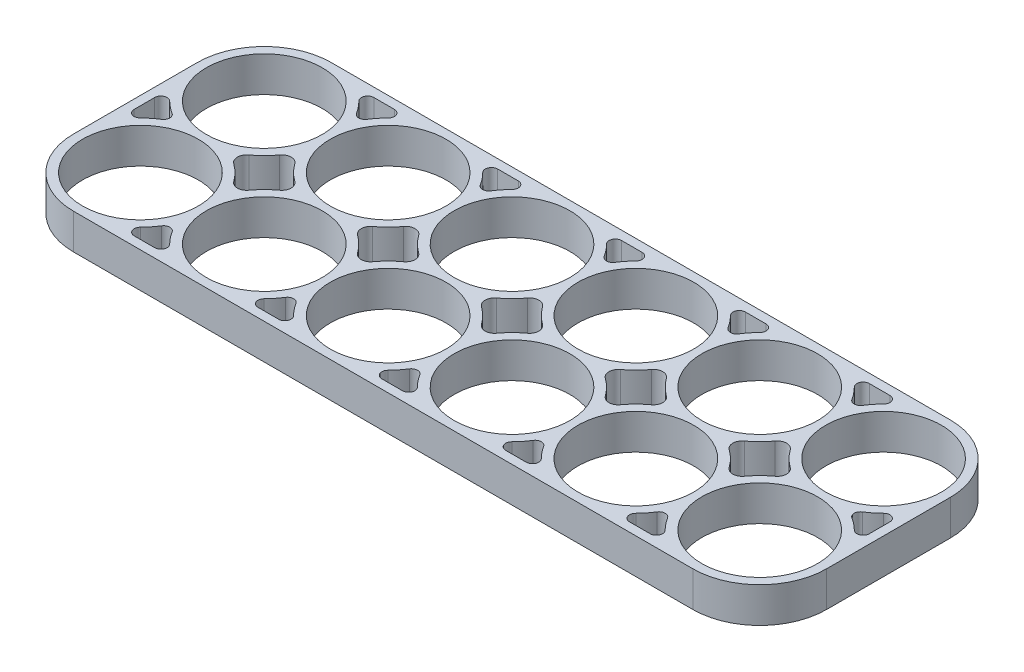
ISO-10303-21;
HEADER;
FILE_DESCRIPTION(('STEP AP214'),'2;1');
FILE_NAME('part.step','',(''),(''),'','','');
FILE_SCHEMA(('AUTOMOTIVE_DESIGN { 1 0 10303 214 1 1 1 1 }'));
ENDSEC;
DATA;
#1=APPLICATION_CONTEXT('core data for automotive mechanical design processes');
#2=APPLICATION_PROTOCOL_DEFINITION('international standard','automotive_design',2000,#1);
#3=PRODUCT_CONTEXT('',#1,'mechanical');
#4=PRODUCT('Part','Part','',(#3));
#5=PRODUCT_RELATED_PRODUCT_CATEGORY('part','',(#4));
#6=PRODUCT_DEFINITION_FORMATION('','',#4);
#7=PRODUCT_DEFINITION_CONTEXT('part definition',#1,'design');
#8=PRODUCT_DEFINITION('design','',#6,#7);
#9=PRODUCT_DEFINITION_SHAPE('','',#8);
#10=(LENGTH_UNIT() NAMED_UNIT(*) SI_UNIT(.MILLI.,.METRE.));
#11=(NAMED_UNIT(*) PLANE_ANGLE_UNIT() SI_UNIT($,.RADIAN.));
#12=(NAMED_UNIT(*) SI_UNIT($,.STERADIAN.) SOLID_ANGLE_UNIT());
#13=UNCERTAINTY_MEASURE_WITH_UNIT(LENGTH_MEASURE(1.E-05),#10,'distance_accuracy_value','');
#14=(GEOMETRIC_REPRESENTATION_CONTEXT(3) GLOBAL_UNCERTAINTY_ASSIGNED_CONTEXT((#13)) GLOBAL_UNIT_ASSIGNED_CONTEXT((#10,
#11,#12)) REPRESENTATION_CONTEXT('',''));
#15=CARTESIAN_POINT('',(0.,0.,0.));
#16=DIRECTION('',(0.,0.,1.));
#17=DIRECTION('',(1.,0.,0.));
#18=AXIS2_PLACEMENT_3D('',#15,#16,#17);
#19=CARTESIAN_POINT('',(-30.,5.7,-10.));
#20=DIRECTION('',(0.,-1.,0.));
#21=DIRECTION('',(0.,0.,-1.));
#22=AXIS2_PLACEMENT_3D('',#19,#20,#21);
#23=CYLINDRICAL_SURFACE('',#22,10.8);
#24=CARTESIAN_POINT('',(-30.,0.,-10.));
#25=DIRECTION('',(0.,1.,0.));
#26=DIRECTION('',(0.,0.,1.));
#27=AXIS2_PLACEMENT_3D('',#24,#25,#26);
#28=CIRCLE('',#27,10.8);
#29=CARTESIAN_POINT('',(-23.711674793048,0.,-1.21951219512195));
#30=VERTEX_POINT('',#29);
#31=CARTESIAN_POINT('',(-21.219512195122,0.,-3.711674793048));
#32=VERTEX_POINT('',#31);
#33=EDGE_CURVE('E1184',#30,#32,#28,.T.);
#34=ORIENTED_EDGE('',*,*,#33,.T.);
#35=DIRECTION('',(0.,-1.,0.));
#36=VECTOR('',#35,1.);
#37=CARTESIAN_POINT('',(-21.219512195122,5.7,-3.711674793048));
#38=LINE('',#37,#36);
#39=CARTESIAN_POINT('',(-21.219512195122,5.7,-3.711674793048));
#40=VERTEX_POINT('',#39);
#41=EDGE_CURVE('E11',#40,#32,#38,.T.);
#42=ORIENTED_EDGE('',*,*,#41,.F.);
#43=CARTESIAN_POINT('',(-30.,5.7,-10.));
#44=DIRECTION('',(0.,1.,0.));
#45=DIRECTION('',(0.,0.,1.));
#46=AXIS2_PLACEMENT_3D('',#43,#44,#45);
#47=CIRCLE('',#46,10.8);
#48=CARTESIAN_POINT('',(-23.711674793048,5.7,-1.21951219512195));
#49=VERTEX_POINT('',#48);
#50=EDGE_CURVE('E1825',#49,#40,#47,.T.);
#51=ORIENTED_EDGE('',*,*,#50,.F.);
#52=DIRECTION('',(0.,-1.,0.));
#53=VECTOR('',#52,1.);
#54=CARTESIAN_POINT('',(-23.711674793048,5.7,-1.21951219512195));
#55=LINE('',#54,#53);
#56=EDGE_CURVE('E1202',#49,#30,#55,.T.);
#57=ORIENTED_EDGE('',*,*,#56,.T.);
#58=EDGE_LOOP('',(#34,#42,#51,#57));
#59=FACE_BOUND('',#58,.T.);
#60=ADVANCED_FACE('F42',(#59),#23,.T.);
#61=CARTESIAN_POINT('',(-20.,5.7,-2.83829629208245));
#62=DIRECTION('',(0.,-1.,0.));
#63=DIRECTION('',(0.,0.,-1.));
#64=AXIS2_PLACEMENT_3D('',#61,#62,#63);
#65=CYLINDRICAL_SURFACE('',#64,1.5);
#66=CARTESIAN_POINT('',(-20.,0.,-2.83829629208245));
#67=DIRECTION('',(0.,1.,0.));
#68=DIRECTION('',(0.,0.,1.));
#69=AXIS2_PLACEMENT_3D('',#66,#67,#68);
#70=CIRCLE('',#69,1.5);
#71=CARTESIAN_POINT('',(-18.780487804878,0.,-3.711674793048));
#72=VERTEX_POINT('',#71);
#73=EDGE_CURVE('E1187',#32,#72,#70,.F.);
#74=ORIENTED_EDGE('',*,*,#73,.T.);
#75=DIRECTION('',(0.,-1.,0.));
#76=VECTOR('',#75,1.);
#77=CARTESIAN_POINT('',(-18.780487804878,5.7,-3.711674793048));
#78=LINE('',#77,#76);
#79=CARTESIAN_POINT('',(-18.780487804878,5.7,-3.711674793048));
#80=VERTEX_POINT('',#79);
#81=EDGE_CURVE('E52',#80,#72,#78,.T.);
#82=ORIENTED_EDGE('',*,*,#81,.F.);
#83=CARTESIAN_POINT('',(-20.,5.7,-2.83829629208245));
#84=DIRECTION('',(0.,1.,0.));
#85=DIRECTION('',(0.,0.,1.));
#86=AXIS2_PLACEMENT_3D('',#83,#84,#85);
#87=CIRCLE('',#86,1.5);
#88=EDGE_CURVE('E1827',#40,#80,#87,.F.);
#89=ORIENTED_EDGE('',*,*,#88,.F.);
#90=ORIENTED_EDGE('',*,*,#41,.T.);
#91=EDGE_LOOP('',(#74,#82,#89,#90));
#92=FACE_BOUND('',#91,.T.);
#93=ADVANCED_FACE('F1854',(#92),#65,.F.);
#94=CARTESIAN_POINT('',(-10.,5.7,-10.));
#95=DIRECTION('',(0.,-1.,0.));
#96=DIRECTION('',(0.,0.,-1.));
#97=AXIS2_PLACEMENT_3D('',#94,#95,#96);
#98=CYLINDRICAL_SURFACE('',#97,10.8);
#99=CARTESIAN_POINT('',(-10.,0.,-10.));
#100=DIRECTION('',(0.,1.,0.));
#101=DIRECTION('',(0.,0.,1.));
#102=AXIS2_PLACEMENT_3D('',#99,#100,#101);
#103=CIRCLE('',#102,10.8);
#104=CARTESIAN_POINT('',(-16.288325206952,0.,-1.21951219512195));
#105=VERTEX_POINT('',#104);
#106=EDGE_CURVE('E1189',#72,#105,#103,.T.);
#107=ORIENTED_EDGE('',*,*,#106,.T.);
#108=DIRECTION('',(0.,-1.,0.));
#109=VECTOR('',#108,1.);
#110=CARTESIAN_POINT('',(-16.288325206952,5.7,-1.21951219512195));
#111=LINE('',#110,#109);
#112=CARTESIAN_POINT('',(-16.288325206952,5.7,-1.21951219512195));
#113=VERTEX_POINT('',#112);
#114=EDGE_CURVE('E1209',#113,#105,#111,.T.);
#115=ORIENTED_EDGE('',*,*,#114,.F.);
#116=CARTESIAN_POINT('',(-10.,5.7,-10.));
#117=DIRECTION('',(0.,1.,0.));
#118=DIRECTION('',(0.,0.,1.));
#119=AXIS2_PLACEMENT_3D('',#116,#117,#118);
#120=CIRCLE('',#119,10.8);
#121=EDGE_CURVE('E1829',#80,#113,#120,.T.);
#122=ORIENTED_EDGE('',*,*,#121,.F.);
#123=ORIENTED_EDGE('',*,*,#81,.T.);
#124=EDGE_LOOP('',(#107,#115,#122,#123));
#125=FACE_BOUND('',#124,.T.);
#126=ADVANCED_FACE('F1838',(#125),#98,.T.);
#127=CARTESIAN_POINT('',(-17.1617037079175,5.7,0.));
#128=DIRECTION('',(0.,-1.,0.));
#129=DIRECTION('',(0.,0.,-1.));
#130=AXIS2_PLACEMENT_3D('',#127,#128,#129);
#131=CYLINDRICAL_SURFACE('',#130,1.5);
#132=CARTESIAN_POINT('',(-17.1617037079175,0.,0.));
#133=DIRECTION('',(0.,1.,0.));
#134=DIRECTION('',(0.,0.,1.));
#135=AXIS2_PLACEMENT_3D('',#132,#133,#134);
#136=CIRCLE('',#135,1.5);
#137=CARTESIAN_POINT('',(-16.288325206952,0.,1.21951219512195));
#138=VERTEX_POINT('',#137);
#139=EDGE_CURVE('E1192',#138,#105,#136,.T.);
#140=ORIENTED_EDGE('',*,*,#139,.F.);
#141=DIRECTION('',(0.,-1.,0.));
#142=VECTOR('',#141,1.);
#143=CARTESIAN_POINT('',(-16.288325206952,5.7,1.21951219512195));
#144=LINE('',#143,#142);
#145=CARTESIAN_POINT('',(-16.288325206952,5.7,1.21951219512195));
#146=VERTEX_POINT('',#145);
#147=EDGE_CURVE('E1207',#146,#138,#144,.T.);
#148=ORIENTED_EDGE('',*,*,#147,.F.);
#149=CARTESIAN_POINT('',(-17.1617037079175,5.7,0.));
#150=DIRECTION('',(0.,1.,0.));
#151=DIRECTION('',(0.,0.,1.));
#152=AXIS2_PLACEMENT_3D('',#149,#150,#151);
#153=CIRCLE('',#152,1.5);
#154=EDGE_CURVE('E810',#146,#113,#153,.T.);
#155=ORIENTED_EDGE('',*,*,#154,.T.);
#156=ORIENTED_EDGE('',*,*,#114,.T.);
#157=EDGE_LOOP('',(#140,#148,#155,#156));
#158=FACE_BOUND('',#157,.T.);
#159=ADVANCED_FACE('F1833',(#158),#131,.F.);
#160=CARTESIAN_POINT('',(-10.,5.7,10.));
#161=DIRECTION('',(0.,-1.,0.));
#162=DIRECTION('',(0.,0.,-1.));
#163=AXIS2_PLACEMENT_3D('',#160,#161,#162);
#164=CYLINDRICAL_SURFACE('',#163,10.8);
#165=CARTESIAN_POINT('',(-10.,0.,10.));
#166=DIRECTION('',(0.,1.,0.));
#167=DIRECTION('',(0.,0.,1.));
#168=AXIS2_PLACEMENT_3D('',#165,#166,#167);
#169=CIRCLE('',#168,10.8);
#170=CARTESIAN_POINT('',(-18.780487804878,0.,3.711674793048));
#171=VERTEX_POINT('',#170);
#172=EDGE_CURVE('E1195',#138,#171,#169,.T.);
#173=ORIENTED_EDGE('',*,*,#172,.T.);
#174=DIRECTION('',(0.,-1.,0.));
#175=VECTOR('',#174,1.);
#176=CARTESIAN_POINT('',(-18.780487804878,5.7,3.711674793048));
#177=LINE('',#176,#175);
#178=CARTESIAN_POINT('',(-18.780487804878,5.7,3.711674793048));
#179=VERTEX_POINT('',#178);
#180=EDGE_CURVE('E798',#179,#171,#177,.T.);
#181=ORIENTED_EDGE('',*,*,#180,.F.);
#182=CARTESIAN_POINT('',(-10.,5.7,10.));
#183=DIRECTION('',(0.,1.,0.));
#184=DIRECTION('',(0.,0.,1.));
#185=AXIS2_PLACEMENT_3D('',#182,#183,#184);
#186=CIRCLE('',#185,10.8);
#187=EDGE_CURVE('E807',#146,#179,#186,.T.);
#188=ORIENTED_EDGE('',*,*,#187,.F.);
#189=ORIENTED_EDGE('',*,*,#147,.T.);
#190=EDGE_LOOP('',(#173,#181,#188,#189));
#191=FACE_BOUND('',#190,.T.);
#192=ADVANCED_FACE('F1844',(#191),#164,.T.);
#193=CARTESIAN_POINT('',(-20.,5.7,2.83829629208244));
#194=DIRECTION('',(0.,-1.,0.));
#195=DIRECTION('',(0.,0.,-1.));
#196=AXIS2_PLACEMENT_3D('',#193,#194,#195);
#197=CYLINDRICAL_SURFACE('',#196,1.5);
#198=CARTESIAN_POINT('',(-20.,0.,2.83829629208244));
#199=DIRECTION('',(0.,1.,0.));
#200=DIRECTION('',(0.,0.,1.));
#201=AXIS2_PLACEMENT_3D('',#198,#199,#200);
#202=CIRCLE('',#201,1.5);
#203=CARTESIAN_POINT('',(-21.219512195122,0.,3.711674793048));
#204=VERTEX_POINT('',#203);
#205=EDGE_CURVE('E797',#204,#171,#202,.T.);
#206=ORIENTED_EDGE('',*,*,#205,.F.);
#207=DIRECTION('',(0.,-1.,0.));
#208=VECTOR('',#207,1.);
#209=CARTESIAN_POINT('',(-21.219512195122,5.7,3.711674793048));
#210=LINE('',#209,#208);
#211=CARTESIAN_POINT('',(-21.219512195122,5.7,3.711674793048));
#212=VERTEX_POINT('',#211);
#213=EDGE_CURVE('E791',#212,#204,#210,.T.);
#214=ORIENTED_EDGE('',*,*,#213,.F.);
#215=CARTESIAN_POINT('',(-20.,5.7,2.83829629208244));
#216=DIRECTION('',(0.,1.,0.));
#217=DIRECTION('',(0.,0.,1.));
#218=AXIS2_PLACEMENT_3D('',#215,#216,#217);
#219=CIRCLE('',#218,1.5);
#220=EDGE_CURVE('E795',#212,#179,#219,.T.);
#221=ORIENTED_EDGE('',*,*,#220,.T.);
#222=ORIENTED_EDGE('',*,*,#180,.T.);
#223=EDGE_LOOP('',(#206,#214,#221,#222));
#224=FACE_BOUND('',#223,.T.);
#225=ADVANCED_FACE('F793',(#224),#197,.F.);
#226=CARTESIAN_POINT('',(-30.,5.7,10.));
#227=DIRECTION('',(0.,-1.,0.));
#228=DIRECTION('',(0.,0.,-1.));
#229=AXIS2_PLACEMENT_3D('',#226,#227,#228);
#230=CYLINDRICAL_SURFACE('',#229,10.8);
#231=CARTESIAN_POINT('',(-30.,0.,10.));
#232=DIRECTION('',(0.,1.,0.));
#233=DIRECTION('',(0.,0.,1.));
#234=AXIS2_PLACEMENT_3D('',#231,#232,#233);
#235=CIRCLE('',#234,10.8);
#236=CARTESIAN_POINT('',(-23.711674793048,0.,1.21951219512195));
#237=VERTEX_POINT('',#236);
#238=EDGE_CURVE('E425',#204,#237,#235,.T.);
#239=ORIENTED_EDGE('',*,*,#238,.T.);
#240=DIRECTION('',(0.,-1.,0.));
#241=VECTOR('',#240,1.);
#242=CARTESIAN_POINT('',(-23.711674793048,5.7,1.21951219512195));
#243=LINE('',#242,#241);
#244=CARTESIAN_POINT('',(-23.711674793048,5.7,1.21951219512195));
#245=VERTEX_POINT('',#244);
#246=EDGE_CURVE('E799',#245,#237,#243,.T.);
#247=ORIENTED_EDGE('',*,*,#246,.F.);
#248=CARTESIAN_POINT('',(-30.,5.7,10.));
#249=DIRECTION('',(0.,1.,0.));
#250=DIRECTION('',(0.,0.,1.));
#251=AXIS2_PLACEMENT_3D('',#248,#249,#250);
#252=CIRCLE('',#251,10.8);
#253=EDGE_CURVE('E801',#212,#245,#252,.T.);
#254=ORIENTED_EDGE('',*,*,#253,.F.);
#255=ORIENTED_EDGE('',*,*,#213,.T.);
#256=EDGE_LOOP('',(#239,#247,#254,#255));
#257=FACE_BOUND('',#256,.T.);
#258=ADVANCED_FACE('F802',(#257),#230,.T.);
#259=CARTESIAN_POINT('',(-30.,5.7,-10.));
#260=DIRECTION('',(0.,-1.,0.));
#261=DIRECTION('',(0.,0.,-1.));
#262=AXIS2_PLACEMENT_3D('',#259,#260,#261);
#263=CYLINDRICAL_SURFACE('',#262,10.8);
#264=CARTESIAN_POINT('',(-30.,0.,-10.));
#265=DIRECTION('',(0.,1.,0.));
#266=DIRECTION('',(0.,0.,1.));
#267=AXIS2_PLACEMENT_3D('',#264,#265,#266);
#268=CIRCLE('',#267,10.8);
#269=CARTESIAN_POINT('',(-20.8474576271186,0.,-15.7333208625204));
#270=VERTEX_POINT('',#269);
#271=CARTESIAN_POINT('',(-22.3688705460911,0.,-17.6423728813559));
#272=VERTEX_POINT('',#271);
#273=EDGE_CURVE('E1167',#270,#272,#268,.T.);
#274=ORIENTED_EDGE('',*,*,#273,.T.);
#275=DIRECTION('',(0.,-1.,0.));
#276=VECTOR('',#275,1.);
#277=CARTESIAN_POINT('',(-22.3688705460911,5.7,-17.6423728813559));
#278=LINE('',#277,#276);
#279=CARTESIAN_POINT('',(-22.3688705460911,5.7,-17.6423728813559));
#280=VERTEX_POINT('',#279);
#281=EDGE_CURVE('E1204',#280,#272,#278,.T.);
#282=ORIENTED_EDGE('',*,*,#281,.F.);
#283=CARTESIAN_POINT('',(-30.,5.7,-10.));
#284=DIRECTION('',(0.,1.,0.));
#285=DIRECTION('',(0.,0.,1.));
#286=AXIS2_PLACEMENT_3D('',#283,#284,#285);
#287=CIRCLE('',#286,10.8);
#288=CARTESIAN_POINT('',(-20.8474576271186,5.7,-15.7333208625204));
#289=VERTEX_POINT('',#288);
#290=EDGE_CURVE('E1810',#289,#280,#287,.T.);
#291=ORIENTED_EDGE('',*,*,#290,.F.);
#292=DIRECTION('',(0.,-1.,0.));
#293=VECTOR('',#292,1.);
#294=CARTESIAN_POINT('',(-20.8474576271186,5.7,-15.7333208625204));
#295=LINE('',#294,#293);
#296=EDGE_CURVE('E1213',#289,#270,#295,.T.);
#297=ORIENTED_EDGE('',*,*,#296,.T.);
#298=EDGE_LOOP('',(#274,#282,#291,#297));
#299=FACE_BOUND('',#298,.T.);
#300=ADVANCED_FACE('F1885',(#299),#263,.T.);
#301=CARTESIAN_POINT('',(-21.662284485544,5.7,-18.35));
#302=DIRECTION('',(0.,-1.,0.));
#303=DIRECTION('',(0.,0.,-1.));
#304=AXIS2_PLACEMENT_3D('',#301,#302,#303);
#305=CYLINDRICAL_SURFACE('',#304,1.);
#306=CARTESIAN_POINT('',(-21.662284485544,0.,-18.35));
#307=DIRECTION('',(0.,1.,0.));
#308=DIRECTION('',(0.,0.,1.));
#309=AXIS2_PLACEMENT_3D('',#306,#307,#308);
#310=CIRCLE('',#309,1.);
#311=CARTESIAN_POINT('',(-21.662284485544,0.,-19.35));
#312=VERTEX_POINT('',#311);
#313=EDGE_CURVE('E1170',#272,#312,#310,.F.);
#314=ORIENTED_EDGE('',*,*,#313,.T.);
#315=DIRECTION('',(0.,-1.,0.));
#316=VECTOR('',#315,1.);
#317=CARTESIAN_POINT('',(-21.662284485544,5.7,-19.35));
#318=LINE('',#317,#316);
#319=CARTESIAN_POINT('',(-21.662284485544,5.7,-19.35));
#320=VERTEX_POINT('',#319);
#321=EDGE_CURVE('E1222',#320,#312,#318,.T.);
#322=ORIENTED_EDGE('',*,*,#321,.F.);
#323=CARTESIAN_POINT('',(-21.662284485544,5.7,-18.35));
#324=DIRECTION('',(0.,1.,0.));
#325=DIRECTION('',(0.,0.,1.));
#326=AXIS2_PLACEMENT_3D('',#323,#324,#325);
#327=CIRCLE('',#326,1.);
#328=EDGE_CURVE('E1813',#280,#320,#327,.F.);
#329=ORIENTED_EDGE('',*,*,#328,.F.);
#330=ORIENTED_EDGE('',*,*,#281,.T.);
#331=EDGE_LOOP('',(#314,#322,#329,#330));
#332=FACE_BOUND('',#331,.T.);
#333=ADVANCED_FACE('F1881',(#332),#305,.F.);
#334=CARTESIAN_POINT('',(0.,5.7,-19.35));
#335=DIRECTION('',(0.,0.,-1.));
#336=DIRECTION('',(-1.,0.,0.));
#337=AXIS2_PLACEMENT_3D('',#334,#335,#336);
#338=PLANE('',#337);
#339=DIRECTION('',(1.,0.,0.));
#340=VECTOR('',#339,1.);
#341=CARTESIAN_POINT('',(0.,0.,-19.35));
#342=LINE('',#341,#340);
#343=CARTESIAN_POINT('',(-18.337715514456,0.,-19.35));
#344=VERTEX_POINT('',#343);
#345=EDGE_CURVE('E1172',#312,#344,#342,.T.);
#346=ORIENTED_EDGE('',*,*,#345,.T.);
#347=DIRECTION('',(0.,-1.,0.));
#348=VECTOR('',#347,1.);
#349=CARTESIAN_POINT('',(-18.337715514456,5.7,-19.35));
#350=LINE('',#349,#348);
#351=CARTESIAN_POINT('',(-18.337715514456,5.7,-19.35));
#352=VERTEX_POINT('',#351);
#353=EDGE_CURVE('E1220',#352,#344,#350,.T.);
#354=ORIENTED_EDGE('',*,*,#353,.F.);
#355=DIRECTION('',(1.,0.,0.));
#356=VECTOR('',#355,1.);
#357=CARTESIAN_POINT('',(0.,5.7,-19.35));
#358=LINE('',#357,#356);
#359=EDGE_CURVE('E1815',#320,#352,#358,.T.);
#360=ORIENTED_EDGE('',*,*,#359,.F.);
#361=ORIENTED_EDGE('',*,*,#321,.T.);
#362=EDGE_LOOP('',(#346,#354,#360,#361));
#363=FACE_BOUND('',#362,.T.);
#364=ADVANCED_FACE('F1877',(#363),#338,.F.);
#365=CARTESIAN_POINT('',(-18.337715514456,5.7,-18.35));
#366=DIRECTION('',(0.,-1.,0.));
#367=DIRECTION('',(0.,0.,-1.));
#368=AXIS2_PLACEMENT_3D('',#365,#366,#367);
#369=CYLINDRICAL_SURFACE('',#368,1.);
#370=CARTESIAN_POINT('',(-18.337715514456,0.,-18.35));
#371=DIRECTION('',(0.,1.,0.));
#372=DIRECTION('',(0.,0.,1.));
#373=AXIS2_PLACEMENT_3D('',#370,#371,#372);
#374=CIRCLE('',#373,1.);
#375=CARTESIAN_POINT('',(-17.6311294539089,0.,-17.6423728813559));
#376=VERTEX_POINT('',#375);
#377=EDGE_CURVE('E1175',#376,#344,#374,.T.);
#378=ORIENTED_EDGE('',*,*,#377,.F.);
#379=DIRECTION('',(0.,-1.,0.));
#380=VECTOR('',#379,1.);
#381=CARTESIAN_POINT('',(-17.6311294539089,5.7,-17.6423728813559));
#382=LINE('',#381,#380);
#383=CARTESIAN_POINT('',(-17.6311294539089,5.7,-17.6423728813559));
#384=VERTEX_POINT('',#383);
#385=EDGE_CURVE('E1218',#384,#376,#382,.T.);
#386=ORIENTED_EDGE('',*,*,#385,.F.);
#387=CARTESIAN_POINT('',(-18.337715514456,5.7,-18.35));
#388=DIRECTION('',(0.,1.,0.));
#389=DIRECTION('',(0.,0.,1.));
#390=AXIS2_PLACEMENT_3D('',#387,#388,#389);
#391=CIRCLE('',#390,1.);
#392=EDGE_CURVE('E1817',#384,#352,#391,.T.);
#393=ORIENTED_EDGE('',*,*,#392,.T.);
#394=ORIENTED_EDGE('',*,*,#353,.T.);
#395=EDGE_LOOP('',(#378,#386,#393,#394));
#396=FACE_BOUND('',#395,.T.);
#397=ADVANCED_FACE('F1873',(#396),#369,.F.);
#398=CARTESIAN_POINT('',(-10.,5.7,-10.));
#399=DIRECTION('',(0.,-1.,0.));
#400=DIRECTION('',(0.,0.,-1.));
#401=AXIS2_PLACEMENT_3D('',#398,#399,#400);
#402=CYLINDRICAL_SURFACE('',#401,10.8);
#403=CARTESIAN_POINT('',(-10.,0.,-10.));
#404=DIRECTION('',(0.,1.,0.));
#405=DIRECTION('',(0.,0.,1.));
#406=AXIS2_PLACEMENT_3D('',#403,#404,#405);
#407=CIRCLE('',#406,10.8);
#408=CARTESIAN_POINT('',(-19.1525423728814,0.,-15.7333208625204));
#409=VERTEX_POINT('',#408);
#410=EDGE_CURVE('E1178',#376,#409,#407,.T.);
#411=ORIENTED_EDGE('',*,*,#410,.T.);
#412=DIRECTION('',(0.,-1.,0.));
#413=VECTOR('',#412,1.);
#414=CARTESIAN_POINT('',(-19.1525423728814,5.7,-15.7333208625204));
#415=LINE('',#414,#413);
#416=CARTESIAN_POINT('',(-19.1525423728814,5.7,-15.7333208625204));
#417=VERTEX_POINT('',#416);
#418=EDGE_CURVE('E1215',#417,#409,#415,.T.);
#419=ORIENTED_EDGE('',*,*,#418,.F.);
#420=CARTESIAN_POINT('',(-10.,5.7,-10.));
#421=DIRECTION('',(0.,1.,0.));
#422=DIRECTION('',(0.,0.,1.));
#423=AXIS2_PLACEMENT_3D('',#420,#421,#422);
#424=CIRCLE('',#423,10.8);
#425=EDGE_CURVE('E1820',#384,#417,#424,.T.);
#426=ORIENTED_EDGE('',*,*,#425,.F.);
#427=ORIENTED_EDGE('',*,*,#385,.T.);
#428=EDGE_LOOP('',(#411,#419,#426,#427));
#429=FACE_BOUND('',#428,.T.);
#430=ADVANCED_FACE('F1869',(#429),#402,.T.);
#431=CARTESIAN_POINT('',(9.99999999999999,5.7,-10.));
#432=DIRECTION('',(0.,-1.,0.));
#433=DIRECTION('',(0.,0.,-1.));
#434=AXIS2_PLACEMENT_3D('',#431,#432,#433);
#435=CYLINDRICAL_SURFACE('',#434,10.8);
#436=CARTESIAN_POINT('',(9.99999999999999,0.,-10.));
#437=DIRECTION('',(0.,1.,0.));
#438=DIRECTION('',(0.,0.,1.));
#439=AXIS2_PLACEMENT_3D('',#436,#437,#438);
#440=CIRCLE('',#439,10.8);
#441=CARTESIAN_POINT('',(19.1525423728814,0.,-15.7333208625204));
#442=VERTEX_POINT('',#441);
#443=CARTESIAN_POINT('',(17.6311294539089,0.,-17.6423728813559));
#444=VERTEX_POINT('',#443);
#445=EDGE_CURVE('E1150',#442,#444,#440,.T.);
#446=ORIENTED_EDGE('',*,*,#445,.T.);
#447=DIRECTION('',(0.,-1.,0.));
#448=VECTOR('',#447,1.);
#449=CARTESIAN_POINT('',(17.6311294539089,5.7,-17.6423728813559));
#450=LINE('',#449,#448);
#451=CARTESIAN_POINT('',(17.6311294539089,5.7,-17.6423728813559));
#452=VERTEX_POINT('',#451);
#453=EDGE_CURVE('E1216',#452,#444,#450,.T.);
#454=ORIENTED_EDGE('',*,*,#453,.F.);
#455=CARTESIAN_POINT('',(9.99999999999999,5.7,-10.));
#456=DIRECTION('',(0.,1.,0.));
#457=DIRECTION('',(0.,0.,1.));
#458=AXIS2_PLACEMENT_3D('',#455,#456,#457);
#459=CIRCLE('',#458,10.8);
#460=CARTESIAN_POINT('',(19.1525423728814,5.7,-15.7333208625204));
#461=VERTEX_POINT('',#460);
#462=EDGE_CURVE('E1795',#461,#452,#459,.T.);
#463=ORIENTED_EDGE('',*,*,#462,.F.);
#464=DIRECTION('',(0.,-1.,0.));
#465=VECTOR('',#464,1.);
#466=CARTESIAN_POINT('',(19.1525423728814,5.7,-15.7333208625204));
#467=LINE('',#466,#465);
#468=EDGE_CURVE('E1227',#461,#442,#467,.T.);
#469=ORIENTED_EDGE('',*,*,#468,.T.);
#470=EDGE_LOOP('',(#446,#454,#463,#469));
#471=FACE_BOUND('',#470,.T.);
#472=ADVANCED_FACE('F1872',(#471),#435,.T.);
#473=CARTESIAN_POINT('',(18.337715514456,5.7,-18.35));
#474=DIRECTION('',(0.,-1.,0.));
#475=DIRECTION('',(0.,0.,-1.));
#476=AXIS2_PLACEMENT_3D('',#473,#474,#475);
#477=CYLINDRICAL_SURFACE('',#476,1.);
#478=CARTESIAN_POINT('',(18.337715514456,0.,-18.35));
#479=DIRECTION('',(0.,1.,0.));
#480=DIRECTION('',(0.,0.,1.));
#481=AXIS2_PLACEMENT_3D('',#478,#479,#480);
#482=CIRCLE('',#481,1.);
#483=CARTESIAN_POINT('',(18.337715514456,0.,-19.35));
#484=VERTEX_POINT('',#483);
#485=EDGE_CURVE('E1153',#444,#484,#482,.F.);
#486=ORIENTED_EDGE('',*,*,#485,.T.);
#487=DIRECTION('',(0.,-1.,0.));
#488=VECTOR('',#487,1.);
#489=CARTESIAN_POINT('',(18.337715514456,5.7,-19.35));
#490=LINE('',#489,#488);
#491=CARTESIAN_POINT('',(18.337715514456,5.7,-19.35));
#492=VERTEX_POINT('',#491);
#493=EDGE_CURVE('E1236',#492,#484,#490,.T.);
#494=ORIENTED_EDGE('',*,*,#493,.F.);
#495=CARTESIAN_POINT('',(18.337715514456,5.7,-18.35));
#496=DIRECTION('',(0.,1.,0.));
#497=DIRECTION('',(0.,0.,1.));
#498=AXIS2_PLACEMENT_3D('',#495,#496,#497);
#499=CIRCLE('',#498,1.);
#500=EDGE_CURVE('E1798',#452,#492,#499,.F.);
#501=ORIENTED_EDGE('',*,*,#500,.F.);
#502=ORIENTED_EDGE('',*,*,#453,.T.);
#503=EDGE_LOOP('',(#486,#494,#501,#502));
#504=FACE_BOUND('',#503,.T.);
#505=ADVANCED_FACE('F1906',(#504),#477,.F.);
#506=CARTESIAN_POINT('',(0.,5.7,-19.35));
#507=DIRECTION('',(0.,0.,-1.));
#508=DIRECTION('',(-1.,0.,0.));
#509=AXIS2_PLACEMENT_3D('',#506,#507,#508);
#510=PLANE('',#509);
#511=DIRECTION('',(1.,0.,0.));
#512=VECTOR('',#511,1.);
#513=CARTESIAN_POINT('',(0.,0.,-19.35));
#514=LINE('',#513,#512);
#515=CARTESIAN_POINT('',(21.662284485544,0.,-19.35));
#516=VERTEX_POINT('',#515);
#517=EDGE_CURVE('E1155',#484,#516,#514,.T.);
#518=ORIENTED_EDGE('',*,*,#517,.T.);
#519=DIRECTION('',(0.,-1.,0.));
#520=VECTOR('',#519,1.);
#521=CARTESIAN_POINT('',(21.662284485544,5.7,-19.35));
#522=LINE('',#521,#520);
#523=CARTESIAN_POINT('',(21.662284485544,5.7,-19.35));
#524=VERTEX_POINT('',#523);
#525=EDGE_CURVE('E1234',#524,#516,#522,.T.);
#526=ORIENTED_EDGE('',*,*,#525,.F.);
#527=DIRECTION('',(1.,0.,0.));
#528=VECTOR('',#527,1.);
#529=CARTESIAN_POINT('',(0.,5.7,-19.35));
#530=LINE('',#529,#528);
#531=EDGE_CURVE('E1800',#492,#524,#530,.T.);
#532=ORIENTED_EDGE('',*,*,#531,.F.);
#533=ORIENTED_EDGE('',*,*,#493,.T.);
#534=EDGE_LOOP('',(#518,#526,#532,#533));
#535=FACE_BOUND('',#534,.T.);
#536=ADVANCED_FACE('F1902',(#535),#510,.F.);
#537=CARTESIAN_POINT('',(21.662284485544,5.7,-18.35));
#538=DIRECTION('',(0.,-1.,0.));
#539=DIRECTION('',(0.,0.,-1.));
#540=AXIS2_PLACEMENT_3D('',#537,#538,#539);
#541=CYLINDRICAL_SURFACE('',#540,1.);
#542=CARTESIAN_POINT('',(21.662284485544,0.,-18.35));
#543=DIRECTION('',(0.,1.,0.));
#544=DIRECTION('',(0.,0.,1.));
#545=AXIS2_PLACEMENT_3D('',#542,#543,#544);
#546=CIRCLE('',#545,1.);
#547=CARTESIAN_POINT('',(22.3688705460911,0.,-17.6423728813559));
#548=VERTEX_POINT('',#547);
#549=EDGE_CURVE('E1158',#548,#516,#546,.T.);
#550=ORIENTED_EDGE('',*,*,#549,.F.);
#551=DIRECTION('',(0.,-1.,0.));
#552=VECTOR('',#551,1.);
#553=CARTESIAN_POINT('',(22.3688705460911,5.7,-17.6423728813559));
#554=LINE('',#553,#552);
#555=CARTESIAN_POINT('',(22.3688705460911,5.7,-17.6423728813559));
#556=VERTEX_POINT('',#555);
#557=EDGE_CURVE('E1232',#556,#548,#554,.T.);
#558=ORIENTED_EDGE('',*,*,#557,.F.);
#559=CARTESIAN_POINT('',(21.662284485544,5.7,-18.35));
#560=DIRECTION('',(0.,1.,0.));
#561=DIRECTION('',(0.,0.,1.));
#562=AXIS2_PLACEMENT_3D('',#559,#560,#561);
#563=CIRCLE('',#562,1.);
#564=EDGE_CURVE('E1802',#556,#524,#563,.T.);
#565=ORIENTED_EDGE('',*,*,#564,.T.);
#566=ORIENTED_EDGE('',*,*,#525,.T.);
#567=EDGE_LOOP('',(#550,#558,#565,#566));
#568=FACE_BOUND('',#567,.T.);
#569=ADVANCED_FACE('F1898',(#568),#541,.F.);
#570=CARTESIAN_POINT('',(30.,5.7,-10.));
#571=DIRECTION('',(0.,-1.,0.));
#572=DIRECTION('',(0.,0.,-1.));
#573=AXIS2_PLACEMENT_3D('',#570,#571,#572);
#574=CYLINDRICAL_SURFACE('',#573,10.8);
#575=CARTESIAN_POINT('',(30.,0.,-10.));
#576=DIRECTION('',(0.,1.,0.));
#577=DIRECTION('',(0.,0.,1.));
#578=AXIS2_PLACEMENT_3D('',#575,#576,#577);
#579=CIRCLE('',#578,10.8);
#580=CARTESIAN_POINT('',(20.8474576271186,0.,-15.7333208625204));
#581=VERTEX_POINT('',#580);
#582=EDGE_CURVE('E1161',#548,#581,#579,.T.);
#583=ORIENTED_EDGE('',*,*,#582,.T.);
#584=DIRECTION('',(0.,-1.,0.));
#585=VECTOR('',#584,1.);
#586=CARTESIAN_POINT('',(20.8474576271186,5.7,-15.7333208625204));
#587=LINE('',#586,#585);
#588=CARTESIAN_POINT('',(20.8474576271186,5.7,-15.7333208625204));
#589=VERTEX_POINT('',#588);
#590=EDGE_CURVE('E1229',#589,#581,#587,.T.);
#591=ORIENTED_EDGE('',*,*,#590,.F.);
#592=CARTESIAN_POINT('',(30.,5.7,-10.));
#593=DIRECTION('',(0.,1.,0.));
#594=DIRECTION('',(0.,0.,1.));
#595=AXIS2_PLACEMENT_3D('',#592,#593,#594);
#596=CIRCLE('',#595,10.8);
#597=EDGE_CURVE('E1805',#556,#589,#596,.T.);
#598=ORIENTED_EDGE('',*,*,#597,.F.);
#599=ORIENTED_EDGE('',*,*,#557,.T.);
#600=EDGE_LOOP('',(#583,#591,#598,#599));
#601=FACE_BOUND('',#600,.T.);
#602=ADVANCED_FACE('F1894',(#601),#574,.T.);
#603=CARTESIAN_POINT('',(30.,5.7,-10.));
#604=DIRECTION('',(0.,-1.,0.));
#605=DIRECTION('',(0.,0.,-1.));
#606=AXIS2_PLACEMENT_3D('',#603,#604,#605);
#607=CYLINDRICAL_SURFACE('',#606,10.8);
#608=CARTESIAN_POINT('',(30.,0.,-10.));
#609=DIRECTION('',(0.,1.,0.));
#610=DIRECTION('',(0.,0.,1.));
#611=AXIS2_PLACEMENT_3D('',#608,#609,#610);
#612=CIRCLE('',#611,10.8);
#613=CARTESIAN_POINT('',(39.1525423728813,0.,-15.7333208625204));
#614=VERTEX_POINT('',#613);
#615=CARTESIAN_POINT('',(37.6311294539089,0.,-17.6423728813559));
#616=VERTEX_POINT('',#615);
#617=EDGE_CURVE('E1133',#614,#616,#612,.T.);
#618=ORIENTED_EDGE('',*,*,#617,.T.);
#619=DIRECTION('',(0.,-1.,0.));
#620=VECTOR('',#619,1.);
#621=CARTESIAN_POINT('',(37.6311294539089,5.7,-17.6423728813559));
#622=LINE('',#621,#620);
#623=CARTESIAN_POINT('',(37.6311294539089,5.7,-17.6423728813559));
#624=VERTEX_POINT('',#623);
#625=EDGE_CURVE('E1230',#624,#616,#622,.T.);
#626=ORIENTED_EDGE('',*,*,#625,.F.);
#627=CARTESIAN_POINT('',(30.,5.7,-10.));
#628=DIRECTION('',(0.,1.,0.));
#629=DIRECTION('',(0.,0.,1.));
#630=AXIS2_PLACEMENT_3D('',#627,#628,#629);
#631=CIRCLE('',#630,10.8);
#632=CARTESIAN_POINT('',(39.1525423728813,5.7,-15.7333208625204));
#633=VERTEX_POINT('',#632);
#634=EDGE_CURVE('E1780',#633,#624,#631,.T.);
#635=ORIENTED_EDGE('',*,*,#634,.F.);
#636=DIRECTION('',(0.,-1.,0.));
#637=VECTOR('',#636,1.);
#638=CARTESIAN_POINT('',(39.1525423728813,5.7,-15.7333208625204));
#639=LINE('',#638,#637);
#640=EDGE_CURVE('E1241',#633,#614,#639,.T.);
#641=ORIENTED_EDGE('',*,*,#640,.T.);
#642=EDGE_LOOP('',(#618,#626,#635,#641));
#643=FACE_BOUND('',#642,.T.);
#644=ADVANCED_FACE('F1897',(#643),#607,.T.);
#645=CARTESIAN_POINT('',(38.337715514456,5.7,-18.35));
#646=DIRECTION('',(0.,-1.,0.));
#647=DIRECTION('',(0.,0.,-1.));
#648=AXIS2_PLACEMENT_3D('',#645,#646,#647);
#649=CYLINDRICAL_SURFACE('',#648,1.);
#650=CARTESIAN_POINT('',(38.337715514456,0.,-18.35));
#651=DIRECTION('',(0.,1.,0.));
#652=DIRECTION('',(0.,0.,1.));
#653=AXIS2_PLACEMENT_3D('',#650,#651,#652);
#654=CIRCLE('',#653,1.);
#655=CARTESIAN_POINT('',(38.337715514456,0.,-19.35));
#656=VERTEX_POINT('',#655);
#657=EDGE_CURVE('E1136',#616,#656,#654,.F.);
#658=ORIENTED_EDGE('',*,*,#657,.T.);
#659=DIRECTION('',(0.,-1.,0.));
#660=VECTOR('',#659,1.);
#661=CARTESIAN_POINT('',(38.337715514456,5.7,-19.35));
#662=LINE('',#661,#660);
#663=CARTESIAN_POINT('',(38.337715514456,5.7,-19.35));
#664=VERTEX_POINT('',#663);
#665=EDGE_CURVE('E1250',#664,#656,#662,.T.);
#666=ORIENTED_EDGE('',*,*,#665,.F.);
#667=CARTESIAN_POINT('',(38.337715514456,5.7,-18.35));
#668=DIRECTION('',(0.,1.,0.));
#669=DIRECTION('',(0.,0.,1.));
#670=AXIS2_PLACEMENT_3D('',#667,#668,#669);
#671=CIRCLE('',#670,1.);
#672=EDGE_CURVE('E1783',#624,#664,#671,.F.);
#673=ORIENTED_EDGE('',*,*,#672,.F.);
#674=ORIENTED_EDGE('',*,*,#625,.T.);
#675=EDGE_LOOP('',(#658,#666,#673,#674));
#676=FACE_BOUND('',#675,.T.);
#677=ADVANCED_FACE('F1930',(#676),#649,.F.);
#678=CARTESIAN_POINT('',(0.,5.7,-19.35));
#679=DIRECTION('',(0.,0.,-1.));
#680=DIRECTION('',(-1.,0.,0.));
#681=AXIS2_PLACEMENT_3D('',#678,#679,#680);
#682=PLANE('',#681);
#683=DIRECTION('',(1.,0.,0.));
#684=VECTOR('',#683,1.);
#685=CARTESIAN_POINT('',(0.,0.,-19.35));
#686=LINE('',#685,#684);
#687=CARTESIAN_POINT('',(41.662284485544,0.,-19.35));
#688=VERTEX_POINT('',#687);
#689=EDGE_CURVE('E1138',#656,#688,#686,.T.);
#690=ORIENTED_EDGE('',*,*,#689,.T.);
#691=DIRECTION('',(0.,-1.,0.));
#692=VECTOR('',#691,1.);
#693=CARTESIAN_POINT('',(41.662284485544,5.7,-19.35));
#694=LINE('',#693,#692);
#695=CARTESIAN_POINT('',(41.662284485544,5.7,-19.35));
#696=VERTEX_POINT('',#695);
#697=EDGE_CURVE('E1248',#696,#688,#694,.T.);
#698=ORIENTED_EDGE('',*,*,#697,.F.);
#699=DIRECTION('',(1.,0.,0.));
#700=VECTOR('',#699,1.);
#701=CARTESIAN_POINT('',(0.,5.7,-19.35));
#702=LINE('',#701,#700);
#703=EDGE_CURVE('E1785',#664,#696,#702,.T.);
#704=ORIENTED_EDGE('',*,*,#703,.F.);
#705=ORIENTED_EDGE('',*,*,#665,.T.);
#706=EDGE_LOOP('',(#690,#698,#704,#705));
#707=FACE_BOUND('',#706,.T.);
#708=ADVANCED_FACE('F1926',(#707),#682,.F.);
#709=CARTESIAN_POINT('',(41.662284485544,5.7,-18.35));
#710=DIRECTION('',(0.,-1.,0.));
#711=DIRECTION('',(0.,0.,-1.));
#712=AXIS2_PLACEMENT_3D('',#709,#710,#711);
#713=CYLINDRICAL_SURFACE('',#712,1.);
#714=CARTESIAN_POINT('',(41.662284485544,0.,-18.35));
#715=DIRECTION('',(0.,1.,0.));
#716=DIRECTION('',(0.,0.,1.));
#717=AXIS2_PLACEMENT_3D('',#714,#715,#716);
#718=CIRCLE('',#717,1.);
#719=CARTESIAN_POINT('',(42.3688705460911,0.,-17.6423728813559));
#720=VERTEX_POINT('',#719);
#721=EDGE_CURVE('E1141',#720,#688,#718,.T.);
#722=ORIENTED_EDGE('',*,*,#721,.F.);
#723=DIRECTION('',(0.,-1.,0.));
#724=VECTOR('',#723,1.);
#725=CARTESIAN_POINT('',(42.3688705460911,5.7,-17.6423728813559));
#726=LINE('',#725,#724);
#727=CARTESIAN_POINT('',(42.3688705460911,5.7,-17.6423728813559));
#728=VERTEX_POINT('',#727);
#729=EDGE_CURVE('E1246',#728,#720,#726,.T.);
#730=ORIENTED_EDGE('',*,*,#729,.F.);
#731=CARTESIAN_POINT('',(41.662284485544,5.7,-18.35));
#732=DIRECTION('',(0.,1.,0.));
#733=DIRECTION('',(0.,0.,1.));
#734=AXIS2_PLACEMENT_3D('',#731,#732,#733);
#735=CIRCLE('',#734,1.);
#736=EDGE_CURVE('E1787',#728,#696,#735,.T.);
#737=ORIENTED_EDGE('',*,*,#736,.T.);
#738=ORIENTED_EDGE('',*,*,#697,.T.);
#739=EDGE_LOOP('',(#722,#730,#737,#738));
#740=FACE_BOUND('',#739,.T.);
#741=ADVANCED_FACE('F1922',(#740),#713,.F.);
#742=CARTESIAN_POINT('',(50.,5.7,-10.));
#743=DIRECTION('',(0.,-1.,0.));
#744=DIRECTION('',(0.,0.,-1.));
#745=AXIS2_PLACEMENT_3D('',#742,#743,#744);
#746=CYLINDRICAL_SURFACE('',#745,10.8);
#747=CARTESIAN_POINT('',(50.,0.,-10.));
#748=DIRECTION('',(0.,1.,0.));
#749=DIRECTION('',(0.,0.,1.));
#750=AXIS2_PLACEMENT_3D('',#747,#748,#749);
#751=CIRCLE('',#750,10.8);
#752=CARTESIAN_POINT('',(40.8474576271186,0.,-15.7333208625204));
#753=VERTEX_POINT('',#752);
#754=EDGE_CURVE('E1144',#720,#753,#751,.T.);
#755=ORIENTED_EDGE('',*,*,#754,.T.);
#756=DIRECTION('',(0.,-1.,0.));
#757=VECTOR('',#756,1.);
#758=CARTESIAN_POINT('',(40.8474576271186,5.7,-15.7333208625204));
#759=LINE('',#758,#757);
#760=CARTESIAN_POINT('',(40.8474576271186,5.7,-15.7333208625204));
#761=VERTEX_POINT('',#760);
#762=EDGE_CURVE('E1243',#761,#753,#759,.T.);
#763=ORIENTED_EDGE('',*,*,#762,.F.);
#764=CARTESIAN_POINT('',(50.,5.7,-10.));
#765=DIRECTION('',(0.,1.,0.));
#766=DIRECTION('',(0.,0.,1.));
#767=AXIS2_PLACEMENT_3D('',#764,#765,#766);
#768=CIRCLE('',#767,10.8);
#769=EDGE_CURVE('E1790',#728,#761,#768,.T.);
#770=ORIENTED_EDGE('',*,*,#769,.F.);
#771=ORIENTED_EDGE('',*,*,#729,.T.);
#772=EDGE_LOOP('',(#755,#763,#770,#771));
#773=FACE_BOUND('',#772,.T.);
#774=ADVANCED_FACE('F1918',(#773),#746,.T.);
#775=CARTESIAN_POINT('',(0.,5.7,19.35));
#776=DIRECTION('',(0.,0.,-1.));
#777=DIRECTION('',(-1.,0.,0.));
#778=AXIS2_PLACEMENT_3D('',#775,#776,#777);
#779=PLANE('',#778);
#780=DIRECTION('',(1.,0.,0.));
#781=VECTOR('',#780,1.);
#782=CARTESIAN_POINT('',(0.,0.,19.35));
#783=LINE('',#782,#781);
#784=CARTESIAN_POINT('',(-21.662284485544,0.,19.35));
#785=VERTEX_POINT('',#784);
#786=CARTESIAN_POINT('',(-18.337715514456,0.,19.35));
#787=VERTEX_POINT('',#786);
#788=EDGE_CURVE('E1115',#785,#787,#783,.T.);
#789=ORIENTED_EDGE('',*,*,#788,.F.);
#790=DIRECTION('',(0.,-1.,0.));
#791=VECTOR('',#790,1.);
#792=CARTESIAN_POINT('',(-21.662284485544,5.7,19.35));
#793=LINE('',#792,#791);
#794=CARTESIAN_POINT('',(-21.662284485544,5.7,19.35));
#795=VERTEX_POINT('',#794);
#796=EDGE_CURVE('E1244',#795,#785,#793,.T.);
#797=ORIENTED_EDGE('',*,*,#796,.F.);
#798=DIRECTION('',(1.,0.,0.));
#799=VECTOR('',#798,1.);
#800=CARTESIAN_POINT('',(0.,5.7,19.35));
#801=LINE('',#800,#799);
#802=CARTESIAN_POINT('',(-18.337715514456,5.7,19.35));
#803=VERTEX_POINT('',#802);
#804=EDGE_CURVE('E1764',#795,#803,#801,.T.);
#805=ORIENTED_EDGE('',*,*,#804,.T.);
#806=DIRECTION('',(0.,-1.,0.));
#807=VECTOR('',#806,1.);
#808=CARTESIAN_POINT('',(-18.337715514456,5.7,19.35));
#809=LINE('',#808,#807);
#810=EDGE_CURVE('E1255',#803,#787,#809,.T.);
#811=ORIENTED_EDGE('',*,*,#810,.T.);
#812=EDGE_LOOP('',(#789,#797,#805,#811));
#813=FACE_BOUND('',#812,.T.);
#814=ADVANCED_FACE('F1921',(#813),#779,.T.);
#815=CARTESIAN_POINT('',(-21.662284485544,5.7,18.35));
#816=DIRECTION('',(0.,-1.,0.));
#817=DIRECTION('',(0.,0.,-1.));
#818=AXIS2_PLACEMENT_3D('',#815,#816,#817);
#819=CYLINDRICAL_SURFACE('',#818,1.);
#820=CARTESIAN_POINT('',(-21.662284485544,0.,18.35));
#821=DIRECTION('',(0.,1.,0.));
#822=DIRECTION('',(0.,0.,1.));
#823=AXIS2_PLACEMENT_3D('',#820,#821,#822);
#824=CIRCLE('',#823,1.);
#825=CARTESIAN_POINT('',(-22.3688705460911,0.,17.6423728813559));
#826=VERTEX_POINT('',#825);
#827=EDGE_CURVE('E1118',#785,#826,#824,.F.);
#828=ORIENTED_EDGE('',*,*,#827,.T.);
#829=DIRECTION('',(0.,-1.,0.));
#830=VECTOR('',#829,1.);
#831=CARTESIAN_POINT('',(-22.3688705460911,5.7,17.6423728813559));
#832=LINE('',#831,#830);
#833=CARTESIAN_POINT('',(-22.3688705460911,5.7,17.6423728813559));
#834=VERTEX_POINT('',#833);
#835=EDGE_CURVE('E1264',#834,#826,#832,.T.);
#836=ORIENTED_EDGE('',*,*,#835,.F.);
#837=CARTESIAN_POINT('',(-21.662284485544,5.7,18.35));
#838=DIRECTION('',(0.,1.,0.));
#839=DIRECTION('',(0.,0.,1.));
#840=AXIS2_PLACEMENT_3D('',#837,#838,#839);
#841=CIRCLE('',#840,1.);
#842=EDGE_CURVE('E1767',#795,#834,#841,.F.);
#843=ORIENTED_EDGE('',*,*,#842,.F.);
#844=ORIENTED_EDGE('',*,*,#796,.T.);
#845=EDGE_LOOP('',(#828,#836,#843,#844));
#846=FACE_BOUND('',#845,.T.);
#847=ADVANCED_FACE('F1954',(#846),#819,.F.);
#848=CARTESIAN_POINT('',(-30.,5.7,10.));
#849=DIRECTION('',(0.,-1.,0.));
#850=DIRECTION('',(0.,0.,-1.));
#851=AXIS2_PLACEMENT_3D('',#848,#849,#850);
#852=CYLINDRICAL_SURFACE('',#851,10.8);
#853=CARTESIAN_POINT('',(-30.,0.,10.));
#854=DIRECTION('',(0.,1.,0.));
#855=DIRECTION('',(0.,0.,1.));
#856=AXIS2_PLACEMENT_3D('',#853,#854,#855);
#857=CIRCLE('',#856,10.8);
#858=CARTESIAN_POINT('',(-20.8474576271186,0.,15.7333208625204));
#859=VERTEX_POINT('',#858);
#860=EDGE_CURVE('E1121',#826,#859,#857,.T.);
#861=ORIENTED_EDGE('',*,*,#860,.T.);
#862=DIRECTION('',(0.,-1.,0.));
#863=VECTOR('',#862,1.);
#864=CARTESIAN_POINT('',(-20.8474576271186,5.7,15.7333208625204));
#865=LINE('',#864,#863);
#866=CARTESIAN_POINT('',(-20.8474576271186,5.7,15.7333208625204));
#867=VERTEX_POINT('',#866);
#868=EDGE_CURVE('E1262',#867,#859,#865,.T.);
#869=ORIENTED_EDGE('',*,*,#868,.F.);
#870=CARTESIAN_POINT('',(-30.,5.7,10.));
#871=DIRECTION('',(0.,1.,0.));
#872=DIRECTION('',(0.,0.,1.));
#873=AXIS2_PLACEMENT_3D('',#870,#871,#872);
#874=CIRCLE('',#873,10.8);
#875=EDGE_CURVE('E1770',#834,#867,#874,.T.);
#876=ORIENTED_EDGE('',*,*,#875,.F.);
#877=ORIENTED_EDGE('',*,*,#835,.T.);
#878=EDGE_LOOP('',(#861,#869,#876,#877));
#879=FACE_BOUND('',#878,.T.);
#880=ADVANCED_FACE('F1950',(#879),#852,.T.);
#881=CARTESIAN_POINT('',(-20.,5.7,16.2641839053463));
#882=DIRECTION('',(0.,-1.,0.));
#883=DIRECTION('',(0.,0.,-1.));
#884=AXIS2_PLACEMENT_3D('',#881,#882,#883);
#885=CYLINDRICAL_SURFACE('',#884,1.);
#886=CARTESIAN_POINT('',(-20.,0.,16.2641839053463));
#887=DIRECTION('',(0.,1.,0.));
#888=DIRECTION('',(0.,0.,1.));
#889=AXIS2_PLACEMENT_3D('',#886,#887,#888);
#890=CIRCLE('',#889,1.);
#891=CARTESIAN_POINT('',(-19.1525423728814,0.,15.7333208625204));
#892=VERTEX_POINT('',#891);
#893=EDGE_CURVE('E1124',#892,#859,#890,.T.);
#894=ORIENTED_EDGE('',*,*,#893,.F.);
#895=DIRECTION('',(0.,-1.,0.));
#896=VECTOR('',#895,1.);
#897=CARTESIAN_POINT('',(-19.1525423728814,5.7,15.7333208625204));
#898=LINE('',#897,#896);
#899=CARTESIAN_POINT('',(-19.1525423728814,5.7,15.7333208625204));
#900=VERTEX_POINT('',#899);
#901=EDGE_CURVE('E1260',#900,#892,#898,.T.);
#902=ORIENTED_EDGE('',*,*,#901,.F.);
#903=CARTESIAN_POINT('',(-20.,5.7,16.2641839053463));
#904=DIRECTION('',(0.,1.,0.));
#905=DIRECTION('',(0.,0.,1.));
#906=AXIS2_PLACEMENT_3D('',#903,#904,#905);
#907=CIRCLE('',#906,1.);
#908=EDGE_CURVE('E1772',#900,#867,#907,.T.);
#909=ORIENTED_EDGE('',*,*,#908,.T.);
#910=ORIENTED_EDGE('',*,*,#868,.T.);
#911=EDGE_LOOP('',(#894,#902,#909,#910));
#912=FACE_BOUND('',#911,.T.);
#913=ADVANCED_FACE('F1946',(#912),#885,.F.);
#914=CARTESIAN_POINT('',(-10.,5.7,10.));
#915=DIRECTION('',(0.,-1.,0.));
#916=DIRECTION('',(0.,0.,-1.));
#917=AXIS2_PLACEMENT_3D('',#914,#915,#916);
#918=CYLINDRICAL_SURFACE('',#917,10.8);
#919=CARTESIAN_POINT('',(-10.,0.,10.));
#920=DIRECTION('',(0.,1.,0.));
#921=DIRECTION('',(0.,0.,1.));
#922=AXIS2_PLACEMENT_3D('',#919,#920,#921);
#923=CIRCLE('',#922,10.8);
#924=CARTESIAN_POINT('',(-17.6311294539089,0.,17.6423728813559));
#925=VERTEX_POINT('',#924);
#926=EDGE_CURVE('E1127',#892,#925,#923,.T.);
#927=ORIENTED_EDGE('',*,*,#926,.T.);
#928=DIRECTION('',(0.,-1.,0.));
#929=VECTOR('',#928,1.);
#930=CARTESIAN_POINT('',(-17.6311294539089,5.7,17.6423728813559));
#931=LINE('',#930,#929);
#932=CARTESIAN_POINT('',(-17.6311294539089,5.7,17.6423728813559));
#933=VERTEX_POINT('',#932);
#934=EDGE_CURVE('E1257',#933,#925,#931,.T.);
#935=ORIENTED_EDGE('',*,*,#934,.F.);
#936=CARTESIAN_POINT('',(-10.,5.7,10.));
#937=DIRECTION('',(0.,1.,0.));
#938=DIRECTION('',(0.,0.,1.));
#939=AXIS2_PLACEMENT_3D('',#936,#937,#938);
#940=CIRCLE('',#939,10.8);
#941=EDGE_CURVE('E1775',#900,#933,#940,.T.);
#942=ORIENTED_EDGE('',*,*,#941,.F.);
#943=ORIENTED_EDGE('',*,*,#901,.T.);
#944=EDGE_LOOP('',(#927,#935,#942,#943));
#945=FACE_BOUND('',#944,.T.);
#946=ADVANCED_FACE('F1942',(#945),#918,.T.);
#947=CARTESIAN_POINT('',(50.,5.7,10.));
#948=DIRECTION('',(0.,-1.,0.));
#949=DIRECTION('',(0.,0.,-1.));
#950=AXIS2_PLACEMENT_3D('',#947,#948,#949);
#951=CYLINDRICAL_SURFACE('',#950,10.8);
#952=CARTESIAN_POINT('',(50.,0.,10.));
#953=DIRECTION('',(0.,1.,0.));
#954=DIRECTION('',(0.,0.,1.));
#955=AXIS2_PLACEMENT_3D('',#952,#953,#954);
#956=CIRCLE('',#955,10.8);
#957=CARTESIAN_POINT('',(57.6423728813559,0.,2.36887054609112));
#958=VERTEX_POINT('',#957);
#959=CARTESIAN_POINT('',(55.7333208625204,0.,0.847457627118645));
#960=VERTEX_POINT('',#959);
#961=EDGE_CURVE('E1098',#958,#960,#956,.T.);
#962=ORIENTED_EDGE('',*,*,#961,.T.);
#963=DIRECTION('',(0.,-1.,0.));
#964=VECTOR('',#963,1.);
#965=CARTESIAN_POINT('',(55.7333208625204,5.7,0.847457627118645));
#966=LINE('',#965,#964);
#967=CARTESIAN_POINT('',(55.7333208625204,5.7,0.847457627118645));
#968=VERTEX_POINT('',#967);
#969=EDGE_CURVE('E1258',#968,#960,#966,.T.);
#970=ORIENTED_EDGE('',*,*,#969,.F.);
#971=CARTESIAN_POINT('',(50.,5.7,10.));
#972=DIRECTION('',(0.,1.,0.));
#973=DIRECTION('',(0.,0.,1.));
#974=AXIS2_PLACEMENT_3D('',#971,#972,#973);
#975=CIRCLE('',#974,10.8);
#976=CARTESIAN_POINT('',(57.6423728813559,5.7,2.36887054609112));
#977=VERTEX_POINT('',#976);
#978=EDGE_CURVE('E1748',#977,#968,#975,.T.);
#979=ORIENTED_EDGE('',*,*,#978,.F.);
#980=DIRECTION('',(0.,-1.,0.));
#981=VECTOR('',#980,1.);
#982=CARTESIAN_POINT('',(57.6423728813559,5.7,2.36887054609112));
#983=LINE('',#982,#981);
#984=EDGE_CURVE('E1268',#977,#958,#983,.T.);
#985=ORIENTED_EDGE('',*,*,#984,.T.);
#986=EDGE_LOOP('',(#962,#970,#979,#985));
#987=FACE_BOUND('',#986,.T.);
#988=ADVANCED_FACE('F1945',(#987),#951,.T.);
#989=CARTESIAN_POINT('',(56.2641839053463,5.7,0.));
#990=DIRECTION('',(0.,-1.,0.));
#991=DIRECTION('',(0.,0.,-1.));
#992=AXIS2_PLACEMENT_3D('',#989,#990,#991);
#993=CYLINDRICAL_SURFACE('',#992,0.999999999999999);
#994=CARTESIAN_POINT('',(56.2641839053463,0.,0.));
#995=DIRECTION('',(0.,1.,0.));
#996=DIRECTION('',(0.,0.,1.));
#997=AXIS2_PLACEMENT_3D('',#994,#995,#996);
#998=CIRCLE('',#997,0.999999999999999);
#999=CARTESIAN_POINT('',(55.7333208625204,0.,-0.847457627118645));
#1000=VERTEX_POINT('',#999);
#1001=EDGE_CURVE('E1101',#960,#1000,#998,.F.);
#1002=ORIENTED_EDGE('',*,*,#1001,.T.);
#1003=DIRECTION('',(0.,-1.,0.));
#1004=VECTOR('',#1003,1.);
#1005=CARTESIAN_POINT('',(55.7333208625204,5.7,-0.847457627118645));
#1006=LINE('',#1005,#1004);
#1007=CARTESIAN_POINT('',(55.7333208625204,5.7,-0.847457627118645));
#1008=VERTEX_POINT('',#1007);
#1009=EDGE_CURVE('E1277',#1008,#1000,#1006,.T.);
#1010=ORIENTED_EDGE('',*,*,#1009,.F.);
#1011=CARTESIAN_POINT('',(56.2641839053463,5.7,0.));
#1012=DIRECTION('',(0.,1.,0.));
#1013=DIRECTION('',(0.,0.,1.));
#1014=AXIS2_PLACEMENT_3D('',#1011,#1012,#1013);
#1015=CIRCLE('',#1014,0.999999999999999);
#1016=EDGE_CURVE('E1751',#968,#1008,#1015,.F.);
#1017=ORIENTED_EDGE('',*,*,#1016,.F.);
#1018=ORIENTED_EDGE('',*,*,#969,.T.);
#1019=EDGE_LOOP('',(#1002,#1010,#1017,#1018));
#1020=FACE_BOUND('',#1019,.T.);
#1021=ADVANCED_FACE('F1978',(#1020),#993,.F.);
#1022=CARTESIAN_POINT('',(50.,5.7,-10.));
#1023=DIRECTION('',(0.,-1.,0.));
#1024=DIRECTION('',(0.,0.,-1.));
#1025=AXIS2_PLACEMENT_3D('',#1022,#1023,#1024);
#1026=CYLINDRICAL_SURFACE('',#1025,10.8);
#1027=CARTESIAN_POINT('',(50.,0.,-10.));
#1028=DIRECTION('',(0.,1.,0.));
#1029=DIRECTION('',(0.,0.,1.));
#1030=AXIS2_PLACEMENT_3D('',#1027,#1028,#1029);
#1031=CIRCLE('',#1030,10.8);
#1032=CARTESIAN_POINT('',(57.6423728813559,0.,-2.36887054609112));
#1033=VERTEX_POINT('',#1032);
#1034=EDGE_CURVE('E1103',#1000,#1033,#1031,.T.);
#1035=ORIENTED_EDGE('',*,*,#1034,.T.);
#1036=DIRECTION('',(0.,-1.,0.));
#1037=VECTOR('',#1036,1.);
#1038=CARTESIAN_POINT('',(57.6423728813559,5.7,-2.36887054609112));
#1039=LINE('',#1038,#1037);
#1040=CARTESIAN_POINT('',(57.6423728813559,5.7,-2.36887054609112));
#1041=VERTEX_POINT('',#1040);
#1042=EDGE_CURVE('E1275',#1041,#1033,#1039,.T.);
#1043=ORIENTED_EDGE('',*,*,#1042,.F.);
#1044=CARTESIAN_POINT('',(50.,5.7,-10.));
#1045=DIRECTION('',(0.,1.,0.));
#1046=DIRECTION('',(0.,0.,1.));
#1047=AXIS2_PLACEMENT_3D('',#1044,#1045,#1046);
#1048=CIRCLE('',#1047,10.8);
#1049=EDGE_CURVE('E1753',#1008,#1041,#1048,.T.);
#1050=ORIENTED_EDGE('',*,*,#1049,.F.);
#1051=ORIENTED_EDGE('',*,*,#1009,.T.);
#1052=EDGE_LOOP('',(#1035,#1043,#1050,#1051));
#1053=FACE_BOUND('',#1052,.T.);
#1054=ADVANCED_FACE('F1974',(#1053),#1026,.T.);
#1055=CARTESIAN_POINT('',(58.35,5.7,-1.662284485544));
#1056=DIRECTION('',(0.,-1.,0.));
#1057=DIRECTION('',(0.,0.,-1.));
#1058=AXIS2_PLACEMENT_3D('',#1055,#1056,#1057);
#1059=CYLINDRICAL_SURFACE('',#1058,1.);
#1060=CARTESIAN_POINT('',(58.35,0.,-1.662284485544));
#1061=DIRECTION('',(0.,1.,0.));
#1062=DIRECTION('',(0.,0.,1.));
#1063=AXIS2_PLACEMENT_3D('',#1060,#1061,#1062);
#1064=CIRCLE('',#1063,1.);
#1065=CARTESIAN_POINT('',(59.35,0.,-1.662284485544));
#1066=VERTEX_POINT('',#1065);
#1067=EDGE_CURVE('E1106',#1066,#1033,#1064,.T.);
#1068=ORIENTED_EDGE('',*,*,#1067,.F.);
#1069=DIRECTION('',(0.,-1.,0.));
#1070=VECTOR('',#1069,1.);
#1071=CARTESIAN_POINT('',(59.35,5.7,-1.662284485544));
#1072=LINE('',#1071,#1070);
#1073=CARTESIAN_POINT('',(59.35,5.7,-1.662284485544));
#1074=VERTEX_POINT('',#1073);
#1075=EDGE_CURVE('E1273',#1074,#1066,#1072,.T.);
#1076=ORIENTED_EDGE('',*,*,#1075,.F.);
#1077=CARTESIAN_POINT('',(58.35,5.7,-1.662284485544));
#1078=DIRECTION('',(0.,1.,0.));
#1079=DIRECTION('',(0.,0.,1.));
#1080=AXIS2_PLACEMENT_3D('',#1077,#1078,#1079);
#1081=CIRCLE('',#1080,1.);
#1082=EDGE_CURVE('E1755',#1074,#1041,#1081,.T.);
#1083=ORIENTED_EDGE('',*,*,#1082,.T.);
#1084=ORIENTED_EDGE('',*,*,#1042,.T.);
#1085=EDGE_LOOP('',(#1068,#1076,#1083,#1084));
#1086=FACE_BOUND('',#1085,.T.);
#1087=ADVANCED_FACE('F1970',(#1086),#1059,.F.);
#1088=CARTESIAN_POINT('',(59.35,5.7,0.));
#1089=DIRECTION('',(-1.,0.,0.));
#1090=DIRECTION('',(0.,0.,1.));
#1091=AXIS2_PLACEMENT_3D('',#1088,#1089,#1090);
#1092=PLANE('',#1091);
#1093=DIRECTION('',(0.,0.,-1.));
#1094=VECTOR('',#1093,1.);
#1095=CARTESIAN_POINT('',(59.35,0.,0.));
#1096=LINE('',#1095,#1094);
#1097=CARTESIAN_POINT('',(59.35,0.,1.66228448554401));
#1098=VERTEX_POINT('',#1097);
#1099=EDGE_CURVE('E1109',#1098,#1066,#1096,.T.);
#1100=ORIENTED_EDGE('',*,*,#1099,.F.);
#1101=DIRECTION('',(0.,-1.,0.));
#1102=VECTOR('',#1101,1.);
#1103=CARTESIAN_POINT('',(59.35,5.7,1.66228448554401));
#1104=LINE('',#1103,#1102);
#1105=CARTESIAN_POINT('',(59.35,5.7,1.66228448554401));
#1106=VERTEX_POINT('',#1105);
#1107=EDGE_CURVE('E1270',#1106,#1098,#1104,.T.);
#1108=ORIENTED_EDGE('',*,*,#1107,.F.);
#1109=DIRECTION('',(0.,0.,-1.));
#1110=VECTOR('',#1109,1.);
#1111=CARTESIAN_POINT('',(59.35,5.7,0.));
#1112=LINE('',#1111,#1110);
#1113=EDGE_CURVE('E1758',#1106,#1074,#1112,.T.);
#1114=ORIENTED_EDGE('',*,*,#1113,.T.);
#1115=ORIENTED_EDGE('',*,*,#1075,.T.);
#1116=EDGE_LOOP('',(#1100,#1108,#1114,#1115));
#1117=FACE_BOUND('',#1116,.T.);
#1118=ADVANCED_FACE('F1966',(#1117),#1092,.T.);
#1119=CARTESIAN_POINT('',(0.,5.7,-20.8));
#1120=DIRECTION('',(0.,0.,-1.));
#1121=DIRECTION('',(-1.,0.,0.));
#1122=AXIS2_PLACEMENT_3D('',#1119,#1120,#1121);
#1123=PLANE('',#1122);
#1124=DIRECTION('',(1.,0.,0.));
#1125=VECTOR('',#1124,1.);
#1126=CARTESIAN_POINT('',(0.,0.,-20.8));
#1127=LINE('',#1126,#1125);
#1128=CARTESIAN_POINT('',(-50.,0.,-20.8));
#1129=VERTEX_POINT('',#1128);
#1130=CARTESIAN_POINT('',(50.,0.,-20.8));
#1131=VERTEX_POINT('',#1130);
#1132=EDGE_CURVE('E1074',#1129,#1131,#1127,.T.);
#1133=ORIENTED_EDGE('',*,*,#1132,.F.);
#1134=DIRECTION('',(0.,-1.,0.));
#1135=VECTOR('',#1134,1.);
#1136=CARTESIAN_POINT('',(-50.,5.7,-20.8));
#1137=LINE('',#1136,#1135);
#1138=CARTESIAN_POINT('',(-50.,5.7,-20.8));
#1139=VERTEX_POINT('',#1138);
#1140=EDGE_CURVE('E1271',#1139,#1129,#1137,.T.);
#1141=ORIENTED_EDGE('',*,*,#1140,.F.);
#1142=DIRECTION('',(1.,0.,0.));
#1143=VECTOR('',#1142,1.);
#1144=CARTESIAN_POINT('',(0.,5.7,-20.8));
#1145=LINE('',#1144,#1143);
#1146=CARTESIAN_POINT('',(50.,5.7,-20.8));
#1147=VERTEX_POINT('',#1146);
#1148=EDGE_CURVE('E1726',#1139,#1147,#1145,.T.);
#1149=ORIENTED_EDGE('',*,*,#1148,.T.);
#1150=DIRECTION('',(0.,-1.,0.));
#1151=VECTOR('',#1150,1.);
#1152=CARTESIAN_POINT('',(50.,5.7,-20.8));
#1153=LINE('',#1152,#1151);
#1154=EDGE_CURVE('E1282',#1147,#1131,#1153,.T.);
#1155=ORIENTED_EDGE('',*,*,#1154,.T.);
#1156=EDGE_LOOP('',(#1133,#1141,#1149,#1155));
#1157=FACE_BOUND('',#1156,.T.);
#1158=ADVANCED_FACE('F1969',(#1157),#1123,.T.);
#1159=CARTESIAN_POINT('',(-50.,5.7,-10.));
#1160=DIRECTION('',(0.,-1.,0.));
#1161=DIRECTION('',(0.,0.,-1.));
#1162=AXIS2_PLACEMENT_3D('',#1159,#1160,#1161);
#1163=CYLINDRICAL_SURFACE('',#1162,10.8);
#1164=CARTESIAN_POINT('',(-50.,0.,-10.));
#1165=DIRECTION('',(0.,1.,0.));
#1166=DIRECTION('',(0.,0.,1.));
#1167=AXIS2_PLACEMENT_3D('',#1164,#1165,#1166);
#1168=CIRCLE('',#1167,10.8);
#1169=CARTESIAN_POINT('',(-60.8,0.,-9.99999999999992));
#1170=VERTEX_POINT('',#1169);
#1171=EDGE_CURVE('E1077',#1129,#1170,#1168,.T.);
#1172=ORIENTED_EDGE('',*,*,#1171,.T.);
#1173=DIRECTION('',(0.,-1.,0.));
#1174=VECTOR('',#1173,1.);
#1175=CARTESIAN_POINT('',(-60.8,5.7,-9.99999999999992));
#1176=LINE('',#1175,#1174);
#1177=CARTESIAN_POINT('',(-60.8,5.7,-9.99999999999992));
#1178=VERTEX_POINT('',#1177);
#1179=EDGE_CURVE('E1298',#1178,#1170,#1176,.T.);
#1180=ORIENTED_EDGE('',*,*,#1179,.F.);
#1181=CARTESIAN_POINT('',(-50.,5.7,-10.));
#1182=DIRECTION('',(0.,1.,0.));
#1183=DIRECTION('',(0.,0.,1.));
#1184=AXIS2_PLACEMENT_3D('',#1181,#1182,#1183);
#1185=CIRCLE('',#1184,10.8);
#1186=EDGE_CURVE('E1729',#1139,#1178,#1185,.T.);
#1187=ORIENTED_EDGE('',*,*,#1186,.F.);
#1188=ORIENTED_EDGE('',*,*,#1140,.T.);
#1189=EDGE_LOOP('',(#1172,#1180,#1187,#1188));
#1190=FACE_BOUND('',#1189,.T.);
#1191=ADVANCED_FACE('F2010',(#1190),#1163,.T.);
#1192=CARTESIAN_POINT('',(-60.8,5.7,0.));
#1193=DIRECTION('',(1.,0.,0.));
#1194=DIRECTION('',(0.,0.,-1.));
#1195=AXIS2_PLACEMENT_3D('',#1192,#1193,#1194);
#1196=PLANE('',#1195);
#1197=DIRECTION('',(0.,0.,1.));
#1198=VECTOR('',#1197,1.);
#1199=CARTESIAN_POINT('',(-60.8,0.,0.));
#1200=LINE('',#1199,#1198);
#1201=CARTESIAN_POINT('',(-60.8,0.,10.0000000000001));
#1202=VERTEX_POINT('',#1201);
#1203=EDGE_CURVE('E1080',#1170,#1202,#1200,.T.);
#1204=ORIENTED_EDGE('',*,*,#1203,.T.);
#1205=DIRECTION('',(0.,-1.,0.));
#1206=VECTOR('',#1205,1.);
#1207=CARTESIAN_POINT('',(-60.8,5.7,10.0000000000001));
#1208=LINE('',#1207,#1206);
#1209=CARTESIAN_POINT('',(-60.8,5.7,10.0000000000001));
#1210=VERTEX_POINT('',#1209);
#1211=EDGE_CURVE('E1295',#1210,#1202,#1208,.T.);
#1212=ORIENTED_EDGE('',*,*,#1211,.F.);
#1213=DIRECTION('',(0.,0.,1.));
#1214=VECTOR('',#1213,1.);
#1215=CARTESIAN_POINT('',(-60.8,5.7,0.));
#1216=LINE('',#1215,#1214);
#1217=EDGE_CURVE('E1732',#1178,#1210,#1216,.T.);
#1218=ORIENTED_EDGE('',*,*,#1217,.F.);
#1219=ORIENTED_EDGE('',*,*,#1179,.T.);
#1220=EDGE_LOOP('',(#1204,#1212,#1218,#1219));
#1221=FACE_BOUND('',#1220,.T.);
#1222=ADVANCED_FACE('F2006',(#1221),#1196,.F.);
#1223=CARTESIAN_POINT('',(-50.,5.7,10.));
#1224=DIRECTION('',(0.,-1.,0.));
#1225=DIRECTION('',(0.,0.,-1.));
#1226=AXIS2_PLACEMENT_3D('',#1223,#1224,#1225);
#1227=CYLINDRICAL_SURFACE('',#1226,10.8);
#1228=CARTESIAN_POINT('',(-50.,0.,10.));
#1229=DIRECTION('',(0.,1.,0.));
#1230=DIRECTION('',(0.,0.,1.));
#1231=AXIS2_PLACEMENT_3D('',#1228,#1229,#1230);
#1232=CIRCLE('',#1231,10.8);
#1233=CARTESIAN_POINT('',(-49.9999999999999,0.,20.8));
#1234=VERTEX_POINT('',#1233);
#1235=EDGE_CURVE('E1083',#1202,#1234,#1232,.T.);
#1236=ORIENTED_EDGE('',*,*,#1235,.T.);
#1237=DIRECTION('',(0.,-1.,0.));
#1238=VECTOR('',#1237,1.);
#1239=CARTESIAN_POINT('',(-49.9999999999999,5.7,20.8));
#1240=LINE('',#1239,#1238);
#1241=CARTESIAN_POINT('',(-49.9999999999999,5.7,20.8));
#1242=VERTEX_POINT('',#1241);
#1243=EDGE_CURVE('E1292',#1242,#1234,#1240,.T.);
#1244=ORIENTED_EDGE('',*,*,#1243,.F.);
#1245=CARTESIAN_POINT('',(-50.,5.7,10.));
#1246=DIRECTION('',(0.,1.,0.));
#1247=DIRECTION('',(0.,0.,1.));
#1248=AXIS2_PLACEMENT_3D('',#1245,#1246,#1247);
#1249=CIRCLE('',#1248,10.8);
#1250=EDGE_CURVE('E1735',#1210,#1242,#1249,.T.);
#1251=ORIENTED_EDGE('',*,*,#1250,.F.);
#1252=ORIENTED_EDGE('',*,*,#1211,.T.);
#1253=EDGE_LOOP('',(#1236,#1244,#1251,#1252));
#1254=FACE_BOUND('',#1253,.T.);
#1255=ADVANCED_FACE('F2002',(#1254),#1227,.T.);
#1256=CARTESIAN_POINT('',(0.,5.7,20.8));
#1257=DIRECTION('',(0.,0.,-1.));
#1258=DIRECTION('',(-1.,0.,0.));
#1259=AXIS2_PLACEMENT_3D('',#1256,#1257,#1258);
#1260=PLANE('',#1259);
#1261=DIRECTION('',(1.,0.,0.));
#1262=VECTOR('',#1261,1.);
#1263=CARTESIAN_POINT('',(0.,0.,20.8));
#1264=LINE('',#1263,#1262);
#1265=CARTESIAN_POINT('',(50.0000000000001,0.,20.8));
#1266=VERTEX_POINT('',#1265);
#1267=EDGE_CURVE('E1086',#1234,#1266,#1264,.T.);
#1268=ORIENTED_EDGE('',*,*,#1267,.T.);
#1269=DIRECTION('',(0.,-1.,0.));
#1270=VECTOR('',#1269,1.);
#1271=CARTESIAN_POINT('',(50.0000000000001,5.7,20.8));
#1272=LINE('',#1271,#1270);
#1273=CARTESIAN_POINT('',(50.0000000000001,5.7,20.8));
#1274=VERTEX_POINT('',#1273);
#1275=EDGE_CURVE('E1289',#1274,#1266,#1272,.T.);
#1276=ORIENTED_EDGE('',*,*,#1275,.F.);
#1277=DIRECTION('',(1.,0.,0.));
#1278=VECTOR('',#1277,1.);
#1279=CARTESIAN_POINT('',(0.,5.7,20.8));
#1280=LINE('',#1279,#1278);
#1281=EDGE_CURVE('E1738',#1242,#1274,#1280,.T.);
#1282=ORIENTED_EDGE('',*,*,#1281,.F.);
#1283=ORIENTED_EDGE('',*,*,#1243,.T.);
#1284=EDGE_LOOP('',(#1268,#1276,#1282,#1283));
#1285=FACE_BOUND('',#1284,.T.);
#1286=ADVANCED_FACE('F1998',(#1285),#1260,.F.);
#1287=CARTESIAN_POINT('',(50.,5.7,10.));
#1288=DIRECTION('',(0.,-1.,0.));
#1289=DIRECTION('',(0.,0.,-1.));
#1290=AXIS2_PLACEMENT_3D('',#1287,#1288,#1289);
#1291=CYLINDRICAL_SURFACE('',#1290,10.8);
#1292=CARTESIAN_POINT('',(50.,0.,10.));
#1293=DIRECTION('',(0.,1.,0.));
#1294=DIRECTION('',(0.,0.,1.));
#1295=AXIS2_PLACEMENT_3D('',#1292,#1293,#1294);
#1296=CIRCLE('',#1295,10.8);
#1297=CARTESIAN_POINT('',(60.8,0.,10.));
#1298=VERTEX_POINT('',#1297);
#1299=EDGE_CURVE('E1089',#1266,#1298,#1296,.T.);
#1300=ORIENTED_EDGE('',*,*,#1299,.T.);
#1301=DIRECTION('',(0.,-1.,0.));
#1302=VECTOR('',#1301,1.);
#1303=CARTESIAN_POINT('',(60.8,5.7,10.));
#1304=LINE('',#1303,#1302);
#1305=CARTESIAN_POINT('',(60.8,5.7,10.));
#1306=VERTEX_POINT('',#1305);
#1307=EDGE_CURVE('E1287',#1306,#1298,#1304,.T.);
#1308=ORIENTED_EDGE('',*,*,#1307,.F.);
#1309=CARTESIAN_POINT('',(50.,5.7,10.));
#1310=DIRECTION('',(0.,1.,0.));
#1311=DIRECTION('',(0.,0.,1.));
#1312=AXIS2_PLACEMENT_3D('',#1309,#1310,#1311);
#1313=CIRCLE('',#1312,10.8);
#1314=EDGE_CURVE('E1741',#1274,#1306,#1313,.T.);
#1315=ORIENTED_EDGE('',*,*,#1314,.F.);
#1316=ORIENTED_EDGE('',*,*,#1275,.T.);
#1317=EDGE_LOOP('',(#1300,#1308,#1315,#1316));
#1318=FACE_BOUND('',#1317,.T.);
#1319=ADVANCED_FACE('F1994',(#1318),#1291,.T.);
#1320=CARTESIAN_POINT('',(60.8,5.7,0.));
#1321=DIRECTION('',(1.,0.,0.));
#1322=DIRECTION('',(0.,0.,-1.));
#1323=AXIS2_PLACEMENT_3D('',#1320,#1321,#1322);
#1324=PLANE('',#1323);
#1325=DIRECTION('',(0.,0.,1.));
#1326=VECTOR('',#1325,1.);
#1327=CARTESIAN_POINT('',(60.8,0.,0.));
#1328=LINE('',#1327,#1326);
#1329=CARTESIAN_POINT('',(60.8,0.,-10.));
#1330=VERTEX_POINT('',#1329);
#1331=EDGE_CURVE('E1092',#1330,#1298,#1328,.T.);
#1332=ORIENTED_EDGE('',*,*,#1331,.F.);
#1333=DIRECTION('',(0.,-1.,0.));
#1334=VECTOR('',#1333,1.);
#1335=CARTESIAN_POINT('',(60.8,5.7,-10.));
#1336=LINE('',#1335,#1334);
#1337=CARTESIAN_POINT('',(60.8,5.7,-10.));
#1338=VERTEX_POINT('',#1337);
#1339=EDGE_CURVE('E1284',#1338,#1330,#1336,.T.);
#1340=ORIENTED_EDGE('',*,*,#1339,.F.);
#1341=DIRECTION('',(0.,0.,1.));
#1342=VECTOR('',#1341,1.);
#1343=CARTESIAN_POINT('',(60.8,5.7,0.));
#1344=LINE('',#1343,#1342);
#1345=EDGE_CURVE('E1743',#1338,#1306,#1344,.T.);
#1346=ORIENTED_EDGE('',*,*,#1345,.T.);
#1347=ORIENTED_EDGE('',*,*,#1307,.T.);
#1348=EDGE_LOOP('',(#1332,#1340,#1346,#1347));
#1349=FACE_BOUND('',#1348,.T.);
#1350=ADVANCED_FACE('F1990',(#1349),#1324,.T.);
#1351=CARTESIAN_POINT('',(-58.35,5.7,-1.66228448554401));
#1352=DIRECTION('',(0.,-1.,0.));
#1353=DIRECTION('',(0.,0.,-1.));
#1354=AXIS2_PLACEMENT_3D('',#1351,#1352,#1353);
#1355=CYLINDRICAL_SURFACE('',#1354,0.999999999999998);
#1356=CARTESIAN_POINT('',(-58.35,0.,-1.66228448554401));
#1357=DIRECTION('',(0.,1.,0.));
#1358=DIRECTION('',(0.,0.,1.));
#1359=AXIS2_PLACEMENT_3D('',#1356,#1357,#1358);
#1360=CIRCLE('',#1359,0.999999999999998);
#1361=CARTESIAN_POINT('',(-57.6423728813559,0.,-2.36887054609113));
#1362=VERTEX_POINT('',#1361);
#1363=CARTESIAN_POINT('',(-59.35,0.,-1.66228448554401));
#1364=VERTEX_POINT('',#1363);
#1365=EDGE_CURVE('E1023',#1362,#1364,#1360,.T.);
#1366=ORIENTED_EDGE('',*,*,#1365,.F.);
#1367=DIRECTION('',(0.,-1.,0.));
#1368=VECTOR('',#1367,1.);
#1369=CARTESIAN_POINT('',(-57.6423728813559,5.7,-2.36887054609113));
#1370=LINE('',#1369,#1368);
#1371=CARTESIAN_POINT('',(-57.6423728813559,5.7,-2.36887054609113));
#1372=VERTEX_POINT('',#1371);
#1373=EDGE_CURVE('E1285',#1372,#1362,#1370,.T.);
#1374=ORIENTED_EDGE('',*,*,#1373,.F.);
#1375=CARTESIAN_POINT('',(-58.35,5.7,-1.66228448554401));
#1376=DIRECTION('',(0.,1.,0.));
#1377=DIRECTION('',(0.,0.,1.));
#1378=AXIS2_PLACEMENT_3D('',#1375,#1376,#1377);
#1379=CIRCLE('',#1378,0.999999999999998);
#1380=CARTESIAN_POINT('',(-59.35,5.7,-1.66228448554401));
#1381=VERTEX_POINT('',#1380);
#1382=EDGE_CURVE('E1678',#1372,#1381,#1379,.T.);
#1383=ORIENTED_EDGE('',*,*,#1382,.T.);
#1384=DIRECTION('',(0.,-1.,0.));
#1385=VECTOR('',#1384,1.);
#1386=CARTESIAN_POINT('',(-59.35,5.7,-1.66228448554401));
#1387=LINE('',#1386,#1385);
#1388=EDGE_CURVE('E1302',#1381,#1364,#1387,.T.);
#1389=ORIENTED_EDGE('',*,*,#1388,.T.);
#1390=EDGE_LOOP('',(#1366,#1374,#1383,#1389));
#1391=FACE_BOUND('',#1390,.T.);
#1392=ADVANCED_FACE('F1993',(#1391),#1355,.F.);
#1393=CARTESIAN_POINT('',(-50.,5.7,-10.));
#1394=DIRECTION('',(0.,-1.,0.));
#1395=DIRECTION('',(0.,0.,-1.));
#1396=AXIS2_PLACEMENT_3D('',#1393,#1394,#1395);
#1397=CYLINDRICAL_SURFACE('',#1396,10.8);
#1398=CARTESIAN_POINT('',(-50.,0.,-10.));
#1399=DIRECTION('',(0.,1.,0.));
#1400=DIRECTION('',(0.,0.,1.));
#1401=AXIS2_PLACEMENT_3D('',#1398,#1399,#1400);
#1402=CIRCLE('',#1401,10.8);
#1403=CARTESIAN_POINT('',(-55.7333208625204,0.,-0.847457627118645));
#1404=VERTEX_POINT('',#1403);
#1405=EDGE_CURVE('E1026',#1362,#1404,#1402,.T.);
#1406=ORIENTED_EDGE('',*,*,#1405,.T.);
#1407=DIRECTION('',(0.,-1.,0.));
#1408=VECTOR('',#1407,1.);
#1409=CARTESIAN_POINT('',(-55.7333208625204,5.7,-0.847457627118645));
#1410=LINE('',#1409,#1408);
#1411=CARTESIAN_POINT('',(-55.7333208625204,5.7,-0.847457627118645));
#1412=VERTEX_POINT('',#1411);
#1413=EDGE_CURVE('E1311',#1412,#1404,#1410,.T.);
#1414=ORIENTED_EDGE('',*,*,#1413,.F.);
#1415=CARTESIAN_POINT('',(-50.,5.7,-10.));
#1416=DIRECTION('',(0.,1.,0.));
#1417=DIRECTION('',(0.,0.,1.));
#1418=AXIS2_PLACEMENT_3D('',#1415,#1416,#1417);
#1419=CIRCLE('',#1418,10.8);
#1420=EDGE_CURVE('E1681',#1372,#1412,#1419,.T.);
#1421=ORIENTED_EDGE('',*,*,#1420,.F.);
#1422=ORIENTED_EDGE('',*,*,#1373,.T.);
#1423=EDGE_LOOP('',(#1406,#1414,#1421,#1422));
#1424=FACE_BOUND('',#1423,.T.);
#1425=ADVANCED_FACE('F2078',(#1424),#1397,.T.);
#1426=CARTESIAN_POINT('',(-56.2641839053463,5.7,0.));
#1427=DIRECTION('',(0.,-1.,0.));
#1428=DIRECTION('',(0.,0.,-1.));
#1429=AXIS2_PLACEMENT_3D('',#1426,#1427,#1428);
#1430=CYLINDRICAL_SURFACE('',#1429,0.999999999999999);
#1431=CARTESIAN_POINT('',(-56.2641839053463,0.,0.));
#1432=DIRECTION('',(0.,1.,0.));
#1433=DIRECTION('',(0.,0.,1.));
#1434=AXIS2_PLACEMENT_3D('',#1431,#1432,#1433);
#1435=CIRCLE('',#1434,0.999999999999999);
#1436=CARTESIAN_POINT('',(-55.7333208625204,0.,0.847457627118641));
#1437=VERTEX_POINT('',#1436);
#1438=EDGE_CURVE('E1029',#1437,#1404,#1435,.T.);
#1439=ORIENTED_EDGE('',*,*,#1438,.F.);
#1440=DIRECTION('',(0.,-1.,0.));
#1441=VECTOR('',#1440,1.);
#1442=CARTESIAN_POINT('',(-55.7333208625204,5.7,0.847457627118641));
#1443=LINE('',#1442,#1441);
#1444=CARTESIAN_POINT('',(-55.7333208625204,5.7,0.847457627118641));
#1445=VERTEX_POINT('',#1444);
#1446=EDGE_CURVE('E1309',#1445,#1437,#1443,.T.);
#1447=ORIENTED_EDGE('',*,*,#1446,.F.);
#1448=CARTESIAN_POINT('',(-56.2641839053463,5.7,0.));
#1449=DIRECTION('',(0.,1.,0.));
#1450=DIRECTION('',(0.,0.,1.));
#1451=AXIS2_PLACEMENT_3D('',#1448,#1449,#1450);
#1452=CIRCLE('',#1451,0.999999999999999);
#1453=EDGE_CURVE('E1683',#1445,#1412,#1452,.T.);
#1454=ORIENTED_EDGE('',*,*,#1453,.T.);
#1455=ORIENTED_EDGE('',*,*,#1413,.T.);
#1456=EDGE_LOOP('',(#1439,#1447,#1454,#1455));
#1457=FACE_BOUND('',#1456,.T.);
#1458=ADVANCED_FACE('F2074',(#1457),#1430,.F.);
#1459=CARTESIAN_POINT('',(-50.,5.7,10.));
#1460=DIRECTION('',(0.,-1.,0.));
#1461=DIRECTION('',(0.,0.,-1.));
#1462=AXIS2_PLACEMENT_3D('',#1459,#1460,#1461);
#1463=CYLINDRICAL_SURFACE('',#1462,10.8);
#1464=CARTESIAN_POINT('',(-50.,0.,10.));
#1465=DIRECTION('',(0.,1.,0.));
#1466=DIRECTION('',(0.,0.,1.));
#1467=AXIS2_PLACEMENT_3D('',#1464,#1465,#1466);
#1468=CIRCLE('',#1467,10.8);
#1469=CARTESIAN_POINT('',(-57.6423728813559,0.,2.36887054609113));
#1470=VERTEX_POINT('',#1469);
#1471=EDGE_CURVE('E1032',#1437,#1470,#1468,.T.);
#1472=ORIENTED_EDGE('',*,*,#1471,.T.);
#1473=DIRECTION('',(0.,-1.,0.));
#1474=VECTOR('',#1473,1.);
#1475=CARTESIAN_POINT('',(-57.6423728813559,5.7,2.36887054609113));
#1476=LINE('',#1475,#1474);
#1477=CARTESIAN_POINT('',(-57.6423728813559,5.7,2.36887054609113));
#1478=VERTEX_POINT('',#1477);
#1479=EDGE_CURVE('E1307',#1478,#1470,#1476,.T.);
#1480=ORIENTED_EDGE('',*,*,#1479,.F.);
#1481=CARTESIAN_POINT('',(-50.,5.7,10.));
#1482=DIRECTION('',(0.,1.,0.));
#1483=DIRECTION('',(0.,0.,1.));
#1484=AXIS2_PLACEMENT_3D('',#1481,#1482,#1483);
#1485=CIRCLE('',#1484,10.8);
#1486=EDGE_CURVE('E1686',#1445,#1478,#1485,.T.);
#1487=ORIENTED_EDGE('',*,*,#1486,.F.);
#1488=ORIENTED_EDGE('',*,*,#1446,.T.);
#1489=EDGE_LOOP('',(#1472,#1480,#1487,#1488));
#1490=FACE_BOUND('',#1489,.T.);
#1491=ADVANCED_FACE('F2070',(#1490),#1463,.T.);
#1492=CARTESIAN_POINT('',(-58.35,5.7,1.66228448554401));
#1493=DIRECTION('',(0.,-1.,0.));
#1494=DIRECTION('',(0.,0.,-1.));
#1495=AXIS2_PLACEMENT_3D('',#1492,#1493,#1494);
#1496=CYLINDRICAL_SURFACE('',#1495,1.);
#1497=CARTESIAN_POINT('',(-58.35,0.,1.66228448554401));
#1498=DIRECTION('',(0.,1.,0.));
#1499=DIRECTION('',(0.,0.,1.));
#1500=AXIS2_PLACEMENT_3D('',#1497,#1498,#1499);
#1501=CIRCLE('',#1500,1.);
#1502=CARTESIAN_POINT('',(-59.35,0.,1.66228448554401));
#1503=VERTEX_POINT('',#1502);
#1504=EDGE_CURVE('E1035',#1503,#1470,#1501,.T.);
#1505=ORIENTED_EDGE('',*,*,#1504,.F.);
#1506=DIRECTION('',(0.,-1.,0.));
#1507=VECTOR('',#1506,1.);
#1508=CARTESIAN_POINT('',(-59.35,5.7,1.66228448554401));
#1509=LINE('',#1508,#1507);
#1510=CARTESIAN_POINT('',(-59.35,5.7,1.66228448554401));
#1511=VERTEX_POINT('',#1510);
#1512=EDGE_CURVE('E1304',#1511,#1503,#1509,.T.);
#1513=ORIENTED_EDGE('',*,*,#1512,.F.);
#1514=CARTESIAN_POINT('',(-58.35,5.7,1.66228448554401));
#1515=DIRECTION('',(0.,1.,0.));
#1516=DIRECTION('',(0.,0.,1.));
#1517=AXIS2_PLACEMENT_3D('',#1514,#1515,#1516);
#1518=CIRCLE('',#1517,1.);
#1519=EDGE_CURVE('E1688',#1511,#1478,#1518,.T.);
#1520=ORIENTED_EDGE('',*,*,#1519,.T.);
#1521=ORIENTED_EDGE('',*,*,#1479,.T.);
#1522=EDGE_LOOP('',(#1505,#1513,#1520,#1521));
#1523=FACE_BOUND('',#1522,.T.);
#1524=ADVANCED_FACE('F2066',(#1523),#1496,.F.);
#1525=CARTESIAN_POINT('',(40.,5.7,16.2641839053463));
#1526=DIRECTION('',(0.,-1.,0.));
#1527=DIRECTION('',(0.,0.,-1.));
#1528=AXIS2_PLACEMENT_3D('',#1525,#1526,#1527);
#1529=CYLINDRICAL_SURFACE('',#1528,1.);
#1530=CARTESIAN_POINT('',(40.,0.,16.2641839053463));
#1531=DIRECTION('',(0.,1.,0.));
#1532=DIRECTION('',(0.,0.,1.));
#1533=AXIS2_PLACEMENT_3D('',#1530,#1531,#1532);
#1534=CIRCLE('',#1533,1.);
#1535=CARTESIAN_POINT('',(40.8474576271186,0.,15.7333208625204));
#1536=VERTEX_POINT('',#1535);
#1537=CARTESIAN_POINT('',(39.1525423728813,0.,15.7333208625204));
#1538=VERTEX_POINT('',#1537);
#1539=EDGE_CURVE('E1005',#1536,#1538,#1534,.T.);
#1540=ORIENTED_EDGE('',*,*,#1539,.F.);
#1541=DIRECTION('',(0.,-1.,0.));
#1542=VECTOR('',#1541,1.);
#1543=CARTESIAN_POINT('',(40.8474576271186,5.7,15.7333208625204));
#1544=LINE('',#1543,#1542);
#1545=CARTESIAN_POINT('',(40.8474576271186,5.7,15.7333208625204));
#1546=VERTEX_POINT('',#1545);
#1547=EDGE_CURVE('E1305',#1546,#1536,#1544,.T.);
#1548=ORIENTED_EDGE('',*,*,#1547,.F.);
#1549=CARTESIAN_POINT('',(40.,5.7,16.2641839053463));
#1550=DIRECTION('',(0.,1.,0.));
#1551=DIRECTION('',(0.,0.,1.));
#1552=AXIS2_PLACEMENT_3D('',#1549,#1550,#1551);
#1553=CIRCLE('',#1552,1.);
#1554=CARTESIAN_POINT('',(39.1525423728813,5.7,15.7333208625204));
#1555=VERTEX_POINT('',#1554);
#1556=EDGE_CURVE('E1662',#1546,#1555,#1553,.T.);
#1557=ORIENTED_EDGE('',*,*,#1556,.T.);
#1558=DIRECTION('',(0.,-1.,0.));
#1559=VECTOR('',#1558,1.);
#1560=CARTESIAN_POINT('',(39.1525423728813,5.7,15.7333208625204));
#1561=LINE('',#1560,#1559);
#1562=EDGE_CURVE('E1314',#1555,#1538,#1561,.T.);
#1563=ORIENTED_EDGE('',*,*,#1562,.T.);
#1564=EDGE_LOOP('',(#1540,#1548,#1557,#1563));
#1565=FACE_BOUND('',#1564,.T.);
#1566=ADVANCED_FACE('F2069',(#1565),#1529,.F.);
#1567=CARTESIAN_POINT('',(50.,5.7,10.));
#1568=DIRECTION('',(0.,-1.,0.));
#1569=DIRECTION('',(0.,0.,-1.));
#1570=AXIS2_PLACEMENT_3D('',#1567,#1568,#1569);
#1571=CYLINDRICAL_SURFACE('',#1570,10.8);
#1572=CARTESIAN_POINT('',(50.,0.,10.));
#1573=DIRECTION('',(0.,1.,0.));
#1574=DIRECTION('',(0.,0.,1.));
#1575=AXIS2_PLACEMENT_3D('',#1572,#1573,#1574);
#1576=CIRCLE('',#1575,10.8);
#1577=CARTESIAN_POINT('',(42.3688705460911,0.,17.6423728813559));
#1578=VERTEX_POINT('',#1577);
#1579=EDGE_CURVE('E1008',#1536,#1578,#1576,.T.);
#1580=ORIENTED_EDGE('',*,*,#1579,.T.);
#1581=DIRECTION('',(0.,-1.,0.));
#1582=VECTOR('',#1581,1.);
#1583=CARTESIAN_POINT('',(42.3688705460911,5.7,17.6423728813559));
#1584=LINE('',#1583,#1582);
#1585=CARTESIAN_POINT('',(42.3688705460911,5.7,17.6423728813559));
#1586=VERTEX_POINT('',#1585);
#1587=EDGE_CURVE('E1324',#1586,#1578,#1584,.T.);
#1588=ORIENTED_EDGE('',*,*,#1587,.F.);
#1589=CARTESIAN_POINT('',(50.,5.7,10.));
#1590=DIRECTION('',(0.,1.,0.));
#1591=DIRECTION('',(0.,0.,1.));
#1592=AXIS2_PLACEMENT_3D('',#1589,#1590,#1591);
#1593=CIRCLE('',#1592,10.8);
#1594=EDGE_CURVE('E1665',#1546,#1586,#1593,.T.);
#1595=ORIENTED_EDGE('',*,*,#1594,.F.);
#1596=ORIENTED_EDGE('',*,*,#1547,.T.);
#1597=EDGE_LOOP('',(#1580,#1588,#1595,#1596));
#1598=FACE_BOUND('',#1597,.T.);
#1599=ADVANCED_FACE('F2102',(#1598),#1571,.T.);
#1600=CARTESIAN_POINT('',(41.662284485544,5.7,18.35));
#1601=DIRECTION('',(0.,-1.,0.));
#1602=DIRECTION('',(0.,0.,-1.));
#1603=AXIS2_PLACEMENT_3D('',#1600,#1601,#1602);
#1604=CYLINDRICAL_SURFACE('',#1603,1.);
#1605=CARTESIAN_POINT('',(41.662284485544,0.,18.35));
#1606=DIRECTION('',(0.,1.,0.));
#1607=DIRECTION('',(0.,0.,1.));
#1608=AXIS2_PLACEMENT_3D('',#1605,#1606,#1607);
#1609=CIRCLE('',#1608,1.);
#1610=CARTESIAN_POINT('',(41.662284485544,0.,19.35));
#1611=VERTEX_POINT('',#1610);
#1612=EDGE_CURVE('E1011',#1611,#1578,#1609,.T.);
#1613=ORIENTED_EDGE('',*,*,#1612,.F.);
#1614=DIRECTION('',(0.,-1.,0.));
#1615=VECTOR('',#1614,1.);
#1616=CARTESIAN_POINT('',(41.662284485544,5.7,19.35));
#1617=LINE('',#1616,#1615);
#1618=CARTESIAN_POINT('',(41.662284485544,5.7,19.35));
#1619=VERTEX_POINT('',#1618);
#1620=EDGE_CURVE('E1322',#1619,#1611,#1617,.T.);
#1621=ORIENTED_EDGE('',*,*,#1620,.F.);
#1622=CARTESIAN_POINT('',(41.662284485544,5.7,18.35));
#1623=DIRECTION('',(0.,1.,0.));
#1624=DIRECTION('',(0.,0.,1.));
#1625=AXIS2_PLACEMENT_3D('',#1622,#1623,#1624);
#1626=CIRCLE('',#1625,1.);
#1627=EDGE_CURVE('E1667',#1619,#1586,#1626,.T.);
#1628=ORIENTED_EDGE('',*,*,#1627,.T.);
#1629=ORIENTED_EDGE('',*,*,#1587,.T.);
#1630=EDGE_LOOP('',(#1613,#1621,#1628,#1629));
#1631=FACE_BOUND('',#1630,.T.);
#1632=ADVANCED_FACE('F2098',(#1631),#1604,.F.);
#1633=CARTESIAN_POINT('',(0.,5.7,19.35));
#1634=DIRECTION('',(0.,0.,-1.));
#1635=DIRECTION('',(-1.,0.,0.));
#1636=AXIS2_PLACEMENT_3D('',#1633,#1634,#1635);
#1637=PLANE('',#1636);
#1638=DIRECTION('',(1.,0.,0.));
#1639=VECTOR('',#1638,1.);
#1640=CARTESIAN_POINT('',(0.,0.,19.35));
#1641=LINE('',#1640,#1639);
#1642=CARTESIAN_POINT('',(38.337715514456,0.,19.35));
#1643=VERTEX_POINT('',#1642);
#1644=EDGE_CURVE('E1014',#1643,#1611,#1641,.T.);
#1645=ORIENTED_EDGE('',*,*,#1644,.F.);
#1646=DIRECTION('',(0.,-1.,0.));
#1647=VECTOR('',#1646,1.);
#1648=CARTESIAN_POINT('',(38.337715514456,5.7,19.35));
#1649=LINE('',#1648,#1647);
#1650=CARTESIAN_POINT('',(38.337715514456,5.7,19.35));
#1651=VERTEX_POINT('',#1650);
#1652=EDGE_CURVE('E1320',#1651,#1643,#1649,.T.);
#1653=ORIENTED_EDGE('',*,*,#1652,.F.);
#1654=DIRECTION('',(1.,0.,0.));
#1655=VECTOR('',#1654,1.);
#1656=CARTESIAN_POINT('',(0.,5.7,19.35));
#1657=LINE('',#1656,#1655);
#1658=EDGE_CURVE('E1670',#1651,#1619,#1657,.T.);
#1659=ORIENTED_EDGE('',*,*,#1658,.T.);
#1660=ORIENTED_EDGE('',*,*,#1620,.T.);
#1661=EDGE_LOOP('',(#1645,#1653,#1659,#1660));
#1662=FACE_BOUND('',#1661,.T.);
#1663=ADVANCED_FACE('F2094',(#1662),#1637,.T.);
#1664=CARTESIAN_POINT('',(38.337715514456,5.7,18.35));
#1665=DIRECTION('',(0.,-1.,0.));
#1666=DIRECTION('',(0.,0.,-1.));
#1667=AXIS2_PLACEMENT_3D('',#1664,#1665,#1666);
#1668=CYLINDRICAL_SURFACE('',#1667,1.);
#1669=CARTESIAN_POINT('',(38.337715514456,0.,18.35));
#1670=DIRECTION('',(0.,1.,0.));
#1671=DIRECTION('',(0.,0.,1.));
#1672=AXIS2_PLACEMENT_3D('',#1669,#1670,#1671);
#1673=CIRCLE('',#1672,1.);
#1674=CARTESIAN_POINT('',(37.6311294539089,0.,17.6423728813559));
#1675=VERTEX_POINT('',#1674);
#1676=EDGE_CURVE('E1017',#1643,#1675,#1673,.F.);
#1677=ORIENTED_EDGE('',*,*,#1676,.T.);
#1678=DIRECTION('',(0.,-1.,0.));
#1679=VECTOR('',#1678,1.);
#1680=CARTESIAN_POINT('',(37.6311294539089,5.7,17.6423728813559));
#1681=LINE('',#1680,#1679);
#1682=CARTESIAN_POINT('',(37.6311294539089,5.7,17.6423728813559));
#1683=VERTEX_POINT('',#1682);
#1684=EDGE_CURVE('E1316',#1683,#1675,#1681,.T.);
#1685=ORIENTED_EDGE('',*,*,#1684,.F.);
#1686=CARTESIAN_POINT('',(38.337715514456,5.7,18.35));
#1687=DIRECTION('',(0.,1.,0.));
#1688=DIRECTION('',(0.,0.,1.));
#1689=AXIS2_PLACEMENT_3D('',#1686,#1687,#1688);
#1690=CIRCLE('',#1689,1.);
#1691=EDGE_CURVE('E1673',#1651,#1683,#1690,.F.);
#1692=ORIENTED_EDGE('',*,*,#1691,.F.);
#1693=ORIENTED_EDGE('',*,*,#1652,.T.);
#1694=EDGE_LOOP('',(#1677,#1685,#1692,#1693));
#1695=FACE_BOUND('',#1694,.T.);
#1696=ADVANCED_FACE('F2090',(#1695),#1668,.F.);
#1697=CARTESIAN_POINT('',(20.,5.7,16.2641839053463));
#1698=DIRECTION('',(0.,-1.,0.));
#1699=DIRECTION('',(0.,0.,-1.));
#1700=AXIS2_PLACEMENT_3D('',#1697,#1698,#1699);
#1701=CYLINDRICAL_SURFACE('',#1700,1.);
#1702=CARTESIAN_POINT('',(20.,0.,16.2641839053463));
#1703=DIRECTION('',(0.,1.,0.));
#1704=DIRECTION('',(0.,0.,1.));
#1705=AXIS2_PLACEMENT_3D('',#1702,#1703,#1704);
#1706=CIRCLE('',#1705,1.);
#1707=CARTESIAN_POINT('',(20.8474576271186,0.,15.7333208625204));
#1708=VERTEX_POINT('',#1707);
#1709=CARTESIAN_POINT('',(19.1525423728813,0.,15.7333208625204));
#1710=VERTEX_POINT('',#1709);
#1711=EDGE_CURVE('E987',#1708,#1710,#1706,.T.);
#1712=ORIENTED_EDGE('',*,*,#1711,.F.);
#1713=DIRECTION('',(0.,-1.,0.));
#1714=VECTOR('',#1713,1.);
#1715=CARTESIAN_POINT('',(20.8474576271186,5.7,15.7333208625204));
#1716=LINE('',#1715,#1714);
#1717=CARTESIAN_POINT('',(20.8474576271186,5.7,15.7333208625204));
#1718=VERTEX_POINT('',#1717);
#1719=EDGE_CURVE('E1317',#1718,#1708,#1716,.T.);
#1720=ORIENTED_EDGE('',*,*,#1719,.F.);
#1721=CARTESIAN_POINT('',(20.,5.7,16.2641839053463));
#1722=DIRECTION('',(0.,1.,0.));
#1723=DIRECTION('',(0.,0.,1.));
#1724=AXIS2_PLACEMENT_3D('',#1721,#1722,#1723);
#1725=CIRCLE('',#1724,1.);
#1726=CARTESIAN_POINT('',(19.1525423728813,5.7,15.7333208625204));
#1727=VERTEX_POINT('',#1726);
#1728=EDGE_CURVE('E1646',#1718,#1727,#1725,.T.);
#1729=ORIENTED_EDGE('',*,*,#1728,.T.);
#1730=DIRECTION('',(0.,-1.,0.));
#1731=VECTOR('',#1730,1.);
#1732=CARTESIAN_POINT('',(19.1525423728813,5.7,15.7333208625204));
#1733=LINE('',#1732,#1731);
#1734=EDGE_CURVE('E1327',#1727,#1710,#1733,.T.);
#1735=ORIENTED_EDGE('',*,*,#1734,.T.);
#1736=EDGE_LOOP('',(#1712,#1720,#1729,#1735));
#1737=FACE_BOUND('',#1736,.T.);
#1738=ADVANCED_FACE('F2093',(#1737),#1701,.F.);
#1739=CARTESIAN_POINT('',(30.,5.7,10.));
#1740=DIRECTION('',(0.,-1.,0.));
#1741=DIRECTION('',(0.,0.,-1.));
#1742=AXIS2_PLACEMENT_3D('',#1739,#1740,#1741);
#1743=CYLINDRICAL_SURFACE('',#1742,10.8);
#1744=CARTESIAN_POINT('',(30.,0.,10.));
#1745=DIRECTION('',(0.,1.,0.));
#1746=DIRECTION('',(0.,0.,1.));
#1747=AXIS2_PLACEMENT_3D('',#1744,#1745,#1746);
#1748=CIRCLE('',#1747,10.8);
#1749=CARTESIAN_POINT('',(22.3688705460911,0.,17.6423728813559));
#1750=VERTEX_POINT('',#1749);
#1751=EDGE_CURVE('E990',#1708,#1750,#1748,.T.);
#1752=ORIENTED_EDGE('',*,*,#1751,.T.);
#1753=DIRECTION('',(0.,-1.,0.));
#1754=VECTOR('',#1753,1.);
#1755=CARTESIAN_POINT('',(22.3688705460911,5.7,17.6423728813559));
#1756=LINE('',#1755,#1754);
#1757=CARTESIAN_POINT('',(22.3688705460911,5.7,17.6423728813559));
#1758=VERTEX_POINT('',#1757);
#1759=EDGE_CURVE('E1337',#1758,#1750,#1756,.T.);
#1760=ORIENTED_EDGE('',*,*,#1759,.F.);
#1761=CARTESIAN_POINT('',(30.,5.7,10.));
#1762=DIRECTION('',(0.,1.,0.));
#1763=DIRECTION('',(0.,0.,1.));
#1764=AXIS2_PLACEMENT_3D('',#1761,#1762,#1763);
#1765=CIRCLE('',#1764,10.8);
#1766=EDGE_CURVE('E1649',#1718,#1758,#1765,.T.);
#1767=ORIENTED_EDGE('',*,*,#1766,.F.);
#1768=ORIENTED_EDGE('',*,*,#1719,.T.);
#1769=EDGE_LOOP('',(#1752,#1760,#1767,#1768));
#1770=FACE_BOUND('',#1769,.T.);
#1771=ADVANCED_FACE('F2126',(#1770),#1743,.T.);
#1772=CARTESIAN_POINT('',(21.662284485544,5.7,18.35));
#1773=DIRECTION('',(0.,-1.,0.));
#1774=DIRECTION('',(0.,0.,-1.));
#1775=AXIS2_PLACEMENT_3D('',#1772,#1773,#1774);
#1776=CYLINDRICAL_SURFACE('',#1775,0.999999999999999);
#1777=CARTESIAN_POINT('',(21.662284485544,0.,18.35));
#1778=DIRECTION('',(0.,1.,0.));
#1779=DIRECTION('',(0.,0.,1.));
#1780=AXIS2_PLACEMENT_3D('',#1777,#1778,#1779);
#1781=CIRCLE('',#1780,0.999999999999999);
#1782=CARTESIAN_POINT('',(21.662284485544,0.,19.35));
#1783=VERTEX_POINT('',#1782);
#1784=EDGE_CURVE('E993',#1783,#1750,#1781,.T.);
#1785=ORIENTED_EDGE('',*,*,#1784,.F.);
#1786=DIRECTION('',(0.,-1.,0.));
#1787=VECTOR('',#1786,1.);
#1788=CARTESIAN_POINT('',(21.662284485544,5.7,19.35));
#1789=LINE('',#1788,#1787);
#1790=CARTESIAN_POINT('',(21.662284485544,5.7,19.35));
#1791=VERTEX_POINT('',#1790);
#1792=EDGE_CURVE('E1335',#1791,#1783,#1789,.T.);
#1793=ORIENTED_EDGE('',*,*,#1792,.F.);
#1794=CARTESIAN_POINT('',(21.662284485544,5.7,18.35));
#1795=DIRECTION('',(0.,1.,0.));
#1796=DIRECTION('',(0.,0.,1.));
#1797=AXIS2_PLACEMENT_3D('',#1794,#1795,#1796);
#1798=CIRCLE('',#1797,0.999999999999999);
#1799=EDGE_CURVE('E1651',#1791,#1758,#1798,.T.);
#1800=ORIENTED_EDGE('',*,*,#1799,.T.);
#1801=ORIENTED_EDGE('',*,*,#1759,.T.);
#1802=EDGE_LOOP('',(#1785,#1793,#1800,#1801));
#1803=FACE_BOUND('',#1802,.T.);
#1804=ADVANCED_FACE('F2122',(#1803),#1776,.F.);
#1805=CARTESIAN_POINT('',(0.,5.7,19.35));
#1806=DIRECTION('',(0.,0.,-1.));
#1807=DIRECTION('',(-1.,0.,0.));
#1808=AXIS2_PLACEMENT_3D('',#1805,#1806,#1807);
#1809=PLANE('',#1808);
#1810=DIRECTION('',(1.,0.,0.));
#1811=VECTOR('',#1810,1.);
#1812=CARTESIAN_POINT('',(0.,0.,19.35));
#1813=LINE('',#1812,#1811);
#1814=CARTESIAN_POINT('',(18.337715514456,0.,19.35));
#1815=VERTEX_POINT('',#1814);
#1816=EDGE_CURVE('E996',#1815,#1783,#1813,.T.);
#1817=ORIENTED_EDGE('',*,*,#1816,.F.);
#1818=DIRECTION('',(0.,-1.,0.));
#1819=VECTOR('',#1818,1.);
#1820=CARTESIAN_POINT('',(18.337715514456,5.7,19.35));
#1821=LINE('',#1820,#1819);
#1822=CARTESIAN_POINT('',(18.337715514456,5.7,19.35));
#1823=VERTEX_POINT('',#1822);
#1824=EDGE_CURVE('E1333',#1823,#1815,#1821,.T.);
#1825=ORIENTED_EDGE('',*,*,#1824,.F.);
#1826=DIRECTION('',(1.,0.,0.));
#1827=VECTOR('',#1826,1.);
#1828=CARTESIAN_POINT('',(0.,5.7,19.35));
#1829=LINE('',#1828,#1827);
#1830=EDGE_CURVE('E1654',#1823,#1791,#1829,.T.);
#1831=ORIENTED_EDGE('',*,*,#1830,.T.);
#1832=ORIENTED_EDGE('',*,*,#1792,.T.);
#1833=EDGE_LOOP('',(#1817,#1825,#1831,#1832));
#1834=FACE_BOUND('',#1833,.T.);
#1835=ADVANCED_FACE('F2118',(#1834),#1809,.T.);
#1836=CARTESIAN_POINT('',(18.337715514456,5.7,18.35));
#1837=DIRECTION('',(0.,-1.,0.));
#1838=DIRECTION('',(0.,0.,-1.));
#1839=AXIS2_PLACEMENT_3D('',#1836,#1837,#1838);
#1840=CYLINDRICAL_SURFACE('',#1839,1.);
#1841=CARTESIAN_POINT('',(18.337715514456,0.,18.35));
#1842=DIRECTION('',(0.,1.,0.));
#1843=DIRECTION('',(0.,0.,1.));
#1844=AXIS2_PLACEMENT_3D('',#1841,#1842,#1843);
#1845=CIRCLE('',#1844,1.);
#1846=CARTESIAN_POINT('',(17.6311294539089,0.,17.6423728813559));
#1847=VERTEX_POINT('',#1846);
#1848=EDGE_CURVE('E999',#1815,#1847,#1845,.F.);
#1849=ORIENTED_EDGE('',*,*,#1848,.T.);
#1850=DIRECTION('',(0.,-1.,0.));
#1851=VECTOR('',#1850,1.);
#1852=CARTESIAN_POINT('',(17.6311294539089,5.7,17.6423728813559));
#1853=LINE('',#1852,#1851);
#1854=CARTESIAN_POINT('',(17.6311294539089,5.7,17.6423728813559));
#1855=VERTEX_POINT('',#1854);
#1856=EDGE_CURVE('E1329',#1855,#1847,#1853,.T.);
#1857=ORIENTED_EDGE('',*,*,#1856,.F.);
#1858=CARTESIAN_POINT('',(18.337715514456,5.7,18.35));
#1859=DIRECTION('',(0.,1.,0.));
#1860=DIRECTION('',(0.,0.,1.));
#1861=AXIS2_PLACEMENT_3D('',#1858,#1859,#1860);
#1862=CIRCLE('',#1861,1.);
#1863=EDGE_CURVE('E1657',#1823,#1855,#1862,.F.);
#1864=ORIENTED_EDGE('',*,*,#1863,.F.);
#1865=ORIENTED_EDGE('',*,*,#1824,.T.);
#1866=EDGE_LOOP('',(#1849,#1857,#1864,#1865));
#1867=FACE_BOUND('',#1866,.T.);
#1868=ADVANCED_FACE('F2114',(#1867),#1840,.F.);
#1869=CARTESIAN_POINT('',(0.,5.7,16.2641839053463));
#1870=DIRECTION('',(0.,-1.,0.));
#1871=DIRECTION('',(0.,0.,-1.));
#1872=AXIS2_PLACEMENT_3D('',#1869,#1870,#1871);
#1873=CYLINDRICAL_SURFACE('',#1872,1.);
#1874=CARTESIAN_POINT('',(0.,0.,16.2641839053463));
#1875=DIRECTION('',(0.,1.,0.));
#1876=DIRECTION('',(0.,0.,1.));
#1877=AXIS2_PLACEMENT_3D('',#1874,#1875,#1876);
#1878=CIRCLE('',#1877,1.);
#1879=CARTESIAN_POINT('',(0.847457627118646,0.,15.7333208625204));
#1880=VERTEX_POINT('',#1879);
#1881=CARTESIAN_POINT('',(-0.847457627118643,0.,15.7333208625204));
#1882=VERTEX_POINT('',#1881);
#1883=EDGE_CURVE('E969',#1880,#1882,#1878,.T.);
#1884=ORIENTED_EDGE('',*,*,#1883,.F.);
#1885=DIRECTION('',(0.,-1.,0.));
#1886=VECTOR('',#1885,1.);
#1887=CARTESIAN_POINT('',(0.847457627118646,5.7,15.7333208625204));
#1888=LINE('',#1887,#1886);
#1889=CARTESIAN_POINT('',(0.847457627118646,5.7,15.7333208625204));
#1890=VERTEX_POINT('',#1889);
#1891=EDGE_CURVE('E1330',#1890,#1880,#1888,.T.);
#1892=ORIENTED_EDGE('',*,*,#1891,.F.);
#1893=CARTESIAN_POINT('',(0.,5.7,16.2641839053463));
#1894=DIRECTION('',(0.,1.,0.));
#1895=DIRECTION('',(0.,0.,1.));
#1896=AXIS2_PLACEMENT_3D('',#1893,#1894,#1895);
#1897=CIRCLE('',#1896,1.);
#1898=CARTESIAN_POINT('',(-0.847457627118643,5.7,15.7333208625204));
#1899=VERTEX_POINT('',#1898);
#1900=EDGE_CURVE('E1630',#1890,#1899,#1897,.T.);
#1901=ORIENTED_EDGE('',*,*,#1900,.T.);
#1902=DIRECTION('',(0.,-1.,0.));
#1903=VECTOR('',#1902,1.);
#1904=CARTESIAN_POINT('',(-0.847457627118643,5.7,15.7333208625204));
#1905=LINE('',#1904,#1903);
#1906=EDGE_CURVE('E1340',#1899,#1882,#1905,.T.);
#1907=ORIENTED_EDGE('',*,*,#1906,.T.);
#1908=EDGE_LOOP('',(#1884,#1892,#1901,#1907));
#1909=FACE_BOUND('',#1908,.T.);
#1910=ADVANCED_FACE('F2117',(#1909),#1873,.F.);
#1911=CARTESIAN_POINT('',(9.99999999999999,5.7,10.));
#1912=DIRECTION('',(0.,-1.,0.));
#1913=DIRECTION('',(0.,0.,-1.));
#1914=AXIS2_PLACEMENT_3D('',#1911,#1912,#1913);
#1915=CYLINDRICAL_SURFACE('',#1914,10.8);
#1916=CARTESIAN_POINT('',(9.99999999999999,0.,10.));
#1917=DIRECTION('',(0.,1.,0.));
#1918=DIRECTION('',(0.,0.,1.));
#1919=AXIS2_PLACEMENT_3D('',#1916,#1917,#1918);
#1920=CIRCLE('',#1919,10.8);
#1921=CARTESIAN_POINT('',(2.36887054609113,0.,17.6423728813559));
#1922=VERTEX_POINT('',#1921);
#1923=EDGE_CURVE('E972',#1880,#1922,#1920,.T.);
#1924=ORIENTED_EDGE('',*,*,#1923,.T.);
#1925=DIRECTION('',(0.,-1.,0.));
#1926=VECTOR('',#1925,1.);
#1927=CARTESIAN_POINT('',(2.36887054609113,5.7,17.6423728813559));
#1928=LINE('',#1927,#1926);
#1929=CARTESIAN_POINT('',(2.36887054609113,5.7,17.6423728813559));
#1930=VERTEX_POINT('',#1929);
#1931=EDGE_CURVE('E1350',#1930,#1922,#1928,.T.);
#1932=ORIENTED_EDGE('',*,*,#1931,.F.);
#1933=CARTESIAN_POINT('',(9.99999999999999,5.7,10.));
#1934=DIRECTION('',(0.,1.,0.));
#1935=DIRECTION('',(0.,0.,1.));
#1936=AXIS2_PLACEMENT_3D('',#1933,#1934,#1935);
#1937=CIRCLE('',#1936,10.8);
#1938=EDGE_CURVE('E1633',#1890,#1930,#1937,.T.);
#1939=ORIENTED_EDGE('',*,*,#1938,.F.);
#1940=ORIENTED_EDGE('',*,*,#1891,.T.);
#1941=EDGE_LOOP('',(#1924,#1932,#1939,#1940));
#1942=FACE_BOUND('',#1941,.T.);
#1943=ADVANCED_FACE('F2150',(#1942),#1915,.T.);
#1944=CARTESIAN_POINT('',(1.66228448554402,5.7,18.35));
#1945=DIRECTION('',(0.,-1.,0.));
#1946=DIRECTION('',(0.,0.,-1.));
#1947=AXIS2_PLACEMENT_3D('',#1944,#1945,#1946);
#1948=CYLINDRICAL_SURFACE('',#1947,0.999999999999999);
#1949=CARTESIAN_POINT('',(1.66228448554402,0.,18.35));
#1950=DIRECTION('',(0.,1.,0.));
#1951=DIRECTION('',(0.,0.,1.));
#1952=AXIS2_PLACEMENT_3D('',#1949,#1950,#1951);
#1953=CIRCLE('',#1952,0.999999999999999);
#1954=CARTESIAN_POINT('',(1.66228448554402,0.,19.35));
#1955=VERTEX_POINT('',#1954);
#1956=EDGE_CURVE('E975',#1955,#1922,#1953,.T.);
#1957=ORIENTED_EDGE('',*,*,#1956,.F.);
#1958=DIRECTION('',(0.,-1.,0.));
#1959=VECTOR('',#1958,1.);
#1960=CARTESIAN_POINT('',(1.66228448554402,5.7,19.35));
#1961=LINE('',#1960,#1959);
#1962=CARTESIAN_POINT('',(1.66228448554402,5.7,19.35));
#1963=VERTEX_POINT('',#1962);
#1964=EDGE_CURVE('E1348',#1963,#1955,#1961,.T.);
#1965=ORIENTED_EDGE('',*,*,#1964,.F.);
#1966=CARTESIAN_POINT('',(1.66228448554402,5.7,18.35));
#1967=DIRECTION('',(0.,1.,0.));
#1968=DIRECTION('',(0.,0.,1.));
#1969=AXIS2_PLACEMENT_3D('',#1966,#1967,#1968);
#1970=CIRCLE('',#1969,0.999999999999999);
#1971=EDGE_CURVE('E1635',#1963,#1930,#1970,.T.);
#1972=ORIENTED_EDGE('',*,*,#1971,.T.);
#1973=ORIENTED_EDGE('',*,*,#1931,.T.);
#1974=EDGE_LOOP('',(#1957,#1965,#1972,#1973));
#1975=FACE_BOUND('',#1974,.T.);
#1976=ADVANCED_FACE('F2146',(#1975),#1948,.F.);
#1977=CARTESIAN_POINT('',(0.,5.7,19.35));
#1978=DIRECTION('',(0.,0.,-1.));
#1979=DIRECTION('',(-1.,0.,0.));
#1980=AXIS2_PLACEMENT_3D('',#1977,#1978,#1979);
#1981=PLANE('',#1980);
#1982=DIRECTION('',(1.,0.,0.));
#1983=VECTOR('',#1982,1.);
#1984=CARTESIAN_POINT('',(0.,0.,19.35));
#1985=LINE('',#1984,#1983);
#1986=CARTESIAN_POINT('',(-1.66228448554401,0.,19.35));
#1987=VERTEX_POINT('',#1986);
#1988=EDGE_CURVE('E978',#1987,#1955,#1985,.T.);
#1989=ORIENTED_EDGE('',*,*,#1988,.F.);
#1990=DIRECTION('',(0.,-1.,0.));
#1991=VECTOR('',#1990,1.);
#1992=CARTESIAN_POINT('',(-1.66228448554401,5.7,19.35));
#1993=LINE('',#1992,#1991);
#1994=CARTESIAN_POINT('',(-1.66228448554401,5.7,19.35));
#1995=VERTEX_POINT('',#1994);
#1996=EDGE_CURVE('E1346',#1995,#1987,#1993,.T.);
#1997=ORIENTED_EDGE('',*,*,#1996,.F.);
#1998=DIRECTION('',(1.,0.,0.));
#1999=VECTOR('',#1998,1.);
#2000=CARTESIAN_POINT('',(0.,5.7,19.35));
#2001=LINE('',#2000,#1999);
#2002=EDGE_CURVE('E1638',#1995,#1963,#2001,.T.);
#2003=ORIENTED_EDGE('',*,*,#2002,.T.);
#2004=ORIENTED_EDGE('',*,*,#1964,.T.);
#2005=EDGE_LOOP('',(#1989,#1997,#2003,#2004));
#2006=FACE_BOUND('',#2005,.T.);
#2007=ADVANCED_FACE('F2142',(#2006),#1981,.T.);
#2008=CARTESIAN_POINT('',(-1.66228448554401,5.7,18.35));
#2009=DIRECTION('',(0.,-1.,0.));
#2010=DIRECTION('',(0.,0.,-1.));
#2011=AXIS2_PLACEMENT_3D('',#2008,#2009,#2010);
#2012=CYLINDRICAL_SURFACE('',#2011,1.);
#2013=CARTESIAN_POINT('',(-1.66228448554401,0.,18.35));
#2014=DIRECTION('',(0.,1.,0.));
#2015=DIRECTION('',(0.,0.,1.));
#2016=AXIS2_PLACEMENT_3D('',#2013,#2014,#2015);
#2017=CIRCLE('',#2016,1.);
#2018=CARTESIAN_POINT('',(-2.36887054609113,0.,17.6423728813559));
#2019=VERTEX_POINT('',#2018);
#2020=EDGE_CURVE('E981',#1987,#2019,#2017,.F.);
#2021=ORIENTED_EDGE('',*,*,#2020,.T.);
#2022=DIRECTION('',(0.,-1.,0.));
#2023=VECTOR('',#2022,1.);
#2024=CARTESIAN_POINT('',(-2.36887054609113,5.7,17.6423728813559));
#2025=LINE('',#2024,#2023);
#2026=CARTESIAN_POINT('',(-2.36887054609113,5.7,17.6423728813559));
#2027=VERTEX_POINT('',#2026);
#2028=EDGE_CURVE('E1342',#2027,#2019,#2025,.T.);
#2029=ORIENTED_EDGE('',*,*,#2028,.F.);
#2030=CARTESIAN_POINT('',(-1.66228448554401,5.7,18.35));
#2031=DIRECTION('',(0.,1.,0.));
#2032=DIRECTION('',(0.,0.,1.));
#2033=AXIS2_PLACEMENT_3D('',#2030,#2031,#2032);
#2034=CIRCLE('',#2033,1.);
#2035=EDGE_CURVE('E1641',#1995,#2027,#2034,.F.);
#2036=ORIENTED_EDGE('',*,*,#2035,.F.);
#2037=ORIENTED_EDGE('',*,*,#1996,.T.);
#2038=EDGE_LOOP('',(#2021,#2029,#2036,#2037));
#2039=FACE_BOUND('',#2038,.T.);
#2040=ADVANCED_FACE('F2138',(#2039),#2012,.F.);
#2041=CARTESIAN_POINT('',(-40.,5.7,16.2641839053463));
#2042=DIRECTION('',(0.,-1.,0.));
#2043=DIRECTION('',(0.,0.,-1.));
#2044=AXIS2_PLACEMENT_3D('',#2041,#2042,#2043);
#2045=CYLINDRICAL_SURFACE('',#2044,1.);
#2046=CARTESIAN_POINT('',(-40.,0.,16.2641839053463));
#2047=DIRECTION('',(0.,1.,0.));
#2048=DIRECTION('',(0.,0.,1.));
#2049=AXIS2_PLACEMENT_3D('',#2046,#2047,#2048);
#2050=CIRCLE('',#2049,1.);
#2051=CARTESIAN_POINT('',(-39.1525423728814,0.,15.7333208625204));
#2052=VERTEX_POINT('',#2051);
#2053=CARTESIAN_POINT('',(-40.8474576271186,0.,15.7333208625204));
#2054=VERTEX_POINT('',#2053);
#2055=EDGE_CURVE('E951',#2052,#2054,#2050,.T.);
#2056=ORIENTED_EDGE('',*,*,#2055,.F.);
#2057=DIRECTION('',(0.,-1.,0.));
#2058=VECTOR('',#2057,1.);
#2059=CARTESIAN_POINT('',(-39.1525423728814,5.7,15.7333208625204));
#2060=LINE('',#2059,#2058);
#2061=CARTESIAN_POINT('',(-39.1525423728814,5.7,15.7333208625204));
#2062=VERTEX_POINT('',#2061);
#2063=EDGE_CURVE('E1343',#2062,#2052,#2060,.T.);
#2064=ORIENTED_EDGE('',*,*,#2063,.F.);
#2065=CARTESIAN_POINT('',(-40.,5.7,16.2641839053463));
#2066=DIRECTION('',(0.,1.,0.));
#2067=DIRECTION('',(0.,0.,1.));
#2068=AXIS2_PLACEMENT_3D('',#2065,#2066,#2067);
#2069=CIRCLE('',#2068,1.);
#2070=CARTESIAN_POINT('',(-40.8474576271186,5.7,15.7333208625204));
#2071=VERTEX_POINT('',#2070);
#2072=EDGE_CURVE('E1614',#2062,#2071,#2069,.T.);
#2073=ORIENTED_EDGE('',*,*,#2072,.T.);
#2074=DIRECTION('',(0.,-1.,0.));
#2075=VECTOR('',#2074,1.);
#2076=CARTESIAN_POINT('',(-40.8474576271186,5.7,15.7333208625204));
#2077=LINE('',#2076,#2075);
#2078=EDGE_CURVE('E1353',#2071,#2054,#2077,.T.);
#2079=ORIENTED_EDGE('',*,*,#2078,.T.);
#2080=EDGE_LOOP('',(#2056,#2064,#2073,#2079));
#2081=FACE_BOUND('',#2080,.T.);
#2082=ADVANCED_FACE('F2141',(#2081),#2045,.F.);
#2083=CARTESIAN_POINT('',(-30.,5.7,10.));
#2084=DIRECTION('',(0.,-1.,0.));
#2085=DIRECTION('',(0.,0.,-1.));
#2086=AXIS2_PLACEMENT_3D('',#2083,#2084,#2085);
#2087=CYLINDRICAL_SURFACE('',#2086,10.8);
#2088=CARTESIAN_POINT('',(-30.,0.,10.));
#2089=DIRECTION('',(0.,1.,0.));
#2090=DIRECTION('',(0.,0.,1.));
#2091=AXIS2_PLACEMENT_3D('',#2088,#2089,#2090);
#2092=CIRCLE('',#2091,10.8);
#2093=CARTESIAN_POINT('',(-37.6311294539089,0.,17.6423728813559));
#2094=VERTEX_POINT('',#2093);
#2095=EDGE_CURVE('E954',#2052,#2094,#2092,.T.);
#2096=ORIENTED_EDGE('',*,*,#2095,.T.);
#2097=DIRECTION('',(0.,-1.,0.));
#2098=VECTOR('',#2097,1.);
#2099=CARTESIAN_POINT('',(-37.6311294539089,5.7,17.6423728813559));
#2100=LINE('',#2099,#2098);
#2101=CARTESIAN_POINT('',(-37.6311294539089,5.7,17.6423728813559));
#2102=VERTEX_POINT('',#2101);
#2103=EDGE_CURVE('E1363',#2102,#2094,#2100,.T.);
#2104=ORIENTED_EDGE('',*,*,#2103,.F.);
#2105=CARTESIAN_POINT('',(-30.,5.7,10.));
#2106=DIRECTION('',(0.,1.,0.));
#2107=DIRECTION('',(0.,0.,1.));
#2108=AXIS2_PLACEMENT_3D('',#2105,#2106,#2107);
#2109=CIRCLE('',#2108,10.8);
#2110=EDGE_CURVE('E1617',#2062,#2102,#2109,.T.);
#2111=ORIENTED_EDGE('',*,*,#2110,.F.);
#2112=ORIENTED_EDGE('',*,*,#2063,.T.);
#2113=EDGE_LOOP('',(#2096,#2104,#2111,#2112));
#2114=FACE_BOUND('',#2113,.T.);
#2115=ADVANCED_FACE('F2174',(#2114),#2087,.T.);
#2116=CARTESIAN_POINT('',(-38.337715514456,5.7,18.35));
#2117=DIRECTION('',(0.,-1.,0.));
#2118=DIRECTION('',(0.,0.,-1.));
#2119=AXIS2_PLACEMENT_3D('',#2116,#2117,#2118);
#2120=CYLINDRICAL_SURFACE('',#2119,1.);
#2121=CARTESIAN_POINT('',(-38.337715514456,0.,18.35));
#2122=DIRECTION('',(0.,1.,0.));
#2123=DIRECTION('',(0.,0.,1.));
#2124=AXIS2_PLACEMENT_3D('',#2121,#2122,#2123);
#2125=CIRCLE('',#2124,1.);
#2126=CARTESIAN_POINT('',(-38.337715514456,0.,19.35));
#2127=VERTEX_POINT('',#2126);
#2128=EDGE_CURVE('E957',#2127,#2094,#2125,.T.);
#2129=ORIENTED_EDGE('',*,*,#2128,.F.);
#2130=DIRECTION('',(0.,-1.,0.));
#2131=VECTOR('',#2130,1.);
#2132=CARTESIAN_POINT('',(-38.337715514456,5.7,19.35));
#2133=LINE('',#2132,#2131);
#2134=CARTESIAN_POINT('',(-38.337715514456,5.7,19.35));
#2135=VERTEX_POINT('',#2134);
#2136=EDGE_CURVE('E1361',#2135,#2127,#2133,.T.);
#2137=ORIENTED_EDGE('',*,*,#2136,.F.);
#2138=CARTESIAN_POINT('',(-38.337715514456,5.7,18.35));
#2139=DIRECTION('',(0.,1.,0.));
#2140=DIRECTION('',(0.,0.,1.));
#2141=AXIS2_PLACEMENT_3D('',#2138,#2139,#2140);
#2142=CIRCLE('',#2141,1.);
#2143=EDGE_CURVE('E1619',#2135,#2102,#2142,.T.);
#2144=ORIENTED_EDGE('',*,*,#2143,.T.);
#2145=ORIENTED_EDGE('',*,*,#2103,.T.);
#2146=EDGE_LOOP('',(#2129,#2137,#2144,#2145));
#2147=FACE_BOUND('',#2146,.T.);
#2148=ADVANCED_FACE('F2170',(#2147),#2120,.F.);
#2149=CARTESIAN_POINT('',(0.,5.7,19.35));
#2150=DIRECTION('',(0.,0.,-1.));
#2151=DIRECTION('',(-1.,0.,0.));
#2152=AXIS2_PLACEMENT_3D('',#2149,#2150,#2151);
#2153=PLANE('',#2152);
#2154=DIRECTION('',(1.,0.,0.));
#2155=VECTOR('',#2154,1.);
#2156=CARTESIAN_POINT('',(0.,0.,19.35));
#2157=LINE('',#2156,#2155);
#2158=CARTESIAN_POINT('',(-41.662284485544,0.,19.35));
#2159=VERTEX_POINT('',#2158);
#2160=EDGE_CURVE('E960',#2159,#2127,#2157,.T.);
#2161=ORIENTED_EDGE('',*,*,#2160,.F.);
#2162=DIRECTION('',(0.,-1.,0.));
#2163=VECTOR('',#2162,1.);
#2164=CARTESIAN_POINT('',(-41.662284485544,5.7,19.35));
#2165=LINE('',#2164,#2163);
#2166=CARTESIAN_POINT('',(-41.662284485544,5.7,19.35));
#2167=VERTEX_POINT('',#2166);
#2168=EDGE_CURVE('E1359',#2167,#2159,#2165,.T.);
#2169=ORIENTED_EDGE('',*,*,#2168,.F.);
#2170=DIRECTION('',(1.,0.,0.));
#2171=VECTOR('',#2170,1.);
#2172=CARTESIAN_POINT('',(0.,5.7,19.35));
#2173=LINE('',#2172,#2171);
#2174=EDGE_CURVE('E1622',#2167,#2135,#2173,.T.);
#2175=ORIENTED_EDGE('',*,*,#2174,.T.);
#2176=ORIENTED_EDGE('',*,*,#2136,.T.);
#2177=EDGE_LOOP('',(#2161,#2169,#2175,#2176));
#2178=FACE_BOUND('',#2177,.T.);
#2179=ADVANCED_FACE('F2166',(#2178),#2153,.T.);
#2180=CARTESIAN_POINT('',(-41.662284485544,5.7,18.35));
#2181=DIRECTION('',(0.,-1.,0.));
#2182=DIRECTION('',(0.,0.,-1.));
#2183=AXIS2_PLACEMENT_3D('',#2180,#2181,#2182);
#2184=CYLINDRICAL_SURFACE('',#2183,1.);
#2185=CARTESIAN_POINT('',(-41.662284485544,0.,18.35));
#2186=DIRECTION('',(0.,1.,0.));
#2187=DIRECTION('',(0.,0.,1.));
#2188=AXIS2_PLACEMENT_3D('',#2185,#2186,#2187);
#2189=CIRCLE('',#2188,1.);
#2190=CARTESIAN_POINT('',(-42.3688705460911,0.,17.6423728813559));
#2191=VERTEX_POINT('',#2190);
#2192=EDGE_CURVE('E963',#2159,#2191,#2189,.F.);
#2193=ORIENTED_EDGE('',*,*,#2192,.T.);
#2194=DIRECTION('',(0.,-1.,0.));
#2195=VECTOR('',#2194,1.);
#2196=CARTESIAN_POINT('',(-42.3688705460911,5.7,17.6423728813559));
#2197=LINE('',#2196,#2195);
#2198=CARTESIAN_POINT('',(-42.3688705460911,5.7,17.6423728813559));
#2199=VERTEX_POINT('',#2198);
#2200=EDGE_CURVE('E1355',#2199,#2191,#2197,.T.);
#2201=ORIENTED_EDGE('',*,*,#2200,.F.);
#2202=CARTESIAN_POINT('',(-41.662284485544,5.7,18.35));
#2203=DIRECTION('',(0.,1.,0.));
#2204=DIRECTION('',(0.,0.,1.));
#2205=AXIS2_PLACEMENT_3D('',#2202,#2203,#2204);
#2206=CIRCLE('',#2205,1.);
#2207=EDGE_CURVE('E1625',#2167,#2199,#2206,.F.);
#2208=ORIENTED_EDGE('',*,*,#2207,.F.);
#2209=ORIENTED_EDGE('',*,*,#2168,.T.);
#2210=EDGE_LOOP('',(#2193,#2201,#2208,#2209));
#2211=FACE_BOUND('',#2210,.T.);
#2212=ADVANCED_FACE('F2162',(#2211),#2184,.F.);
#2213=CARTESIAN_POINT('',(1.662284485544,5.7,-18.35));
#2214=DIRECTION('',(0.,-1.,0.));
#2215=DIRECTION('',(0.,0.,-1.));
#2216=AXIS2_PLACEMENT_3D('',#2213,#2214,#2215);
#2217=CYLINDRICAL_SURFACE('',#2216,1.);
#2218=CARTESIAN_POINT('',(1.662284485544,0.,-18.35));
#2219=DIRECTION('',(0.,1.,0.));
#2220=DIRECTION('',(0.,0.,1.));
#2221=AXIS2_PLACEMENT_3D('',#2218,#2219,#2220);
#2222=CIRCLE('',#2221,1.);
#2223=CARTESIAN_POINT('',(2.36887054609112,0.,-17.6423728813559));
#2224=VERTEX_POINT('',#2223);
#2225=CARTESIAN_POINT('',(1.662284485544,0.,-19.35));
#2226=VERTEX_POINT('',#2225);
#2227=EDGE_CURVE('E933',#2224,#2226,#2222,.T.);
#2228=ORIENTED_EDGE('',*,*,#2227,.F.);
#2229=DIRECTION('',(0.,-1.,0.));
#2230=VECTOR('',#2229,1.);
#2231=CARTESIAN_POINT('',(2.36887054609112,5.7,-17.6423728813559));
#2232=LINE('',#2231,#2230);
#2233=CARTESIAN_POINT('',(2.36887054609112,5.7,-17.6423728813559));
#2234=VERTEX_POINT('',#2233);
#2235=EDGE_CURVE('E1356',#2234,#2224,#2232,.T.);
#2236=ORIENTED_EDGE('',*,*,#2235,.F.);
#2237=CARTESIAN_POINT('',(1.662284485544,5.7,-18.35));
#2238=DIRECTION('',(0.,1.,0.));
#2239=DIRECTION('',(0.,0.,1.));
#2240=AXIS2_PLACEMENT_3D('',#2237,#2238,#2239);
#2241=CIRCLE('',#2240,1.);
#2242=CARTESIAN_POINT('',(1.662284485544,5.7,-19.35));
#2243=VERTEX_POINT('',#2242);
#2244=EDGE_CURVE('E1598',#2234,#2243,#2241,.T.);
#2245=ORIENTED_EDGE('',*,*,#2244,.T.);
#2246=DIRECTION('',(0.,-1.,0.));
#2247=VECTOR('',#2246,1.);
#2248=CARTESIAN_POINT('',(1.662284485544,5.7,-19.35));
#2249=LINE('',#2248,#2247);
#2250=EDGE_CURVE('E1366',#2243,#2226,#2249,.T.);
#2251=ORIENTED_EDGE('',*,*,#2250,.T.);
#2252=EDGE_LOOP('',(#2228,#2236,#2245,#2251));
#2253=FACE_BOUND('',#2252,.T.);
#2254=ADVANCED_FACE('F2165',(#2253),#2217,.F.);
#2255=CARTESIAN_POINT('',(9.99999999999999,5.7,-10.));
#2256=DIRECTION('',(0.,-1.,0.));
#2257=DIRECTION('',(0.,0.,-1.));
#2258=AXIS2_PLACEMENT_3D('',#2255,#2256,#2257);
#2259=CYLINDRICAL_SURFACE('',#2258,10.8);
#2260=CARTESIAN_POINT('',(9.99999999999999,0.,-10.));
#2261=DIRECTION('',(0.,1.,0.));
#2262=DIRECTION('',(0.,0.,1.));
#2263=AXIS2_PLACEMENT_3D('',#2260,#2261,#2262);
#2264=CIRCLE('',#2263,10.8);
#2265=CARTESIAN_POINT('',(0.847457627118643,0.,-15.7333208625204));
#2266=VERTEX_POINT('',#2265);
#2267=EDGE_CURVE('E936',#2224,#2266,#2264,.T.);
#2268=ORIENTED_EDGE('',*,*,#2267,.T.);
#2269=DIRECTION('',(0.,-1.,0.));
#2270=VECTOR('',#2269,1.);
#2271=CARTESIAN_POINT('',(0.847457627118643,5.7,-15.7333208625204));
#2272=LINE('',#2271,#2270);
#2273=CARTESIAN_POINT('',(0.847457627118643,5.7,-15.7333208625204));
#2274=VERTEX_POINT('',#2273);
#2275=EDGE_CURVE('E1377',#2274,#2266,#2272,.T.);
#2276=ORIENTED_EDGE('',*,*,#2275,.F.);
#2277=CARTESIAN_POINT('',(9.99999999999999,5.7,-10.));
#2278=DIRECTION('',(0.,1.,0.));
#2279=DIRECTION('',(0.,0.,1.));
#2280=AXIS2_PLACEMENT_3D('',#2277,#2278,#2279);
#2281=CIRCLE('',#2280,10.8);
#2282=EDGE_CURVE('E1601',#2234,#2274,#2281,.T.);
#2283=ORIENTED_EDGE('',*,*,#2282,.F.);
#2284=ORIENTED_EDGE('',*,*,#2235,.T.);
#2285=EDGE_LOOP('',(#2268,#2276,#2283,#2284));
#2286=FACE_BOUND('',#2285,.T.);
#2287=ADVANCED_FACE('F2198',(#2286),#2259,.T.);
#2288=CARTESIAN_POINT('',(0.,5.7,-16.2641839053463));
#2289=DIRECTION('',(0.,-1.,0.));
#2290=DIRECTION('',(0.,0.,-1.));
#2291=AXIS2_PLACEMENT_3D('',#2288,#2289,#2290);
#2292=CYLINDRICAL_SURFACE('',#2291,1.);
#2293=CARTESIAN_POINT('',(0.,0.,-16.2641839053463));
#2294=DIRECTION('',(0.,1.,0.));
#2295=DIRECTION('',(0.,0.,1.));
#2296=AXIS2_PLACEMENT_3D('',#2293,#2294,#2295);
#2297=CIRCLE('',#2296,1.);
#2298=CARTESIAN_POINT('',(-0.847457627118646,0.,-15.7333208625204));
#2299=VERTEX_POINT('',#2298);
#2300=EDGE_CURVE('E939',#2299,#2266,#2297,.T.);
#2301=ORIENTED_EDGE('',*,*,#2300,.F.);
#2302=DIRECTION('',(0.,-1.,0.));
#2303=VECTOR('',#2302,1.);
#2304=CARTESIAN_POINT('',(-0.847457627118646,5.7,-15.7333208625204));
#2305=LINE('',#2304,#2303);
#2306=CARTESIAN_POINT('',(-0.847457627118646,5.7,-15.7333208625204));
#2307=VERTEX_POINT('',#2306);
#2308=EDGE_CURVE('E1375',#2307,#2299,#2305,.T.);
#2309=ORIENTED_EDGE('',*,*,#2308,.F.);
#2310=CARTESIAN_POINT('',(0.,5.7,-16.2641839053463));
#2311=DIRECTION('',(0.,1.,0.));
#2312=DIRECTION('',(0.,0.,1.));
#2313=AXIS2_PLACEMENT_3D('',#2310,#2311,#2312);
#2314=CIRCLE('',#2313,1.);
#2315=EDGE_CURVE('E1603',#2307,#2274,#2314,.T.);
#2316=ORIENTED_EDGE('',*,*,#2315,.T.);
#2317=ORIENTED_EDGE('',*,*,#2275,.T.);
#2318=EDGE_LOOP('',(#2301,#2309,#2316,#2317));
#2319=FACE_BOUND('',#2318,.T.);
#2320=ADVANCED_FACE('F2194',(#2319),#2292,.F.);
#2321=CARTESIAN_POINT('',(-10.,5.7,-10.));
#2322=DIRECTION('',(0.,-1.,0.));
#2323=DIRECTION('',(0.,0.,-1.));
#2324=AXIS2_PLACEMENT_3D('',#2321,#2322,#2323);
#2325=CYLINDRICAL_SURFACE('',#2324,10.8);
#2326=CARTESIAN_POINT('',(-10.,0.,-10.));
#2327=DIRECTION('',(0.,1.,0.));
#2328=DIRECTION('',(0.,0.,1.));
#2329=AXIS2_PLACEMENT_3D('',#2326,#2327,#2328);
#2330=CIRCLE('',#2329,10.8);
#2331=CARTESIAN_POINT('',(-2.36887054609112,0.,-17.6423728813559));
#2332=VERTEX_POINT('',#2331);
#2333=EDGE_CURVE('E942',#2299,#2332,#2330,.T.);
#2334=ORIENTED_EDGE('',*,*,#2333,.T.);
#2335=DIRECTION('',(0.,-1.,0.));
#2336=VECTOR('',#2335,1.);
#2337=CARTESIAN_POINT('',(-2.36887054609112,5.7,-17.6423728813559));
#2338=LINE('',#2337,#2336);
#2339=CARTESIAN_POINT('',(-2.36887054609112,5.7,-17.6423728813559));
#2340=VERTEX_POINT('',#2339);
#2341=EDGE_CURVE('E1372',#2340,#2332,#2338,.T.);
#2342=ORIENTED_EDGE('',*,*,#2341,.F.);
#2343=CARTESIAN_POINT('',(-10.,5.7,-10.));
#2344=DIRECTION('',(0.,1.,0.));
#2345=DIRECTION('',(0.,0.,1.));
#2346=AXIS2_PLACEMENT_3D('',#2343,#2344,#2345);
#2347=CIRCLE('',#2346,10.8);
#2348=EDGE_CURVE('E1606',#2307,#2340,#2347,.T.);
#2349=ORIENTED_EDGE('',*,*,#2348,.F.);
#2350=ORIENTED_EDGE('',*,*,#2308,.T.);
#2351=EDGE_LOOP('',(#2334,#2342,#2349,#2350));
#2352=FACE_BOUND('',#2351,.T.);
#2353=ADVANCED_FACE('F2190',(#2352),#2325,.T.);
#2354=CARTESIAN_POINT('',(-1.662284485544,5.7,-18.35));
#2355=DIRECTION('',(0.,-1.,0.));
#2356=DIRECTION('',(0.,0.,-1.));
#2357=AXIS2_PLACEMENT_3D('',#2354,#2355,#2356);
#2358=CYLINDRICAL_SURFACE('',#2357,1.);
#2359=CARTESIAN_POINT('',(-1.662284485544,0.,-18.35));
#2360=DIRECTION('',(0.,1.,0.));
#2361=DIRECTION('',(0.,0.,1.));
#2362=AXIS2_PLACEMENT_3D('',#2359,#2360,#2361);
#2363=CIRCLE('',#2362,1.);
#2364=CARTESIAN_POINT('',(-1.662284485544,0.,-19.35));
#2365=VERTEX_POINT('',#2364);
#2366=EDGE_CURVE('E945',#2332,#2365,#2363,.F.);
#2367=ORIENTED_EDGE('',*,*,#2366,.T.);
#2368=DIRECTION('',(0.,-1.,0.));
#2369=VECTOR('',#2368,1.);
#2370=CARTESIAN_POINT('',(-1.662284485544,5.7,-19.35));
#2371=LINE('',#2370,#2369);
#2372=CARTESIAN_POINT('',(-1.662284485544,5.7,-19.35));
#2373=VERTEX_POINT('',#2372);
#2374=EDGE_CURVE('E1368',#2373,#2365,#2371,.T.);
#2375=ORIENTED_EDGE('',*,*,#2374,.F.);
#2376=CARTESIAN_POINT('',(-1.662284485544,5.7,-18.35));
#2377=DIRECTION('',(0.,1.,0.));
#2378=DIRECTION('',(0.,0.,1.));
#2379=AXIS2_PLACEMENT_3D('',#2376,#2377,#2378);
#2380=CIRCLE('',#2379,1.);
#2381=EDGE_CURVE('E1609',#2340,#2373,#2380,.F.);
#2382=ORIENTED_EDGE('',*,*,#2381,.F.);
#2383=ORIENTED_EDGE('',*,*,#2341,.T.);
#2384=EDGE_LOOP('',(#2367,#2375,#2382,#2383));
#2385=FACE_BOUND('',#2384,.T.);
#2386=ADVANCED_FACE('F2186',(#2385),#2358,.F.);
#2387=CARTESIAN_POINT('',(-41.662284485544,5.7,-18.35));
#2388=DIRECTION('',(0.,-1.,0.));
#2389=DIRECTION('',(0.,0.,-1.));
#2390=AXIS2_PLACEMENT_3D('',#2387,#2388,#2389);
#2391=CYLINDRICAL_SURFACE('',#2390,1.);
#2392=CARTESIAN_POINT('',(-41.662284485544,0.,-18.35));
#2393=DIRECTION('',(0.,1.,0.));
#2394=DIRECTION('',(0.,0.,1.));
#2395=AXIS2_PLACEMENT_3D('',#2392,#2393,#2394);
#2396=CIRCLE('',#2395,1.);
#2397=CARTESIAN_POINT('',(-41.662284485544,0.,-19.35));
#2398=VERTEX_POINT('',#2397);
#2399=CARTESIAN_POINT('',(-42.3688705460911,0.,-17.6423728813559));
#2400=VERTEX_POINT('',#2399);
#2401=EDGE_CURVE('E915',#2398,#2400,#2396,.T.);
#2402=ORIENTED_EDGE('',*,*,#2401,.F.);
#2403=DIRECTION('',(0.,-1.,0.));
#2404=VECTOR('',#2403,1.);
#2405=CARTESIAN_POINT('',(-41.662284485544,5.7,-19.35));
#2406=LINE('',#2405,#2404);
#2407=CARTESIAN_POINT('',(-41.662284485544,5.7,-19.35));
#2408=VERTEX_POINT('',#2407);
#2409=EDGE_CURVE('E1369',#2408,#2398,#2406,.T.);
#2410=ORIENTED_EDGE('',*,*,#2409,.F.);
#2411=CARTESIAN_POINT('',(-41.662284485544,5.7,-18.35));
#2412=DIRECTION('',(0.,1.,0.));
#2413=DIRECTION('',(0.,0.,1.));
#2414=AXIS2_PLACEMENT_3D('',#2411,#2412,#2413);
#2415=CIRCLE('',#2414,1.);
#2416=CARTESIAN_POINT('',(-42.3688705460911,5.7,-17.6423728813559));
#2417=VERTEX_POINT('',#2416);
#2418=EDGE_CURVE('E1583',#2408,#2417,#2415,.T.);
#2419=ORIENTED_EDGE('',*,*,#2418,.T.);
#2420=DIRECTION('',(0.,-1.,0.));
#2421=VECTOR('',#2420,1.);
#2422=CARTESIAN_POINT('',(-42.3688705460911,5.7,-17.6423728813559));
#2423=LINE('',#2422,#2421);
#2424=EDGE_CURVE('E1380',#2417,#2400,#2423,.T.);
#2425=ORIENTED_EDGE('',*,*,#2424,.T.);
#2426=EDGE_LOOP('',(#2402,#2410,#2419,#2425));
#2427=FACE_BOUND('',#2426,.T.);
#2428=ADVANCED_FACE('F2189',(#2427),#2391,.F.);
#2429=CARTESIAN_POINT('',(0.,5.7,-19.35));
#2430=DIRECTION('',(0.,0.,-1.));
#2431=DIRECTION('',(-1.,0.,0.));
#2432=AXIS2_PLACEMENT_3D('',#2429,#2430,#2431);
#2433=PLANE('',#2432);
#2434=DIRECTION('',(1.,0.,0.));
#2435=VECTOR('',#2434,1.);
#2436=CARTESIAN_POINT('',(0.,0.,-19.35));
#2437=LINE('',#2436,#2435);
#2438=CARTESIAN_POINT('',(-38.337715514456,0.,-19.35));
#2439=VERTEX_POINT('',#2438);
#2440=EDGE_CURVE('E918',#2398,#2439,#2437,.T.);
#2441=ORIENTED_EDGE('',*,*,#2440,.T.);
#2442=DIRECTION('',(0.,-1.,0.));
#2443=VECTOR('',#2442,1.);
#2444=CARTESIAN_POINT('',(-38.337715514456,5.7,-19.35));
#2445=LINE('',#2444,#2443);
#2446=CARTESIAN_POINT('',(-38.337715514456,5.7,-19.35));
#2447=VERTEX_POINT('',#2446);
#2448=EDGE_CURVE('E1389',#2447,#2439,#2445,.T.);
#2449=ORIENTED_EDGE('',*,*,#2448,.F.);
#2450=DIRECTION('',(1.,0.,0.));
#2451=VECTOR('',#2450,1.);
#2452=CARTESIAN_POINT('',(0.,5.7,-19.35));
#2453=LINE('',#2452,#2451);
#2454=EDGE_CURVE('E1586',#2408,#2447,#2453,.T.);
#2455=ORIENTED_EDGE('',*,*,#2454,.F.);
#2456=ORIENTED_EDGE('',*,*,#2409,.T.);
#2457=EDGE_LOOP('',(#2441,#2449,#2455,#2456));
#2458=FACE_BOUND('',#2457,.T.);
#2459=ADVANCED_FACE('F2222',(#2458),#2433,.F.);
#2460=CARTESIAN_POINT('',(-38.337715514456,5.7,-18.35));
#2461=DIRECTION('',(0.,-1.,0.));
#2462=DIRECTION('',(0.,0.,-1.));
#2463=AXIS2_PLACEMENT_3D('',#2460,#2461,#2462);
#2464=CYLINDRICAL_SURFACE('',#2463,1.);
#2465=CARTESIAN_POINT('',(-38.337715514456,0.,-18.35));
#2466=DIRECTION('',(0.,1.,0.));
#2467=DIRECTION('',(0.,0.,1.));
#2468=AXIS2_PLACEMENT_3D('',#2465,#2466,#2467);
#2469=CIRCLE('',#2468,1.);
#2470=CARTESIAN_POINT('',(-37.6311294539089,0.,-17.6423728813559));
#2471=VERTEX_POINT('',#2470);
#2472=EDGE_CURVE('E921',#2471,#2439,#2469,.T.);
#2473=ORIENTED_EDGE('',*,*,#2472,.F.);
#2474=DIRECTION('',(0.,-1.,0.));
#2475=VECTOR('',#2474,1.);
#2476=CARTESIAN_POINT('',(-37.6311294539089,5.7,-17.6423728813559));
#2477=LINE('',#2476,#2475);
#2478=CARTESIAN_POINT('',(-37.6311294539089,5.7,-17.6423728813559));
#2479=VERTEX_POINT('',#2478);
#2480=EDGE_CURVE('E1387',#2479,#2471,#2477,.T.);
#2481=ORIENTED_EDGE('',*,*,#2480,.F.);
#2482=CARTESIAN_POINT('',(-38.337715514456,5.7,-18.35));
#2483=DIRECTION('',(0.,1.,0.));
#2484=DIRECTION('',(0.,0.,1.));
#2485=AXIS2_PLACEMENT_3D('',#2482,#2483,#2484);
#2486=CIRCLE('',#2485,1.);
#2487=EDGE_CURVE('E1588',#2479,#2447,#2486,.T.);
#2488=ORIENTED_EDGE('',*,*,#2487,.T.);
#2489=ORIENTED_EDGE('',*,*,#2448,.T.);
#2490=EDGE_LOOP('',(#2473,#2481,#2488,#2489));
#2491=FACE_BOUND('',#2490,.T.);
#2492=ADVANCED_FACE('F2218',(#2491),#2464,.F.);
#2493=CARTESIAN_POINT('',(-30.,5.7,-10.));
#2494=DIRECTION('',(0.,-1.,0.));
#2495=DIRECTION('',(0.,0.,-1.));
#2496=AXIS2_PLACEMENT_3D('',#2493,#2494,#2495);
#2497=CYLINDRICAL_SURFACE('',#2496,10.8);
#2498=CARTESIAN_POINT('',(-30.,0.,-10.));
#2499=DIRECTION('',(0.,1.,0.));
#2500=DIRECTION('',(0.,0.,1.));
#2501=AXIS2_PLACEMENT_3D('',#2498,#2499,#2500);
#2502=CIRCLE('',#2501,10.8);
#2503=CARTESIAN_POINT('',(-39.1525423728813,0.,-15.7333208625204));
#2504=VERTEX_POINT('',#2503);
#2505=EDGE_CURVE('E924',#2471,#2504,#2502,.T.);
#2506=ORIENTED_EDGE('',*,*,#2505,.T.);
#2507=DIRECTION('',(0.,-1.,0.));
#2508=VECTOR('',#2507,1.);
#2509=CARTESIAN_POINT('',(-39.1525423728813,5.7,-15.7333208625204));
#2510=LINE('',#2509,#2508);
#2511=CARTESIAN_POINT('',(-39.1525423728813,5.7,-15.7333208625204));
#2512=VERTEX_POINT('',#2511);
#2513=EDGE_CURVE('E1385',#2512,#2504,#2510,.T.);
#2514=ORIENTED_EDGE('',*,*,#2513,.F.);
#2515=CARTESIAN_POINT('',(-30.,5.7,-10.));
#2516=DIRECTION('',(0.,1.,0.));
#2517=DIRECTION('',(0.,0.,1.));
#2518=AXIS2_PLACEMENT_3D('',#2515,#2516,#2517);
#2519=CIRCLE('',#2518,10.8);
#2520=EDGE_CURVE('E1591',#2479,#2512,#2519,.T.);
#2521=ORIENTED_EDGE('',*,*,#2520,.F.);
#2522=ORIENTED_EDGE('',*,*,#2480,.T.);
#2523=EDGE_LOOP('',(#2506,#2514,#2521,#2522));
#2524=FACE_BOUND('',#2523,.T.);
#2525=ADVANCED_FACE('F2214',(#2524),#2497,.T.);
#2526=CARTESIAN_POINT('',(-40.,5.7,-16.2641839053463));
#2527=DIRECTION('',(0.,-1.,0.));
#2528=DIRECTION('',(0.,0.,-1.));
#2529=AXIS2_PLACEMENT_3D('',#2526,#2527,#2528);
#2530=CYLINDRICAL_SURFACE('',#2529,1.);
#2531=CARTESIAN_POINT('',(-40.,0.,-16.2641839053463));
#2532=DIRECTION('',(0.,1.,0.));
#2533=DIRECTION('',(0.,0.,1.));
#2534=AXIS2_PLACEMENT_3D('',#2531,#2532,#2533);
#2535=CIRCLE('',#2534,1.);
#2536=CARTESIAN_POINT('',(-40.8474576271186,0.,-15.7333208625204));
#2537=VERTEX_POINT('',#2536);
#2538=EDGE_CURVE('E927',#2537,#2504,#2535,.T.);
#2539=ORIENTED_EDGE('',*,*,#2538,.F.);
#2540=DIRECTION('',(0.,-1.,0.));
#2541=VECTOR('',#2540,1.);
#2542=CARTESIAN_POINT('',(-40.8474576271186,5.7,-15.7333208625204));
#2543=LINE('',#2542,#2541);
#2544=CARTESIAN_POINT('',(-40.8474576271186,5.7,-15.7333208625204));
#2545=VERTEX_POINT('',#2544);
#2546=EDGE_CURVE('E1382',#2545,#2537,#2543,.T.);
#2547=ORIENTED_EDGE('',*,*,#2546,.F.);
#2548=CARTESIAN_POINT('',(-40.,5.7,-16.2641839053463));
#2549=DIRECTION('',(0.,1.,0.));
#2550=DIRECTION('',(0.,0.,1.));
#2551=AXIS2_PLACEMENT_3D('',#2548,#2549,#2550);
#2552=CIRCLE('',#2551,1.);
#2553=EDGE_CURVE('E1593',#2545,#2512,#2552,.T.);
#2554=ORIENTED_EDGE('',*,*,#2553,.T.);
#2555=ORIENTED_EDGE('',*,*,#2513,.T.);
#2556=EDGE_LOOP('',(#2539,#2547,#2554,#2555));
#2557=FACE_BOUND('',#2556,.T.);
#2558=ADVANCED_FACE('F2210',(#2557),#2530,.F.);
#2559=CARTESIAN_POINT('',(40.,5.7,-2.83829629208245));
#2560=DIRECTION('',(0.,-1.,0.));
#2561=DIRECTION('',(0.,0.,-1.));
#2562=AXIS2_PLACEMENT_3D('',#2559,#2560,#2561);
#2563=CYLINDRICAL_SURFACE('',#2562,1.5);
#2564=CARTESIAN_POINT('',(40.,0.,-2.83829629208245));
#2565=DIRECTION('',(0.,1.,0.));
#2566=DIRECTION('',(0.,0.,1.));
#2567=AXIS2_PLACEMENT_3D('',#2564,#2565,#2566);
#2568=CIRCLE('',#2567,1.5);
#2569=CARTESIAN_POINT('',(41.2195121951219,0.,-3.711674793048));
#2570=VERTEX_POINT('',#2569);
#2571=CARTESIAN_POINT('',(38.780487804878,0.,-3.711674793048));
#2572=VERTEX_POINT('',#2571);
#2573=EDGE_CURVE('E891',#2570,#2572,#2568,.T.);
#2574=ORIENTED_EDGE('',*,*,#2573,.F.);
#2575=DIRECTION('',(0.,-1.,0.));
#2576=VECTOR('',#2575,1.);
#2577=CARTESIAN_POINT('',(41.2195121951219,5.7,-3.711674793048));
#2578=LINE('',#2577,#2576);
#2579=CARTESIAN_POINT('',(41.2195121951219,5.7,-3.711674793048));
#2580=VERTEX_POINT('',#2579);
#2581=EDGE_CURVE('E1383',#2580,#2570,#2578,.T.);
#2582=ORIENTED_EDGE('',*,*,#2581,.F.);
#2583=CARTESIAN_POINT('',(40.,5.7,-2.83829629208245));
#2584=DIRECTION('',(0.,1.,0.));
#2585=DIRECTION('',(0.,0.,1.));
#2586=AXIS2_PLACEMENT_3D('',#2583,#2584,#2585);
#2587=CIRCLE('',#2586,1.5);
#2588=CARTESIAN_POINT('',(38.780487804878,5.7,-3.711674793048));
#2589=VERTEX_POINT('',#2588);
#2590=EDGE_CURVE('E1561',#2580,#2589,#2587,.T.);
#2591=ORIENTED_EDGE('',*,*,#2590,.T.);
#2592=DIRECTION('',(0.,-1.,0.));
#2593=VECTOR('',#2592,1.);
#2594=CARTESIAN_POINT('',(38.780487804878,5.7,-3.711674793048));
#2595=LINE('',#2594,#2593);
#2596=EDGE_CURVE('E1392',#2589,#2572,#2595,.T.);
#2597=ORIENTED_EDGE('',*,*,#2596,.T.);
#2598=EDGE_LOOP('',(#2574,#2582,#2591,#2597));
#2599=FACE_BOUND('',#2598,.T.);
#2600=ADVANCED_FACE('F2213',(#2599),#2563,.F.);
#2601=CARTESIAN_POINT('',(50.,5.7,-10.));
#2602=DIRECTION('',(0.,-1.,0.));
#2603=DIRECTION('',(0.,0.,-1.));
#2604=AXIS2_PLACEMENT_3D('',#2601,#2602,#2603);
#2605=CYLINDRICAL_SURFACE('',#2604,10.8);
#2606=CARTESIAN_POINT('',(50.,0.,-10.));
#2607=DIRECTION('',(0.,1.,0.));
#2608=DIRECTION('',(0.,0.,1.));
#2609=AXIS2_PLACEMENT_3D('',#2606,#2607,#2608);
#2610=CIRCLE('',#2609,10.8);
#2611=CARTESIAN_POINT('',(43.711674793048,0.,-1.21951219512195));
#2612=VERTEX_POINT('',#2611);
#2613=EDGE_CURVE('E894',#2570,#2612,#2610,.T.);
#2614=ORIENTED_EDGE('',*,*,#2613,.T.);
#2615=DIRECTION('',(0.,-1.,0.));
#2616=VECTOR('',#2615,1.);
#2617=CARTESIAN_POINT('',(43.711674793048,5.7,-1.21951219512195));
#2618=LINE('',#2617,#2616);
#2619=CARTESIAN_POINT('',(43.711674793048,5.7,-1.21951219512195));
#2620=VERTEX_POINT('',#2619);
#2621=EDGE_CURVE('E1409',#2620,#2612,#2618,.T.);
#2622=ORIENTED_EDGE('',*,*,#2621,.F.);
#2623=CARTESIAN_POINT('',(50.,5.7,-10.));
#2624=DIRECTION('',(0.,1.,0.));
#2625=DIRECTION('',(0.,0.,1.));
#2626=AXIS2_PLACEMENT_3D('',#2623,#2624,#2625);
#2627=CIRCLE('',#2626,10.8);
#2628=EDGE_CURVE('E1564',#2580,#2620,#2627,.T.);
#2629=ORIENTED_EDGE('',*,*,#2628,.F.);
#2630=ORIENTED_EDGE('',*,*,#2581,.T.);
#2631=EDGE_LOOP('',(#2614,#2622,#2629,#2630));
#2632=FACE_BOUND('',#2631,.T.);
#2633=ADVANCED_FACE('F2254',(#2632),#2605,.T.);
#2634=CARTESIAN_POINT('',(42.8382962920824,5.7,0.));
#2635=DIRECTION('',(0.,-1.,0.));
#2636=DIRECTION('',(0.,0.,-1.));
#2637=AXIS2_PLACEMENT_3D('',#2634,#2635,#2636);
#2638=CYLINDRICAL_SURFACE('',#2637,1.5);
#2639=CARTESIAN_POINT('',(42.8382962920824,0.,0.));
#2640=DIRECTION('',(0.,1.,0.));
#2641=DIRECTION('',(0.,0.,1.));
#2642=AXIS2_PLACEMENT_3D('',#2639,#2640,#2641);
#2643=CIRCLE('',#2642,1.5);
#2644=CARTESIAN_POINT('',(43.711674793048,0.,1.21951219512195));
#2645=VERTEX_POINT('',#2644);
#2646=EDGE_CURVE('E897',#2645,#2612,#2643,.T.);
#2647=ORIENTED_EDGE('',*,*,#2646,.F.);
#2648=DIRECTION('',(0.,-1.,0.));
#2649=VECTOR('',#2648,1.);
#2650=CARTESIAN_POINT('',(43.711674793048,5.7,1.21951219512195));
#2651=LINE('',#2650,#2649);
#2652=CARTESIAN_POINT('',(43.711674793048,5.7,1.21951219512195));
#2653=VERTEX_POINT('',#2652);
#2654=EDGE_CURVE('E1407',#2653,#2645,#2651,.T.);
#2655=ORIENTED_EDGE('',*,*,#2654,.F.);
#2656=CARTESIAN_POINT('',(42.8382962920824,5.7,0.));
#2657=DIRECTION('',(0.,1.,0.));
#2658=DIRECTION('',(0.,0.,1.));
#2659=AXIS2_PLACEMENT_3D('',#2656,#2657,#2658);
#2660=CIRCLE('',#2659,1.5);
#2661=EDGE_CURVE('E1566',#2653,#2620,#2660,.T.);
#2662=ORIENTED_EDGE('',*,*,#2661,.T.);
#2663=ORIENTED_EDGE('',*,*,#2621,.T.);
#2664=EDGE_LOOP('',(#2647,#2655,#2662,#2663));
#2665=FACE_BOUND('',#2664,.T.);
#2666=ADVANCED_FACE('F2250',(#2665),#2638,.F.);
#2667=CARTESIAN_POINT('',(50.,5.7,10.));
#2668=DIRECTION('',(0.,-1.,0.));
#2669=DIRECTION('',(0.,0.,-1.));
#2670=AXIS2_PLACEMENT_3D('',#2667,#2668,#2669);
#2671=CYLINDRICAL_SURFACE('',#2670,10.8);
#2672=CARTESIAN_POINT('',(50.,0.,10.));
#2673=DIRECTION('',(0.,1.,0.));
#2674=DIRECTION('',(0.,0.,1.));
#2675=AXIS2_PLACEMENT_3D('',#2672,#2673,#2674);
#2676=CIRCLE('',#2675,10.8);
#2677=CARTESIAN_POINT('',(41.219512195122,0.,3.711674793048));
#2678=VERTEX_POINT('',#2677);
#2679=EDGE_CURVE('E900',#2645,#2678,#2676,.T.);
#2680=ORIENTED_EDGE('',*,*,#2679,.T.);
#2681=DIRECTION('',(0.,-1.,0.));
#2682=VECTOR('',#2681,1.);
#2683=CARTESIAN_POINT('',(41.219512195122,5.7,3.711674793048));
#2684=LINE('',#2683,#2682);
#2685=CARTESIAN_POINT('',(41.219512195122,5.7,3.711674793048));
#2686=VERTEX_POINT('',#2685);
#2687=EDGE_CURVE('E1404',#2686,#2678,#2684,.T.);
#2688=ORIENTED_EDGE('',*,*,#2687,.F.);
#2689=CARTESIAN_POINT('',(50.,5.7,10.));
#2690=DIRECTION('',(0.,1.,0.));
#2691=DIRECTION('',(0.,0.,1.));
#2692=AXIS2_PLACEMENT_3D('',#2689,#2690,#2691);
#2693=CIRCLE('',#2692,10.8);
#2694=EDGE_CURVE('E1569',#2653,#2686,#2693,.T.);
#2695=ORIENTED_EDGE('',*,*,#2694,.F.);
#2696=ORIENTED_EDGE('',*,*,#2654,.T.);
#2697=EDGE_LOOP('',(#2680,#2688,#2695,#2696));
#2698=FACE_BOUND('',#2697,.T.);
#2699=ADVANCED_FACE('F2246',(#2698),#2671,.T.);
#2700=CARTESIAN_POINT('',(40.,5.7,2.83829629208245));
#2701=DIRECTION('',(0.,-1.,0.));
#2702=DIRECTION('',(0.,0.,-1.));
#2703=AXIS2_PLACEMENT_3D('',#2700,#2701,#2702);
#2704=CYLINDRICAL_SURFACE('',#2703,1.5);
#2705=CARTESIAN_POINT('',(40.,0.,2.83829629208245));
#2706=DIRECTION('',(0.,1.,0.));
#2707=DIRECTION('',(0.,0.,1.));
#2708=AXIS2_PLACEMENT_3D('',#2705,#2706,#2707);
#2709=CIRCLE('',#2708,1.5);
#2710=CARTESIAN_POINT('',(38.780487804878,0.,3.71167479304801));
#2711=VERTEX_POINT('',#2710);
#2712=EDGE_CURVE('E903',#2678,#2711,#2709,.F.);
#2713=ORIENTED_EDGE('',*,*,#2712,.T.);
#2714=DIRECTION('',(0.,-1.,0.));
#2715=VECTOR('',#2714,1.);
#2716=CARTESIAN_POINT('',(38.780487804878,5.7,3.71167479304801));
#2717=LINE('',#2716,#2715);
#2718=CARTESIAN_POINT('',(38.780487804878,5.7,3.71167479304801));
#2719=VERTEX_POINT('',#2718);
#2720=EDGE_CURVE('E1401',#2719,#2711,#2717,.T.);
#2721=ORIENTED_EDGE('',*,*,#2720,.F.);
#2722=CARTESIAN_POINT('',(40.,5.7,2.83829629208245));
#2723=DIRECTION('',(0.,1.,0.));
#2724=DIRECTION('',(0.,0.,1.));
#2725=AXIS2_PLACEMENT_3D('',#2722,#2723,#2724);
#2726=CIRCLE('',#2725,1.5);
#2727=EDGE_CURVE('E1572',#2686,#2719,#2726,.F.);
#2728=ORIENTED_EDGE('',*,*,#2727,.F.);
#2729=ORIENTED_EDGE('',*,*,#2687,.T.);
#2730=EDGE_LOOP('',(#2713,#2721,#2728,#2729));
#2731=FACE_BOUND('',#2730,.T.);
#2732=ADVANCED_FACE('F2242',(#2731),#2704,.F.);
#2733=CARTESIAN_POINT('',(30.,5.7,10.));
#2734=DIRECTION('',(0.,-1.,0.));
#2735=DIRECTION('',(0.,0.,-1.));
#2736=AXIS2_PLACEMENT_3D('',#2733,#2734,#2735);
#2737=CYLINDRICAL_SURFACE('',#2736,10.8);
#2738=CARTESIAN_POINT('',(30.,0.,10.));
#2739=DIRECTION('',(0.,1.,0.));
#2740=DIRECTION('',(0.,0.,1.));
#2741=AXIS2_PLACEMENT_3D('',#2738,#2739,#2740);
#2742=CIRCLE('',#2741,10.8);
#2743=CARTESIAN_POINT('',(36.288325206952,0.,1.21951219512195));
#2744=VERTEX_POINT('',#2743);
#2745=EDGE_CURVE('E906',#2711,#2744,#2742,.T.);
#2746=ORIENTED_EDGE('',*,*,#2745,.T.);
#2747=DIRECTION('',(0.,-1.,0.));
#2748=VECTOR('',#2747,1.);
#2749=CARTESIAN_POINT('',(36.288325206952,5.7,1.21951219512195));
#2750=LINE('',#2749,#2748);
#2751=CARTESIAN_POINT('',(36.288325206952,5.7,1.21951219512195));
#2752=VERTEX_POINT('',#2751);
#2753=EDGE_CURVE('E1398',#2752,#2744,#2750,.T.);
#2754=ORIENTED_EDGE('',*,*,#2753,.F.);
#2755=CARTESIAN_POINT('',(30.,5.7,10.));
#2756=DIRECTION('',(0.,1.,0.));
#2757=DIRECTION('',(0.,0.,1.));
#2758=AXIS2_PLACEMENT_3D('',#2755,#2756,#2757);
#2759=CIRCLE('',#2758,10.8);
#2760=EDGE_CURVE('E1575',#2719,#2752,#2759,.T.);
#2761=ORIENTED_EDGE('',*,*,#2760,.F.);
#2762=ORIENTED_EDGE('',*,*,#2720,.T.);
#2763=EDGE_LOOP('',(#2746,#2754,#2761,#2762));
#2764=FACE_BOUND('',#2763,.T.);
#2765=ADVANCED_FACE('F2238',(#2764),#2737,.T.);
#2766=CARTESIAN_POINT('',(37.1617037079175,5.7,0.));
#2767=DIRECTION('',(0.,-1.,0.));
#2768=DIRECTION('',(0.,0.,-1.));
#2769=AXIS2_PLACEMENT_3D('',#2766,#2767,#2768);
#2770=CYLINDRICAL_SURFACE('',#2769,1.5);
#2771=CARTESIAN_POINT('',(37.1617037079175,0.,0.));
#2772=DIRECTION('',(0.,1.,0.));
#2773=DIRECTION('',(0.,0.,1.));
#2774=AXIS2_PLACEMENT_3D('',#2771,#2772,#2773);
#2775=CIRCLE('',#2774,1.5);
#2776=CARTESIAN_POINT('',(36.288325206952,0.,-1.21951219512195));
#2777=VERTEX_POINT('',#2776);
#2778=EDGE_CURVE('E909',#2744,#2777,#2775,.F.);
#2779=ORIENTED_EDGE('',*,*,#2778,.T.);
#2780=DIRECTION('',(0.,-1.,0.));
#2781=VECTOR('',#2780,1.);
#2782=CARTESIAN_POINT('',(36.288325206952,5.7,-1.21951219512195));
#2783=LINE('',#2782,#2781);
#2784=CARTESIAN_POINT('',(36.288325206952,5.7,-1.21951219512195));
#2785=VERTEX_POINT('',#2784);
#2786=EDGE_CURVE('E1394',#2785,#2777,#2783,.T.);
#2787=ORIENTED_EDGE('',*,*,#2786,.F.);
#2788=CARTESIAN_POINT('',(37.1617037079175,5.7,0.));
#2789=DIRECTION('',(0.,1.,0.));
#2790=DIRECTION('',(0.,0.,1.));
#2791=AXIS2_PLACEMENT_3D('',#2788,#2789,#2790);
#2792=CIRCLE('',#2791,1.5);
#2793=EDGE_CURVE('E1578',#2752,#2785,#2792,.F.);
#2794=ORIENTED_EDGE('',*,*,#2793,.F.);
#2795=ORIENTED_EDGE('',*,*,#2753,.T.);
#2796=EDGE_LOOP('',(#2779,#2787,#2794,#2795));
#2797=FACE_BOUND('',#2796,.T.);
#2798=ADVANCED_FACE('F2234',(#2797),#2770,.F.);
#2799=CARTESIAN_POINT('',(20.,5.7,-2.83829629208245));
#2800=DIRECTION('',(0.,-1.,0.));
#2801=DIRECTION('',(0.,0.,-1.));
#2802=AXIS2_PLACEMENT_3D('',#2799,#2800,#2801);
#2803=CYLINDRICAL_SURFACE('',#2802,1.5);
#2804=CARTESIAN_POINT('',(20.,0.,-2.83829629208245));
#2805=DIRECTION('',(0.,1.,0.));
#2806=DIRECTION('',(0.,0.,1.));
#2807=AXIS2_PLACEMENT_3D('',#2804,#2805,#2806);
#2808=CIRCLE('',#2807,1.5);
#2809=CARTESIAN_POINT('',(21.219512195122,0.,-3.71167479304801));
#2810=VERTEX_POINT('',#2809);
#2811=CARTESIAN_POINT('',(18.780487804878,0.,-3.711674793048));
#2812=VERTEX_POINT('',#2811);
#2813=EDGE_CURVE('E867',#2810,#2812,#2808,.T.);
#2814=ORIENTED_EDGE('',*,*,#2813,.F.);
#2815=DIRECTION('',(0.,-1.,0.));
#2816=VECTOR('',#2815,1.);
#2817=CARTESIAN_POINT('',(21.219512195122,5.7,-3.71167479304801));
#2818=LINE('',#2817,#2816);
#2819=CARTESIAN_POINT('',(21.219512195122,5.7,-3.71167479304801));
#2820=VERTEX_POINT('',#2819);
#2821=EDGE_CURVE('E1395',#2820,#2810,#2818,.T.);
#2822=ORIENTED_EDGE('',*,*,#2821,.F.);
#2823=CARTESIAN_POINT('',(20.,5.7,-2.83829629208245));
#2824=DIRECTION('',(0.,1.,0.));
#2825=DIRECTION('',(0.,0.,1.));
#2826=AXIS2_PLACEMENT_3D('',#2823,#2824,#2825);
#2827=CIRCLE('',#2826,1.5);
#2828=CARTESIAN_POINT('',(18.780487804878,5.7,-3.711674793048));
#2829=VERTEX_POINT('',#2828);
#2830=EDGE_CURVE('E1539',#2820,#2829,#2827,.T.);
#2831=ORIENTED_EDGE('',*,*,#2830,.T.);
#2832=DIRECTION('',(0.,-1.,0.));
#2833=VECTOR('',#2832,1.);
#2834=CARTESIAN_POINT('',(18.780487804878,5.7,-3.711674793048));
#2835=LINE('',#2834,#2833);
#2836=EDGE_CURVE('E1412',#2829,#2812,#2835,.T.);
#2837=ORIENTED_EDGE('',*,*,#2836,.T.);
#2838=EDGE_LOOP('',(#2814,#2822,#2831,#2837));
#2839=FACE_BOUND('',#2838,.T.);
#2840=ADVANCED_FACE('F2237',(#2839),#2803,.F.);
#2841=CARTESIAN_POINT('',(30.,5.7,-10.));
#2842=DIRECTION('',(0.,-1.,0.));
#2843=DIRECTION('',(0.,0.,-1.));
#2844=AXIS2_PLACEMENT_3D('',#2841,#2842,#2843);
#2845=CYLINDRICAL_SURFACE('',#2844,10.8);
#2846=CARTESIAN_POINT('',(30.,0.,-10.));
#2847=DIRECTION('',(0.,1.,0.));
#2848=DIRECTION('',(0.,0.,1.));
#2849=AXIS2_PLACEMENT_3D('',#2846,#2847,#2848);
#2850=CIRCLE('',#2849,10.8);
#2851=CARTESIAN_POINT('',(23.711674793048,0.,-1.21951219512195));
#2852=VERTEX_POINT('',#2851);
#2853=EDGE_CURVE('E870',#2810,#2852,#2850,.T.);
#2854=ORIENTED_EDGE('',*,*,#2853,.T.);
#2855=DIRECTION('',(0.,-1.,0.));
#2856=VECTOR('',#2855,1.);
#2857=CARTESIAN_POINT('',(23.711674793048,5.7,-1.21951219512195));
#2858=LINE('',#2857,#2856);
#2859=CARTESIAN_POINT('',(23.711674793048,5.7,-1.21951219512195));
#2860=VERTEX_POINT('',#2859);
#2861=EDGE_CURVE('E1429',#2860,#2852,#2858,.T.);
#2862=ORIENTED_EDGE('',*,*,#2861,.F.);
#2863=CARTESIAN_POINT('',(30.,5.7,-10.));
#2864=DIRECTION('',(0.,1.,0.));
#2865=DIRECTION('',(0.,0.,1.));
#2866=AXIS2_PLACEMENT_3D('',#2863,#2864,#2865);
#2867=CIRCLE('',#2866,10.8);
#2868=EDGE_CURVE('E1542',#2820,#2860,#2867,.T.);
#2869=ORIENTED_EDGE('',*,*,#2868,.F.);
#2870=ORIENTED_EDGE('',*,*,#2821,.T.);
#2871=EDGE_LOOP('',(#2854,#2862,#2869,#2870));
#2872=FACE_BOUND('',#2871,.T.);
#2873=ADVANCED_FACE('F2286',(#2872),#2845,.T.);
#2874=CARTESIAN_POINT('',(22.8382962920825,5.7,0.));
#2875=DIRECTION('',(0.,-1.,0.));
#2876=DIRECTION('',(0.,0.,-1.));
#2877=AXIS2_PLACEMENT_3D('',#2874,#2875,#2876);
#2878=CYLINDRICAL_SURFACE('',#2877,1.5);
#2879=CARTESIAN_POINT('',(22.8382962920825,0.,0.));
#2880=DIRECTION('',(0.,1.,0.));
#2881=DIRECTION('',(0.,0.,1.));
#2882=AXIS2_PLACEMENT_3D('',#2879,#2880,#2881);
#2883=CIRCLE('',#2882,1.5);
#2884=CARTESIAN_POINT('',(23.711674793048,0.,1.21951219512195));
#2885=VERTEX_POINT('',#2884);
#2886=EDGE_CURVE('E873',#2885,#2852,#2883,.T.);
#2887=ORIENTED_EDGE('',*,*,#2886,.F.);
#2888=DIRECTION('',(0.,-1.,0.));
#2889=VECTOR('',#2888,1.);
#2890=CARTESIAN_POINT('',(23.711674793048,5.7,1.21951219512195));
#2891=LINE('',#2890,#2889);
#2892=CARTESIAN_POINT('',(23.711674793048,5.7,1.21951219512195));
#2893=VERTEX_POINT('',#2892);
#2894=EDGE_CURVE('E1427',#2893,#2885,#2891,.T.);
#2895=ORIENTED_EDGE('',*,*,#2894,.F.);
#2896=CARTESIAN_POINT('',(22.8382962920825,5.7,0.));
#2897=DIRECTION('',(0.,1.,0.));
#2898=DIRECTION('',(0.,0.,1.));
#2899=AXIS2_PLACEMENT_3D('',#2896,#2897,#2898);
#2900=CIRCLE('',#2899,1.5);
#2901=EDGE_CURVE('E1544',#2893,#2860,#2900,.T.);
#2902=ORIENTED_EDGE('',*,*,#2901,.T.);
#2903=ORIENTED_EDGE('',*,*,#2861,.T.);
#2904=EDGE_LOOP('',(#2887,#2895,#2902,#2903));
#2905=FACE_BOUND('',#2904,.T.);
#2906=ADVANCED_FACE('F2282',(#2905),#2878,.F.);
#2907=CARTESIAN_POINT('',(30.,5.7,10.));
#2908=DIRECTION('',(0.,-1.,0.));
#2909=DIRECTION('',(0.,0.,-1.));
#2910=AXIS2_PLACEMENT_3D('',#2907,#2908,#2909);
#2911=CYLINDRICAL_SURFACE('',#2910,10.8);
#2912=CARTESIAN_POINT('',(30.,0.,10.));
#2913=DIRECTION('',(0.,1.,0.));
#2914=DIRECTION('',(0.,0.,1.));
#2915=AXIS2_PLACEMENT_3D('',#2912,#2913,#2914);
#2916=CIRCLE('',#2915,10.8);
#2917=CARTESIAN_POINT('',(21.2195121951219,0.,3.71167479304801));
#2918=VERTEX_POINT('',#2917);
#2919=EDGE_CURVE('E876',#2885,#2918,#2916,.T.);
#2920=ORIENTED_EDGE('',*,*,#2919,.T.);
#2921=DIRECTION('',(0.,-1.,0.));
#2922=VECTOR('',#2921,1.);
#2923=CARTESIAN_POINT('',(21.2195121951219,5.7,3.71167479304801));
#2924=LINE('',#2923,#2922);
#2925=CARTESIAN_POINT('',(21.2195121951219,5.7,3.71167479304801));
#2926=VERTEX_POINT('',#2925);
#2927=EDGE_CURVE('E1424',#2926,#2918,#2924,.T.);
#2928=ORIENTED_EDGE('',*,*,#2927,.F.);
#2929=CARTESIAN_POINT('',(30.,5.7,10.));
#2930=DIRECTION('',(0.,1.,0.));
#2931=DIRECTION('',(0.,0.,1.));
#2932=AXIS2_PLACEMENT_3D('',#2929,#2930,#2931);
#2933=CIRCLE('',#2932,10.8);
#2934=EDGE_CURVE('E1547',#2893,#2926,#2933,.T.);
#2935=ORIENTED_EDGE('',*,*,#2934,.F.);
#2936=ORIENTED_EDGE('',*,*,#2894,.T.);
#2937=EDGE_LOOP('',(#2920,#2928,#2935,#2936));
#2938=FACE_BOUND('',#2937,.T.);
#2939=ADVANCED_FACE('F2278',(#2938),#2911,.T.);
#2940=CARTESIAN_POINT('',(20.,5.7,2.83829629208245));
#2941=DIRECTION('',(0.,-1.,0.));
#2942=DIRECTION('',(0.,0.,-1.));
#2943=AXIS2_PLACEMENT_3D('',#2940,#2941,#2942);
#2944=CYLINDRICAL_SURFACE('',#2943,1.5);
#2945=CARTESIAN_POINT('',(20.,0.,2.83829629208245));
#2946=DIRECTION('',(0.,1.,0.));
#2947=DIRECTION('',(0.,0.,1.));
#2948=AXIS2_PLACEMENT_3D('',#2945,#2946,#2947);
#2949=CIRCLE('',#2948,1.5);
#2950=CARTESIAN_POINT('',(18.780487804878,0.,3.711674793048));
#2951=VERTEX_POINT('',#2950);
#2952=EDGE_CURVE('E879',#2918,#2951,#2949,.F.);
#2953=ORIENTED_EDGE('',*,*,#2952,.T.);
#2954=DIRECTION('',(0.,-1.,0.));
#2955=VECTOR('',#2954,1.);
#2956=CARTESIAN_POINT('',(18.780487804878,5.7,3.711674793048));
#2957=LINE('',#2956,#2955);
#2958=CARTESIAN_POINT('',(18.780487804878,5.7,3.711674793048));
#2959=VERTEX_POINT('',#2958);
#2960=EDGE_CURVE('E1421',#2959,#2951,#2957,.T.);
#2961=ORIENTED_EDGE('',*,*,#2960,.F.);
#2962=CARTESIAN_POINT('',(20.,5.7,2.83829629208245));
#2963=DIRECTION('',(0.,1.,0.));
#2964=DIRECTION('',(0.,0.,1.));
#2965=AXIS2_PLACEMENT_3D('',#2962,#2963,#2964);
#2966=CIRCLE('',#2965,1.5);
#2967=EDGE_CURVE('E1550',#2926,#2959,#2966,.F.);
#2968=ORIENTED_EDGE('',*,*,#2967,.F.);
#2969=ORIENTED_EDGE('',*,*,#2927,.T.);
#2970=EDGE_LOOP('',(#2953,#2961,#2968,#2969));
#2971=FACE_BOUND('',#2970,.T.);
#2972=ADVANCED_FACE('F2274',(#2971),#2944,.F.);
#2973=CARTESIAN_POINT('',(9.99999999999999,5.7,10.));
#2974=DIRECTION('',(0.,-1.,0.));
#2975=DIRECTION('',(0.,0.,-1.));
#2976=AXIS2_PLACEMENT_3D('',#2973,#2974,#2975);
#2977=CYLINDRICAL_SURFACE('',#2976,10.8);
#2978=CARTESIAN_POINT('',(9.99999999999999,0.,10.));
#2979=DIRECTION('',(0.,1.,0.));
#2980=DIRECTION('',(0.,0.,1.));
#2981=AXIS2_PLACEMENT_3D('',#2978,#2979,#2980);
#2982=CIRCLE('',#2981,10.8);
#2983=CARTESIAN_POINT('',(16.288325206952,0.,1.21951219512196));
#2984=VERTEX_POINT('',#2983);
#2985=EDGE_CURVE('E882',#2951,#2984,#2982,.T.);
#2986=ORIENTED_EDGE('',*,*,#2985,.T.);
#2987=DIRECTION('',(0.,-1.,0.));
#2988=VECTOR('',#2987,1.);
#2989=CARTESIAN_POINT('',(16.288325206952,5.7,1.21951219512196));
#2990=LINE('',#2989,#2988);
#2991=CARTESIAN_POINT('',(16.288325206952,5.7,1.21951219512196));
#2992=VERTEX_POINT('',#2991);
#2993=EDGE_CURVE('E1418',#2992,#2984,#2990,.T.);
#2994=ORIENTED_EDGE('',*,*,#2993,.F.);
#2995=CARTESIAN_POINT('',(9.99999999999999,5.7,10.));
#2996=DIRECTION('',(0.,1.,0.));
#2997=DIRECTION('',(0.,0.,1.));
#2998=AXIS2_PLACEMENT_3D('',#2995,#2996,#2997);
#2999=CIRCLE('',#2998,10.8);
#3000=EDGE_CURVE('E1553',#2959,#2992,#2999,.T.);
#3001=ORIENTED_EDGE('',*,*,#3000,.F.);
#3002=ORIENTED_EDGE('',*,*,#2960,.T.);
#3003=EDGE_LOOP('',(#2986,#2994,#3001,#3002));
#3004=FACE_BOUND('',#3003,.T.);
#3005=ADVANCED_FACE('F2270',(#3004),#2977,.T.);
#3006=CARTESIAN_POINT('',(17.1617037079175,5.7,0.));
#3007=DIRECTION('',(0.,-1.,0.));
#3008=DIRECTION('',(0.,0.,-1.));
#3009=AXIS2_PLACEMENT_3D('',#3006,#3007,#3008);
#3010=CYLINDRICAL_SURFACE('',#3009,1.5);
#3011=CARTESIAN_POINT('',(17.1617037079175,0.,0.));
#3012=DIRECTION('',(0.,1.,0.));
#3013=DIRECTION('',(0.,0.,1.));
#3014=AXIS2_PLACEMENT_3D('',#3011,#3012,#3013);
#3015=CIRCLE('',#3014,1.5);
#3016=CARTESIAN_POINT('',(16.288325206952,0.,-1.21951219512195));
#3017=VERTEX_POINT('',#3016);
#3018=EDGE_CURVE('E885',#2984,#3017,#3015,.F.);
#3019=ORIENTED_EDGE('',*,*,#3018,.T.);
#3020=DIRECTION('',(0.,-1.,0.));
#3021=VECTOR('',#3020,1.);
#3022=CARTESIAN_POINT('',(16.288325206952,5.7,-1.21951219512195));
#3023=LINE('',#3022,#3021);
#3024=CARTESIAN_POINT('',(16.288325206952,5.7,-1.21951219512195));
#3025=VERTEX_POINT('',#3024);
#3026=EDGE_CURVE('E1414',#3025,#3017,#3023,.T.);
#3027=ORIENTED_EDGE('',*,*,#3026,.F.);
#3028=CARTESIAN_POINT('',(17.1617037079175,5.7,0.));
#3029=DIRECTION('',(0.,1.,0.));
#3030=DIRECTION('',(0.,0.,1.));
#3031=AXIS2_PLACEMENT_3D('',#3028,#3029,#3030);
#3032=CIRCLE('',#3031,1.5);
#3033=EDGE_CURVE('E1556',#2992,#3025,#3032,.F.);
#3034=ORIENTED_EDGE('',*,*,#3033,.F.);
#3035=ORIENTED_EDGE('',*,*,#2993,.T.);
#3036=EDGE_LOOP('',(#3019,#3027,#3034,#3035));
#3037=FACE_BOUND('',#3036,.T.);
#3038=ADVANCED_FACE('F2266',(#3037),#3010,.F.);
#3039=CARTESIAN_POINT('',(0.,5.7,-2.83829629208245));
#3040=DIRECTION('',(0.,-1.,0.));
#3041=DIRECTION('',(0.,0.,-1.));
#3042=AXIS2_PLACEMENT_3D('',#3039,#3040,#3041);
#3043=CYLINDRICAL_SURFACE('',#3042,1.5);
#3044=CARTESIAN_POINT('',(0.,0.,-2.83829629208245));
#3045=DIRECTION('',(0.,1.,0.));
#3046=DIRECTION('',(0.,0.,1.));
#3047=AXIS2_PLACEMENT_3D('',#3044,#3045,#3046);
#3048=CIRCLE('',#3047,1.5);
#3049=CARTESIAN_POINT('',(1.21951219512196,0.,-3.711674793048));
#3050=VERTEX_POINT('',#3049);
#3051=CARTESIAN_POINT('',(-1.21951219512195,0.,-3.711674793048));
#3052=VERTEX_POINT('',#3051);
#3053=EDGE_CURVE('E843',#3050,#3052,#3048,.T.);
#3054=ORIENTED_EDGE('',*,*,#3053,.F.);
#3055=DIRECTION('',(0.,-1.,0.));
#3056=VECTOR('',#3055,1.);
#3057=CARTESIAN_POINT('',(1.21951219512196,5.7,-3.711674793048));
#3058=LINE('',#3057,#3056);
#3059=CARTESIAN_POINT('',(1.21951219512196,5.7,-3.711674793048));
#3060=VERTEX_POINT('',#3059);
#3061=EDGE_CURVE('E1415',#3060,#3050,#3058,.T.);
#3062=ORIENTED_EDGE('',*,*,#3061,.F.);
#3063=CARTESIAN_POINT('',(0.,5.7,-2.83829629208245));
#3064=DIRECTION('',(0.,1.,0.));
#3065=DIRECTION('',(0.,0.,1.));
#3066=AXIS2_PLACEMENT_3D('',#3063,#3064,#3065);
#3067=CIRCLE('',#3066,1.5);
#3068=CARTESIAN_POINT('',(-1.21951219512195,5.7,-3.711674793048));
#3069=VERTEX_POINT('',#3068);
#3070=EDGE_CURVE('E1518',#3060,#3069,#3067,.T.);
#3071=ORIENTED_EDGE('',*,*,#3070,.T.);
#3072=DIRECTION('',(0.,-1.,0.));
#3073=VECTOR('',#3072,1.);
#3074=CARTESIAN_POINT('',(-1.21951219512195,5.7,-3.711674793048));
#3075=LINE('',#3074,#3073);
#3076=EDGE_CURVE('E1432',#3069,#3052,#3075,.T.);
#3077=ORIENTED_EDGE('',*,*,#3076,.T.);
#3078=EDGE_LOOP('',(#3054,#3062,#3071,#3077));
#3079=FACE_BOUND('',#3078,.T.);
#3080=ADVANCED_FACE('F2269',(#3079),#3043,.F.);
#3081=CARTESIAN_POINT('',(9.99999999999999,5.7,-10.));
#3082=DIRECTION('',(0.,-1.,0.));
#3083=DIRECTION('',(0.,0.,-1.));
#3084=AXIS2_PLACEMENT_3D('',#3081,#3082,#3083);
#3085=CYLINDRICAL_SURFACE('',#3084,10.8);
#3086=CARTESIAN_POINT('',(9.99999999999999,0.,-10.));
#3087=DIRECTION('',(0.,1.,0.));
#3088=DIRECTION('',(0.,0.,1.));
#3089=AXIS2_PLACEMENT_3D('',#3086,#3087,#3088);
#3090=CIRCLE('',#3089,10.8);
#3091=CARTESIAN_POINT('',(3.711674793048,0.,-1.21951219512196));
#3092=VERTEX_POINT('',#3091);
#3093=EDGE_CURVE('E846',#3050,#3092,#3090,.T.);
#3094=ORIENTED_EDGE('',*,*,#3093,.T.);
#3095=DIRECTION('',(0.,-1.,0.));
#3096=VECTOR('',#3095,1.);
#3097=CARTESIAN_POINT('',(3.711674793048,5.7,-1.21951219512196));
#3098=LINE('',#3097,#3096);
#3099=CARTESIAN_POINT('',(3.711674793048,5.7,-1.21951219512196));
#3100=VERTEX_POINT('',#3099);
#3101=EDGE_CURVE('E1446',#3100,#3092,#3098,.T.);
#3102=ORIENTED_EDGE('',*,*,#3101,.F.);
#3103=CARTESIAN_POINT('',(9.99999999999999,5.7,-10.));
#3104=DIRECTION('',(0.,1.,0.));
#3105=DIRECTION('',(0.,0.,1.));
#3106=AXIS2_PLACEMENT_3D('',#3103,#3104,#3105);
#3107=CIRCLE('',#3106,10.8);
#3108=EDGE_CURVE('E1521',#3060,#3100,#3107,.T.);
#3109=ORIENTED_EDGE('',*,*,#3108,.F.);
#3110=ORIENTED_EDGE('',*,*,#3061,.T.);
#3111=EDGE_LOOP('',(#3094,#3102,#3109,#3110));
#3112=FACE_BOUND('',#3111,.T.);
#3113=ADVANCED_FACE('F2316',(#3112),#3085,.T.);
#3114=CARTESIAN_POINT('',(2.83829629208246,5.7,0.));
#3115=DIRECTION('',(0.,-1.,0.));
#3116=DIRECTION('',(0.,0.,-1.));
#3117=AXIS2_PLACEMENT_3D('',#3114,#3115,#3116);
#3118=CYLINDRICAL_SURFACE('',#3117,1.5);
#3119=CARTESIAN_POINT('',(2.83829629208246,0.,0.));
#3120=DIRECTION('',(0.,1.,0.));
#3121=DIRECTION('',(0.,0.,1.));
#3122=AXIS2_PLACEMENT_3D('',#3119,#3120,#3121);
#3123=CIRCLE('',#3122,1.5);
#3124=CARTESIAN_POINT('',(3.71167479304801,0.,1.21951219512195));
#3125=VERTEX_POINT('',#3124);
#3126=EDGE_CURVE('E849',#3125,#3092,#3123,.T.);
#3127=ORIENTED_EDGE('',*,*,#3126,.F.);
#3128=DIRECTION('',(0.,-1.,0.));
#3129=VECTOR('',#3128,1.);
#3130=CARTESIAN_POINT('',(3.71167479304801,5.7,1.21951219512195));
#3131=LINE('',#3130,#3129);
#3132=CARTESIAN_POINT('',(3.71167479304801,5.7,1.21951219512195));
#3133=VERTEX_POINT('',#3132);
#3134=EDGE_CURVE('E1444',#3133,#3125,#3131,.T.);
#3135=ORIENTED_EDGE('',*,*,#3134,.F.);
#3136=CARTESIAN_POINT('',(2.83829629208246,5.7,0.));
#3137=DIRECTION('',(0.,1.,0.));
#3138=DIRECTION('',(0.,0.,1.));
#3139=AXIS2_PLACEMENT_3D('',#3136,#3137,#3138);
#3140=CIRCLE('',#3139,1.5);
#3141=EDGE_CURVE('E1523',#3133,#3100,#3140,.T.);
#3142=ORIENTED_EDGE('',*,*,#3141,.T.);
#3143=ORIENTED_EDGE('',*,*,#3101,.T.);
#3144=EDGE_LOOP('',(#3127,#3135,#3142,#3143));
#3145=FACE_BOUND('',#3144,.T.);
#3146=ADVANCED_FACE('F2312',(#3145),#3118,.F.);
#3147=CARTESIAN_POINT('',(9.99999999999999,5.7,10.));
#3148=DIRECTION('',(0.,-1.,0.));
#3149=DIRECTION('',(0.,0.,-1.));
#3150=AXIS2_PLACEMENT_3D('',#3147,#3148,#3149);
#3151=CYLINDRICAL_SURFACE('',#3150,10.8);
#3152=CARTESIAN_POINT('',(9.99999999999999,0.,10.));
#3153=DIRECTION('',(0.,1.,0.));
#3154=DIRECTION('',(0.,0.,1.));
#3155=AXIS2_PLACEMENT_3D('',#3152,#3153,#3154);
#3156=CIRCLE('',#3155,10.8);
#3157=CARTESIAN_POINT('',(1.21951219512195,0.,3.711674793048));
#3158=VERTEX_POINT('',#3157);
#3159=EDGE_CURVE('E852',#3125,#3158,#3156,.T.);
#3160=ORIENTED_EDGE('',*,*,#3159,.T.);
#3161=DIRECTION('',(0.,-1.,0.));
#3162=VECTOR('',#3161,1.);
#3163=CARTESIAN_POINT('',(1.21951219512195,5.7,3.711674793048));
#3164=LINE('',#3163,#3162);
#3165=CARTESIAN_POINT('',(1.21951219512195,5.7,3.711674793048));
#3166=VERTEX_POINT('',#3165);
#3167=EDGE_CURVE('E1442',#3166,#3158,#3164,.T.);
#3168=ORIENTED_EDGE('',*,*,#3167,.F.);
#3169=CARTESIAN_POINT('',(9.99999999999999,5.7,10.));
#3170=DIRECTION('',(0.,1.,0.));
#3171=DIRECTION('',(0.,0.,1.));
#3172=AXIS2_PLACEMENT_3D('',#3169,#3170,#3171);
#3173=CIRCLE('',#3172,10.8);
#3174=EDGE_CURVE('E1526',#3133,#3166,#3173,.T.);
#3175=ORIENTED_EDGE('',*,*,#3174,.F.);
#3176=ORIENTED_EDGE('',*,*,#3134,.T.);
#3177=EDGE_LOOP('',(#3160,#3168,#3175,#3176));
#3178=FACE_BOUND('',#3177,.T.);
#3179=ADVANCED_FACE('F2308',(#3178),#3151,.T.);
#3180=CARTESIAN_POINT('',(0.,5.7,2.83829629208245));
#3181=DIRECTION('',(0.,-1.,0.));
#3182=DIRECTION('',(0.,0.,-1.));
#3183=AXIS2_PLACEMENT_3D('',#3180,#3181,#3182);
#3184=CYLINDRICAL_SURFACE('',#3183,1.5);
#3185=CARTESIAN_POINT('',(0.,0.,2.83829629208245));
#3186=DIRECTION('',(0.,1.,0.));
#3187=DIRECTION('',(0.,0.,1.));
#3188=AXIS2_PLACEMENT_3D('',#3185,#3186,#3187);
#3189=CIRCLE('',#3188,1.5);
#3190=CARTESIAN_POINT('',(-1.21951219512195,0.,3.711674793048));
#3191=VERTEX_POINT('',#3190);
#3192=EDGE_CURVE('E855',#3191,#3158,#3189,.T.);
#3193=ORIENTED_EDGE('',*,*,#3192,.F.);
#3194=DIRECTION('',(0.,-1.,0.));
#3195=VECTOR('',#3194,1.);
#3196=CARTESIAN_POINT('',(-1.21951219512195,5.7,3.711674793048));
#3197=LINE('',#3196,#3195);
#3198=CARTESIAN_POINT('',(-1.21951219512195,5.7,3.711674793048));
#3199=VERTEX_POINT('',#3198);
#3200=EDGE_CURVE('E1440',#3199,#3191,#3197,.T.);
#3201=ORIENTED_EDGE('',*,*,#3200,.F.);
#3202=CARTESIAN_POINT('',(0.,5.7,2.83829629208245));
#3203=DIRECTION('',(0.,1.,0.));
#3204=DIRECTION('',(0.,0.,1.));
#3205=AXIS2_PLACEMENT_3D('',#3202,#3203,#3204);
#3206=CIRCLE('',#3205,1.5);
#3207=EDGE_CURVE('E1528',#3199,#3166,#3206,.T.);
#3208=ORIENTED_EDGE('',*,*,#3207,.T.);
#3209=ORIENTED_EDGE('',*,*,#3167,.T.);
#3210=EDGE_LOOP('',(#3193,#3201,#3208,#3209));
#3211=FACE_BOUND('',#3210,.T.);
#3212=ADVANCED_FACE('F2304',(#3211),#3184,.F.);
#3213=CARTESIAN_POINT('',(-10.,5.7,10.));
#3214=DIRECTION('',(0.,-1.,0.));
#3215=DIRECTION('',(0.,0.,-1.));
#3216=AXIS2_PLACEMENT_3D('',#3213,#3214,#3215);
#3217=CYLINDRICAL_SURFACE('',#3216,10.8);
#3218=CARTESIAN_POINT('',(-10.,0.,10.));
#3219=DIRECTION('',(0.,1.,0.));
#3220=DIRECTION('',(0.,0.,1.));
#3221=AXIS2_PLACEMENT_3D('',#3218,#3219,#3220);
#3222=CIRCLE('',#3221,10.8);
#3223=CARTESIAN_POINT('',(-3.71167479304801,0.,1.21951219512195));
#3224=VERTEX_POINT('',#3223);
#3225=EDGE_CURVE('E858',#3191,#3224,#3222,.T.);
#3226=ORIENTED_EDGE('',*,*,#3225,.T.);
#3227=DIRECTION('',(0.,-1.,0.));
#3228=VECTOR('',#3227,1.);
#3229=CARTESIAN_POINT('',(-3.71167479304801,5.7,1.21951219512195));
#3230=LINE('',#3229,#3228);
#3231=CARTESIAN_POINT('',(-3.71167479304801,5.7,1.21951219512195));
#3232=VERTEX_POINT('',#3231);
#3233=EDGE_CURVE('E1437',#3232,#3224,#3230,.T.);
#3234=ORIENTED_EDGE('',*,*,#3233,.F.);
#3235=CARTESIAN_POINT('',(-10.,5.7,10.));
#3236=DIRECTION('',(0.,1.,0.));
#3237=DIRECTION('',(0.,0.,1.));
#3238=AXIS2_PLACEMENT_3D('',#3235,#3236,#3237);
#3239=CIRCLE('',#3238,10.8);
#3240=EDGE_CURVE('E1531',#3199,#3232,#3239,.T.);
#3241=ORIENTED_EDGE('',*,*,#3240,.F.);
#3242=ORIENTED_EDGE('',*,*,#3200,.T.);
#3243=EDGE_LOOP('',(#3226,#3234,#3241,#3242));
#3244=FACE_BOUND('',#3243,.T.);
#3245=ADVANCED_FACE('F2300',(#3244),#3217,.T.);
#3246=CARTESIAN_POINT('',(-2.83829629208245,5.7,0.));
#3247=DIRECTION('',(0.,-1.,0.));
#3248=DIRECTION('',(0.,0.,-1.));
#3249=AXIS2_PLACEMENT_3D('',#3246,#3247,#3248);
#3250=CYLINDRICAL_SURFACE('',#3249,1.5);
#3251=CARTESIAN_POINT('',(-2.83829629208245,0.,0.));
#3252=DIRECTION('',(0.,1.,0.));
#3253=DIRECTION('',(0.,0.,1.));
#3254=AXIS2_PLACEMENT_3D('',#3251,#3252,#3253);
#3255=CIRCLE('',#3254,1.5);
#3256=CARTESIAN_POINT('',(-3.71167479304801,0.,-1.21951219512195));
#3257=VERTEX_POINT('',#3256);
#3258=EDGE_CURVE('E861',#3224,#3257,#3255,.F.);
#3259=ORIENTED_EDGE('',*,*,#3258,.T.);
#3260=DIRECTION('',(0.,-1.,0.));
#3261=VECTOR('',#3260,1.);
#3262=CARTESIAN_POINT('',(-3.71167479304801,5.7,-1.21951219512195));
#3263=LINE('',#3262,#3261);
#3264=CARTESIAN_POINT('',(-3.71167479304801,5.7,-1.21951219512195));
#3265=VERTEX_POINT('',#3264);
#3266=EDGE_CURVE('E1434',#3265,#3257,#3263,.T.);
#3267=ORIENTED_EDGE('',*,*,#3266,.F.);
#3268=CARTESIAN_POINT('',(-2.83829629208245,5.7,0.));
#3269=DIRECTION('',(0.,1.,0.));
#3270=DIRECTION('',(0.,0.,1.));
#3271=AXIS2_PLACEMENT_3D('',#3268,#3269,#3270);
#3272=CIRCLE('',#3271,1.5);
#3273=EDGE_CURVE('E1534',#3232,#3265,#3272,.F.);
#3274=ORIENTED_EDGE('',*,*,#3273,.F.);
#3275=ORIENTED_EDGE('',*,*,#3233,.T.);
#3276=EDGE_LOOP('',(#3259,#3267,#3274,#3275));
#3277=FACE_BOUND('',#3276,.T.);
#3278=ADVANCED_FACE('F2297',(#3277),#3250,.F.);
#3279=CARTESIAN_POINT('',(-40.,5.7,-2.83829629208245));
#3280=DIRECTION('',(0.,-1.,0.));
#3281=DIRECTION('',(0.,0.,-1.));
#3282=AXIS2_PLACEMENT_3D('',#3279,#3280,#3281);
#3283=CYLINDRICAL_SURFACE('',#3282,1.5);
#3284=CARTESIAN_POINT('',(-40.,0.,-2.83829629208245));
#3285=DIRECTION('',(0.,1.,0.));
#3286=DIRECTION('',(0.,0.,1.));
#3287=AXIS2_PLACEMENT_3D('',#3284,#3285,#3286);
#3288=CIRCLE('',#3287,1.5);
#3289=CARTESIAN_POINT('',(-38.780487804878,0.,-3.711674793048));
#3290=VERTEX_POINT('',#3289);
#3291=CARTESIAN_POINT('',(-41.219512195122,0.,-3.71167479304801));
#3292=VERTEX_POINT('',#3291);
#3293=EDGE_CURVE('E819',#3290,#3292,#3288,.T.);
#3294=ORIENTED_EDGE('',*,*,#3293,.F.);
#3295=DIRECTION('',(0.,-1.,0.));
#3296=VECTOR('',#3295,1.);
#3297=CARTESIAN_POINT('',(-38.780487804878,5.7,-3.711674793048));
#3298=LINE('',#3297,#3296);
#3299=CARTESIAN_POINT('',(-38.780487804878,5.7,-3.711674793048));
#3300=VERTEX_POINT('',#3299);
#3301=EDGE_CURVE('E46',#3300,#3290,#3298,.T.);
#3302=ORIENTED_EDGE('',*,*,#3301,.F.);
#3303=CARTESIAN_POINT('',(-40.,5.7,-2.83829629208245));
#3304=DIRECTION('',(0.,1.,0.));
#3305=DIRECTION('',(0.,0.,1.));
#3306=AXIS2_PLACEMENT_3D('',#3303,#3304,#3305);
#3307=CIRCLE('',#3306,1.5);
#3308=CARTESIAN_POINT('',(-41.219512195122,5.7,-3.71167479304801));
#3309=VERTEX_POINT('',#3308);
#3310=EDGE_CURVE('E1477',#3300,#3309,#3307,.T.);
#3311=ORIENTED_EDGE('',*,*,#3310,.T.);
#3312=DIRECTION('',(0.,-1.,0.));
#3313=VECTOR('',#3312,1.);
#3314=CARTESIAN_POINT('',(-41.219512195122,5.7,-3.71167479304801));
#3315=LINE('',#3314,#3313);
#3316=EDGE_CURVE('E815',#3309,#3292,#3315,.T.);
#3317=ORIENTED_EDGE('',*,*,#3316,.T.);
#3318=EDGE_LOOP('',(#3294,#3302,#3311,#3317));
#3319=FACE_BOUND('',#3318,.T.);
#3320=ADVANCED_FACE('F1475',(#3319),#3283,.F.);
#3321=CARTESIAN_POINT('',(-30.,5.7,-10.));
#3322=DIRECTION('',(0.,-1.,0.));
#3323=DIRECTION('',(0.,0.,-1.));
#3324=AXIS2_PLACEMENT_3D('',#3321,#3322,#3323);
#3325=CYLINDRICAL_SURFACE('',#3324,10.8);
#3326=CARTESIAN_POINT('',(-30.,0.,-10.));
#3327=DIRECTION('',(0.,1.,0.));
#3328=DIRECTION('',(0.,0.,1.));
#3329=AXIS2_PLACEMENT_3D('',#3326,#3327,#3328);
#3330=CIRCLE('',#3329,10.8);
#3331=CARTESIAN_POINT('',(-36.288325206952,0.,-1.21951219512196));
#3332=VERTEX_POINT('',#3331);
#3333=EDGE_CURVE('E822',#3290,#3332,#3330,.T.);
#3334=ORIENTED_EDGE('',*,*,#3333,.T.);
#3335=DIRECTION('',(0.,-1.,0.));
#3336=VECTOR('',#3335,1.);
#3337=CARTESIAN_POINT('',(-36.288325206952,5.7,-1.21951219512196));
#3338=LINE('',#3337,#3336);
#3339=CARTESIAN_POINT('',(-36.288325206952,5.7,-1.21951219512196));
#3340=VERTEX_POINT('',#3339);
#3341=EDGE_CURVE('E1461',#3340,#3332,#3338,.T.);
#3342=ORIENTED_EDGE('',*,*,#3341,.F.);
#3343=CARTESIAN_POINT('',(-30.,5.7,-10.));
#3344=DIRECTION('',(0.,1.,0.));
#3345=DIRECTION('',(0.,0.,1.));
#3346=AXIS2_PLACEMENT_3D('',#3343,#3344,#3345);
#3347=CIRCLE('',#3346,10.8);
#3348=EDGE_CURVE('E1469',#3300,#3340,#3347,.T.);
#3349=ORIENTED_EDGE('',*,*,#3348,.F.);
#3350=ORIENTED_EDGE('',*,*,#3301,.T.);
#3351=EDGE_LOOP('',(#3334,#3342,#3349,#3350));
#3352=FACE_BOUND('',#3351,.T.);
#3353=ADVANCED_FACE('F1468',(#3352),#3325,.T.);
#3354=CARTESIAN_POINT('',(-37.1617037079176,5.7,0.));
#3355=DIRECTION('',(0.,-1.,0.));
#3356=DIRECTION('',(0.,0.,-1.));
#3357=AXIS2_PLACEMENT_3D('',#3354,#3355,#3356);
#3358=CYLINDRICAL_SURFACE('',#3357,1.5);
#3359=CARTESIAN_POINT('',(-37.1617037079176,0.,0.));
#3360=DIRECTION('',(0.,1.,0.));
#3361=DIRECTION('',(0.,0.,1.));
#3362=AXIS2_PLACEMENT_3D('',#3359,#3360,#3361);
#3363=CIRCLE('',#3362,1.5);
#3364=CARTESIAN_POINT('',(-36.288325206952,0.,1.21951219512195));
#3365=VERTEX_POINT('',#3364);
#3366=EDGE_CURVE('E825',#3365,#3332,#3363,.T.);
#3367=ORIENTED_EDGE('',*,*,#3366,.F.);
#3368=DIRECTION('',(0.,-1.,0.));
#3369=VECTOR('',#3368,1.);
#3370=CARTESIAN_POINT('',(-36.288325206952,5.7,1.21951219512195));
#3371=LINE('',#3370,#3369);
#3372=CARTESIAN_POINT('',(-36.288325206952,5.7,1.21951219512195));
#3373=VERTEX_POINT('',#3372);
#3374=EDGE_CURVE('E1460',#3373,#3365,#3371,.T.);
#3375=ORIENTED_EDGE('',*,*,#3374,.F.);
#3376=CARTESIAN_POINT('',(-37.1617037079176,5.7,0.));
#3377=DIRECTION('',(0.,1.,0.));
#3378=DIRECTION('',(0.,0.,1.));
#3379=AXIS2_PLACEMENT_3D('',#3376,#3377,#3378);
#3380=CIRCLE('',#3379,1.5);
#3381=EDGE_CURVE('E1503',#3373,#3340,#3380,.T.);
#3382=ORIENTED_EDGE('',*,*,#3381,.T.);
#3383=ORIENTED_EDGE('',*,*,#3341,.T.);
#3384=EDGE_LOOP('',(#3367,#3375,#3382,#3383));
#3385=FACE_BOUND('',#3384,.T.);
#3386=ADVANCED_FACE('F1500',(#3385),#3358,.F.);
#3387=CARTESIAN_POINT('',(-30.,5.7,10.));
#3388=DIRECTION('',(0.,-1.,0.));
#3389=DIRECTION('',(0.,0.,-1.));
#3390=AXIS2_PLACEMENT_3D('',#3387,#3388,#3389);
#3391=CYLINDRICAL_SURFACE('',#3390,10.8);
#3392=CARTESIAN_POINT('',(-30.,0.,10.));
#3393=DIRECTION('',(0.,1.,0.));
#3394=DIRECTION('',(0.,0.,1.));
#3395=AXIS2_PLACEMENT_3D('',#3392,#3393,#3394);
#3396=CIRCLE('',#3395,10.8);
#3397=CARTESIAN_POINT('',(-38.780487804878,0.,3.711674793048));
#3398=VERTEX_POINT('',#3397);
#3399=EDGE_CURVE('E828',#3365,#3398,#3396,.T.);
#3400=ORIENTED_EDGE('',*,*,#3399,.T.);
#3401=DIRECTION('',(0.,-1.,0.));
#3402=VECTOR('',#3401,1.);
#3403=CARTESIAN_POINT('',(-38.780487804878,5.7,3.711674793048));
#3404=LINE('',#3403,#3402);
#3405=CARTESIAN_POINT('',(-38.780487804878,5.7,3.711674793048));
#3406=VERTEX_POINT('',#3405);
#3407=EDGE_CURVE('E1458',#3406,#3398,#3404,.T.);
#3408=ORIENTED_EDGE('',*,*,#3407,.F.);
#3409=CARTESIAN_POINT('',(-30.,5.7,10.));
#3410=DIRECTION('',(0.,1.,0.));
#3411=DIRECTION('',(0.,0.,1.));
#3412=AXIS2_PLACEMENT_3D('',#3409,#3410,#3411);
#3413=CIRCLE('',#3412,10.8);
#3414=EDGE_CURVE('E1504',#3373,#3406,#3413,.T.);
#3415=ORIENTED_EDGE('',*,*,#3414,.F.);
#3416=ORIENTED_EDGE('',*,*,#3374,.T.);
#3417=EDGE_LOOP('',(#3400,#3408,#3415,#3416));
#3418=FACE_BOUND('',#3417,.T.);
#3419=ADVANCED_FACE('F1505',(#3418),#3391,.T.);
#3420=CARTESIAN_POINT('',(-40.,5.7,2.83829629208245));
#3421=DIRECTION('',(0.,-1.,0.));
#3422=DIRECTION('',(0.,0.,-1.));
#3423=AXIS2_PLACEMENT_3D('',#3420,#3421,#3422);
#3424=CYLINDRICAL_SURFACE('',#3423,1.5);
#3425=CARTESIAN_POINT('',(-40.,0.,2.83829629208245));
#3426=DIRECTION('',(0.,1.,0.));
#3427=DIRECTION('',(0.,0.,1.));
#3428=AXIS2_PLACEMENT_3D('',#3425,#3426,#3427);
#3429=CIRCLE('',#3428,1.5);
#3430=CARTESIAN_POINT('',(-41.219512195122,0.,3.711674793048));
#3431=VERTEX_POINT('',#3430);
#3432=EDGE_CURVE('E831',#3431,#3398,#3429,.T.);
#3433=ORIENTED_EDGE('',*,*,#3432,.F.);
#3434=DIRECTION('',(0.,-1.,0.));
#3435=VECTOR('',#3434,1.);
#3436=CARTESIAN_POINT('',(-41.219512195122,5.7,3.711674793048));
#3437=LINE('',#3436,#3435);
#3438=CARTESIAN_POINT('',(-41.219512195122,5.7,3.711674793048));
#3439=VERTEX_POINT('',#3438);
#3440=EDGE_CURVE('E1456',#3439,#3431,#3437,.T.);
#3441=ORIENTED_EDGE('',*,*,#3440,.F.);
#3442=CARTESIAN_POINT('',(-40.,5.7,2.83829629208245));
#3443=DIRECTION('',(0.,1.,0.));
#3444=DIRECTION('',(0.,0.,1.));
#3445=AXIS2_PLACEMENT_3D('',#3442,#3443,#3444);
#3446=CIRCLE('',#3445,1.5);
#3447=EDGE_CURVE('E1497',#3439,#3406,#3446,.T.);
#3448=ORIENTED_EDGE('',*,*,#3447,.T.);
#3449=ORIENTED_EDGE('',*,*,#3407,.T.);
#3450=EDGE_LOOP('',(#3433,#3441,#3448,#3449));
#3451=FACE_BOUND('',#3450,.T.);
#3452=ADVANCED_FACE('F1496',(#3451),#3424,.F.);
#3453=CARTESIAN_POINT('',(-50.,5.7,10.));
#3454=DIRECTION('',(0.,-1.,0.));
#3455=DIRECTION('',(0.,0.,-1.));
#3456=AXIS2_PLACEMENT_3D('',#3453,#3454,#3455);
#3457=CYLINDRICAL_SURFACE('',#3456,10.8);
#3458=CARTESIAN_POINT('',(-50.,0.,10.));
#3459=DIRECTION('',(0.,1.,0.));
#3460=DIRECTION('',(0.,0.,1.));
#3461=AXIS2_PLACEMENT_3D('',#3458,#3459,#3460);
#3462=CIRCLE('',#3461,10.8);
#3463=CARTESIAN_POINT('',(-43.711674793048,0.,1.21951219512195));
#3464=VERTEX_POINT('',#3463);
#3465=EDGE_CURVE('E834',#3431,#3464,#3462,.T.);
#3466=ORIENTED_EDGE('',*,*,#3465,.T.);
#3467=DIRECTION('',(0.,-1.,0.));
#3468=VECTOR('',#3467,1.);
#3469=CARTESIAN_POINT('',(-43.711674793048,5.7,1.21951219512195));
#3470=LINE('',#3469,#3468);
#3471=CARTESIAN_POINT('',(-43.711674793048,5.7,1.21951219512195));
#3472=VERTEX_POINT('',#3471);
#3473=EDGE_CURVE('E1453',#3472,#3464,#3470,.T.);
#3474=ORIENTED_EDGE('',*,*,#3473,.F.);
#3475=CARTESIAN_POINT('',(-50.,5.7,10.));
#3476=DIRECTION('',(0.,1.,0.));
#3477=DIRECTION('',(0.,0.,1.));
#3478=AXIS2_PLACEMENT_3D('',#3475,#3476,#3477);
#3479=CIRCLE('',#3478,10.8);
#3480=EDGE_CURVE('E1492',#3439,#3472,#3479,.T.);
#3481=ORIENTED_EDGE('',*,*,#3480,.F.);
#3482=ORIENTED_EDGE('',*,*,#3440,.T.);
#3483=EDGE_LOOP('',(#3466,#3474,#3481,#3482));
#3484=FACE_BOUND('',#3483,.T.);
#3485=ADVANCED_FACE('F1491',(#3484),#3457,.T.);
#3486=CARTESIAN_POINT('',(-42.8382962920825,5.7,0.));
#3487=DIRECTION('',(0.,-1.,0.));
#3488=DIRECTION('',(0.,0.,-1.));
#3489=AXIS2_PLACEMENT_3D('',#3486,#3487,#3488);
#3490=CYLINDRICAL_SURFACE('',#3489,1.5);
#3491=CARTESIAN_POINT('',(-42.8382962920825,0.,0.));
#3492=DIRECTION('',(0.,1.,0.));
#3493=DIRECTION('',(0.,0.,1.));
#3494=AXIS2_PLACEMENT_3D('',#3491,#3492,#3493);
#3495=CIRCLE('',#3494,1.5);
#3496=CARTESIAN_POINT('',(-43.711674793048,0.,-1.21951219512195));
#3497=VERTEX_POINT('',#3496);
#3498=EDGE_CURVE('E837',#3464,#3497,#3495,.F.);
#3499=ORIENTED_EDGE('',*,*,#3498,.T.);
#3500=DIRECTION('',(0.,-1.,0.));
#3501=VECTOR('',#3500,1.);
#3502=CARTESIAN_POINT('',(-43.711674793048,5.7,-1.21951219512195));
#3503=LINE('',#3502,#3501);
#3504=CARTESIAN_POINT('',(-43.711674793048,5.7,-1.21951219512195));
#3505=VERTEX_POINT('',#3504);
#3506=EDGE_CURVE('E1450',#3505,#3497,#3503,.T.);
#3507=ORIENTED_EDGE('',*,*,#3506,.F.);
#3508=CARTESIAN_POINT('',(-42.8382962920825,5.7,0.));
#3509=DIRECTION('',(0.,1.,0.));
#3510=DIRECTION('',(0.,0.,1.));
#3511=AXIS2_PLACEMENT_3D('',#3508,#3509,#3510);
#3512=CIRCLE('',#3511,1.5);
#3513=EDGE_CURVE('E1487',#3472,#3505,#3512,.F.);
#3514=ORIENTED_EDGE('',*,*,#3513,.F.);
#3515=ORIENTED_EDGE('',*,*,#3473,.T.);
#3516=EDGE_LOOP('',(#3499,#3507,#3514,#3515));
#3517=FACE_BOUND('',#3516,.T.);
#3518=ADVANCED_FACE('F1485',(#3517),#3490,.F.);
#3519=CARTESIAN_POINT('',(-20.,5.7,-16.2641839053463));
#3520=DIRECTION('',(0.,-1.,0.));
#3521=DIRECTION('',(0.,0.,-1.));
#3522=AXIS2_PLACEMENT_3D('',#3519,#3520,#3521);
#3523=CYLINDRICAL_SURFACE('',#3522,1.);
#3524=CARTESIAN_POINT('',(-20.,0.,-16.2641839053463));
#3525=DIRECTION('',(0.,1.,0.));
#3526=DIRECTION('',(0.,0.,1.));
#3527=AXIS2_PLACEMENT_3D('',#3524,#3525,#3526);
#3528=CIRCLE('',#3527,1.);
#3529=EDGE_CURVE('E1181',#270,#409,#3528,.T.);
#3530=ORIENTED_EDGE('',*,*,#3529,.F.);
#3531=ORIENTED_EDGE('',*,*,#296,.F.);
#3532=CARTESIAN_POINT('',(-20.,5.7,-16.2641839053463));
#3533=DIRECTION('',(0.,1.,0.));
#3534=DIRECTION('',(0.,0.,1.));
#3535=AXIS2_PLACEMENT_3D('',#3532,#3533,#3534);
#3536=CIRCLE('',#3535,1.);
#3537=EDGE_CURVE('E1822',#289,#417,#3536,.T.);
#3538=ORIENTED_EDGE('',*,*,#3537,.T.);
#3539=ORIENTED_EDGE('',*,*,#418,.T.);
#3540=EDGE_LOOP('',(#3530,#3531,#3538,#3539));
#3541=FACE_BOUND('',#3540,.T.);
#3542=ADVANCED_FACE('F1864',(#3541),#3523,.F.);
#3543=CARTESIAN_POINT('',(20.,5.7,-16.2641839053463));
#3544=DIRECTION('',(0.,-1.,0.));
#3545=DIRECTION('',(0.,0.,-1.));
#3546=AXIS2_PLACEMENT_3D('',#3543,#3544,#3545);
#3547=CYLINDRICAL_SURFACE('',#3546,1.);
#3548=CARTESIAN_POINT('',(20.,0.,-16.2641839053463));
#3549=DIRECTION('',(0.,1.,0.));
#3550=DIRECTION('',(0.,0.,1.));
#3551=AXIS2_PLACEMENT_3D('',#3548,#3549,#3550);
#3552=CIRCLE('',#3551,1.);
#3553=EDGE_CURVE('E1164',#442,#581,#3552,.T.);
#3554=ORIENTED_EDGE('',*,*,#3553,.F.);
#3555=ORIENTED_EDGE('',*,*,#468,.F.);
#3556=CARTESIAN_POINT('',(20.,5.7,-16.2641839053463));
#3557=DIRECTION('',(0.,1.,0.));
#3558=DIRECTION('',(0.,0.,1.));
#3559=AXIS2_PLACEMENT_3D('',#3556,#3557,#3558);
#3560=CIRCLE('',#3559,1.);
#3561=EDGE_CURVE('E1807',#461,#589,#3560,.T.);
#3562=ORIENTED_EDGE('',*,*,#3561,.T.);
#3563=ORIENTED_EDGE('',*,*,#590,.T.);
#3564=EDGE_LOOP('',(#3554,#3555,#3562,#3563));
#3565=FACE_BOUND('',#3564,.T.);
#3566=ADVANCED_FACE('F1867',(#3565),#3547,.F.);
#3567=CARTESIAN_POINT('',(40.,5.7,-16.2641839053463));
#3568=DIRECTION('',(0.,-1.,0.));
#3569=DIRECTION('',(0.,0.,-1.));
#3570=AXIS2_PLACEMENT_3D('',#3567,#3568,#3569);
#3571=CYLINDRICAL_SURFACE('',#3570,1.);
#3572=CARTESIAN_POINT('',(40.,0.,-16.2641839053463));
#3573=DIRECTION('',(0.,1.,0.));
#3574=DIRECTION('',(0.,0.,1.));
#3575=AXIS2_PLACEMENT_3D('',#3572,#3573,#3574);
#3576=CIRCLE('',#3575,1.);
#3577=EDGE_CURVE('E1147',#614,#753,#3576,.T.);
#3578=ORIENTED_EDGE('',*,*,#3577,.F.);
#3579=ORIENTED_EDGE('',*,*,#640,.F.);
#3580=CARTESIAN_POINT('',(40.,5.7,-16.2641839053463));
#3581=DIRECTION('',(0.,1.,0.));
#3582=DIRECTION('',(0.,0.,1.));
#3583=AXIS2_PLACEMENT_3D('',#3580,#3581,#3582);
#3584=CIRCLE('',#3583,1.);
#3585=EDGE_CURVE('E1792',#633,#761,#3584,.T.);
#3586=ORIENTED_EDGE('',*,*,#3585,.T.);
#3587=ORIENTED_EDGE('',*,*,#762,.T.);
#3588=EDGE_LOOP('',(#3578,#3579,#3586,#3587));
#3589=FACE_BOUND('',#3588,.T.);
#3590=ADVANCED_FACE('F1892',(#3589),#3571,.F.);
#3591=CARTESIAN_POINT('',(-18.337715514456,5.7,18.35));
#3592=DIRECTION('',(0.,-1.,0.));
#3593=DIRECTION('',(0.,0.,-1.));
#3594=AXIS2_PLACEMENT_3D('',#3591,#3592,#3593);
#3595=CYLINDRICAL_SURFACE('',#3594,1.);
#3596=CARTESIAN_POINT('',(-18.337715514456,0.,18.35));
#3597=DIRECTION('',(0.,1.,0.));
#3598=DIRECTION('',(0.,0.,1.));
#3599=AXIS2_PLACEMENT_3D('',#3596,#3597,#3598);
#3600=CIRCLE('',#3599,1.);
#3601=EDGE_CURVE('E1130',#787,#925,#3600,.T.);
#3602=ORIENTED_EDGE('',*,*,#3601,.F.);
#3603=ORIENTED_EDGE('',*,*,#810,.F.);
#3604=CARTESIAN_POINT('',(-18.337715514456,5.7,18.35));
#3605=DIRECTION('',(0.,1.,0.));
#3606=DIRECTION('',(0.,0.,1.));
#3607=AXIS2_PLACEMENT_3D('',#3604,#3605,#3606);
#3608=CIRCLE('',#3607,1.);
#3609=EDGE_CURVE('E1777',#803,#933,#3608,.T.);
#3610=ORIENTED_EDGE('',*,*,#3609,.T.);
#3611=ORIENTED_EDGE('',*,*,#934,.T.);
#3612=EDGE_LOOP('',(#3602,#3603,#3610,#3611));
#3613=FACE_BOUND('',#3612,.T.);
#3614=ADVANCED_FACE('F1916',(#3613),#3595,.F.);
#3615=CARTESIAN_POINT('',(58.35,5.7,1.66228448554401));
#3616=DIRECTION('',(0.,-1.,0.));
#3617=DIRECTION('',(0.,0.,-1.));
#3618=AXIS2_PLACEMENT_3D('',#3615,#3616,#3617);
#3619=CYLINDRICAL_SURFACE('',#3618,1.);
#3620=CARTESIAN_POINT('',(58.35,0.,1.66228448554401));
#3621=DIRECTION('',(0.,1.,0.));
#3622=DIRECTION('',(0.,0.,1.));
#3623=AXIS2_PLACEMENT_3D('',#3620,#3621,#3622);
#3624=CIRCLE('',#3623,1.);
#3625=EDGE_CURVE('E1112',#958,#1098,#3624,.T.);
#3626=ORIENTED_EDGE('',*,*,#3625,.F.);
#3627=ORIENTED_EDGE('',*,*,#984,.F.);
#3628=CARTESIAN_POINT('',(58.35,5.7,1.66228448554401));
#3629=DIRECTION('',(0.,1.,0.));
#3630=DIRECTION('',(0.,0.,1.));
#3631=AXIS2_PLACEMENT_3D('',#3628,#3629,#3630);
#3632=CIRCLE('',#3631,1.);
#3633=EDGE_CURVE('E1761',#977,#1106,#3632,.T.);
#3634=ORIENTED_EDGE('',*,*,#3633,.T.);
#3635=ORIENTED_EDGE('',*,*,#1107,.T.);
#3636=EDGE_LOOP('',(#3626,#3627,#3634,#3635));
#3637=FACE_BOUND('',#3636,.T.);
#3638=ADVANCED_FACE('F1940',(#3637),#3619,.F.);
#3639=CARTESIAN_POINT('',(50.,5.7,-10.));
#3640=DIRECTION('',(0.,-1.,0.));
#3641=DIRECTION('',(0.,0.,-1.));
#3642=AXIS2_PLACEMENT_3D('',#3639,#3640,#3641);
#3643=CYLINDRICAL_SURFACE('',#3642,10.8);
#3644=CARTESIAN_POINT('',(50.,0.,-10.));
#3645=DIRECTION('',(0.,1.,0.));
#3646=DIRECTION('',(0.,0.,1.));
#3647=AXIS2_PLACEMENT_3D('',#3644,#3645,#3646);
#3648=CIRCLE('',#3647,10.8);
#3649=EDGE_CURVE('E1095',#1330,#1131,#3648,.T.);
#3650=ORIENTED_EDGE('',*,*,#3649,.T.);
#3651=ORIENTED_EDGE('',*,*,#1154,.F.);
#3652=CARTESIAN_POINT('',(50.,5.7,-10.));
#3653=DIRECTION('',(0.,1.,0.));
#3654=DIRECTION('',(0.,0.,1.));
#3655=AXIS2_PLACEMENT_3D('',#3652,#3653,#3654);
#3656=CIRCLE('',#3655,10.8);
#3657=EDGE_CURVE('E1746',#1338,#1147,#3656,.T.);
#3658=ORIENTED_EDGE('',*,*,#3657,.F.);
#3659=ORIENTED_EDGE('',*,*,#1339,.T.);
#3660=EDGE_LOOP('',(#3650,#3651,#3658,#3659));
#3661=FACE_BOUND('',#3660,.T.);
#3662=ADVANCED_FACE('F1964',(#3661),#3643,.T.);
#3663=CARTESIAN_POINT('',(-30.,5.7,10.));
#3664=DIRECTION('',(0.,-1.,0.));
#3665=DIRECTION('',(0.,0.,-1.));
#3666=AXIS2_PLACEMENT_3D('',#3663,#3664,#3665);
#3667=CYLINDRICAL_SURFACE('',#3666,9.34999999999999);
#3668=CARTESIAN_POINT('',(-30.,5.7,10.));
#3669=DIRECTION('',(0.,1.,0.));
#3670=DIRECTION('',(0.,0.,1.));
#3671=AXIS2_PLACEMENT_3D('',#3668,#3669,#3670);
#3672=CIRCLE('',#3671,9.34999999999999);
#3673=CARTESIAN_POINT('',(-30.,5.7,19.35));
#3674=VERTEX_POINT('',#3673);
#3675=EDGE_CURVE('E1723',#3674,#3674,#3672,.T.);
#3676=ORIENTED_EDGE('',*,*,#3675,.T.);
#3677=EDGE_LOOP('',(#3676));
#3678=FACE_BOUND('',#3677,.T.);
#3679=CARTESIAN_POINT('',(-30.,0.,10.));
#3680=DIRECTION('',(0.,1.,0.));
#3681=DIRECTION('',(0.,0.,1.));
#3682=AXIS2_PLACEMENT_3D('',#3679,#3680,#3681);
#3683=CIRCLE('',#3682,9.34999999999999);
#3684=CARTESIAN_POINT('',(-30.,0.,19.35));
#3685=VERTEX_POINT('',#3684);
#3686=EDGE_CURVE('E1071',#3685,#3685,#3683,.T.);
#3687=ORIENTED_EDGE('',*,*,#3686,.F.);
#3688=EDGE_LOOP('',(#3687));
#3689=FACE_BOUND('',#3688,.T.);
#3690=ADVANCED_FACE('F1988',(#3678,#3689),#3667,.F.);
#3691=CARTESIAN_POINT('',(-10.,5.7,10.));
#3692=DIRECTION('',(0.,-1.,0.));
#3693=DIRECTION('',(0.,0.,-1.));
#3694=AXIS2_PLACEMENT_3D('',#3691,#3692,#3693);
#3695=CYLINDRICAL_SURFACE('',#3694,9.35);
#3696=CARTESIAN_POINT('',(-10.,5.7,10.));
#3697=DIRECTION('',(0.,1.,0.));
#3698=DIRECTION('',(0.,0.,1.));
#3699=AXIS2_PLACEMENT_3D('',#3696,#3697,#3698);
#3700=CIRCLE('',#3699,9.35);
#3701=CARTESIAN_POINT('',(-10.,5.7,19.35));
#3702=VERTEX_POINT('',#3701);
#3703=EDGE_CURVE('E1720',#3702,#3702,#3700,.T.);
#3704=ORIENTED_EDGE('',*,*,#3703,.T.);
#3705=EDGE_LOOP('',(#3704));
#3706=FACE_BOUND('',#3705,.T.);
#3707=CARTESIAN_POINT('',(-10.,0.,10.));
#3708=DIRECTION('',(0.,1.,0.));
#3709=DIRECTION('',(0.,0.,1.));
#3710=AXIS2_PLACEMENT_3D('',#3707,#3708,#3709);
#3711=CIRCLE('',#3710,9.35);
#3712=CARTESIAN_POINT('',(-10.,0.,19.35));
#3713=VERTEX_POINT('',#3712);
#3714=EDGE_CURVE('E1068',#3713,#3713,#3711,.T.);
#3715=ORIENTED_EDGE('',*,*,#3714,.F.);
#3716=EDGE_LOOP('',(#3715));
#3717=FACE_BOUND('',#3716,.T.);
#3718=ADVANCED_FACE('F2020',(#3706,#3717),#3695,.F.);
#3719=CARTESIAN_POINT('',(9.99999999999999,5.7,10.));
#3720=DIRECTION('',(0.,-1.,0.));
#3721=DIRECTION('',(0.,0.,-1.));
#3722=AXIS2_PLACEMENT_3D('',#3719,#3720,#3721);
#3723=CYLINDRICAL_SURFACE('',#3722,9.35);
#3724=CARTESIAN_POINT('',(9.99999999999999,5.7,10.));
#3725=DIRECTION('',(0.,1.,0.));
#3726=DIRECTION('',(0.,0.,1.));
#3727=AXIS2_PLACEMENT_3D('',#3724,#3725,#3726);
#3728=CIRCLE('',#3727,9.35);
#3729=CARTESIAN_POINT('',(9.99999999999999,5.7,19.35));
#3730=VERTEX_POINT('',#3729);
#3731=EDGE_CURVE('E1717',#3730,#3730,#3728,.T.);
#3732=ORIENTED_EDGE('',*,*,#3731,.T.);
#3733=EDGE_LOOP('',(#3732));
#3734=FACE_BOUND('',#3733,.T.);
#3735=CARTESIAN_POINT('',(9.99999999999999,0.,10.));
#3736=DIRECTION('',(0.,1.,0.));
#3737=DIRECTION('',(0.,0.,1.));
#3738=AXIS2_PLACEMENT_3D('',#3735,#3736,#3737);
#3739=CIRCLE('',#3738,9.35);
#3740=CARTESIAN_POINT('',(9.99999999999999,0.,19.35));
#3741=VERTEX_POINT('',#3740);
#3742=EDGE_CURVE('E1065',#3741,#3741,#3739,.T.);
#3743=ORIENTED_EDGE('',*,*,#3742,.F.);
#3744=EDGE_LOOP('',(#3743));
#3745=FACE_BOUND('',#3744,.T.);
#3746=ADVANCED_FACE('F2024',(#3734,#3745),#3723,.F.);
#3747=CARTESIAN_POINT('',(30.,5.7,10.));
#3748=DIRECTION('',(0.,-1.,0.));
#3749=DIRECTION('',(0.,0.,-1.));
#3750=AXIS2_PLACEMENT_3D('',#3747,#3748,#3749);
#3751=CYLINDRICAL_SURFACE('',#3750,9.34999999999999);
#3752=CARTESIAN_POINT('',(30.,5.7,10.));
#3753=DIRECTION('',(0.,1.,0.));
#3754=DIRECTION('',(0.,0.,1.));
#3755=AXIS2_PLACEMENT_3D('',#3752,#3753,#3754);
#3756=CIRCLE('',#3755,9.34999999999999);
#3757=CARTESIAN_POINT('',(30.,5.7,19.35));
#3758=VERTEX_POINT('',#3757);
#3759=EDGE_CURVE('E1714',#3758,#3758,#3756,.T.);
#3760=ORIENTED_EDGE('',*,*,#3759,.T.);
#3761=EDGE_LOOP('',(#3760));
#3762=FACE_BOUND('',#3761,.T.);
#3763=CARTESIAN_POINT('',(30.,0.,10.));
#3764=DIRECTION('',(0.,1.,0.));
#3765=DIRECTION('',(0.,0.,1.));
#3766=AXIS2_PLACEMENT_3D('',#3763,#3764,#3765);
#3767=CIRCLE('',#3766,9.34999999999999);
#3768=CARTESIAN_POINT('',(30.,0.,19.35));
#3769=VERTEX_POINT('',#3768);
#3770=EDGE_CURVE('E1062',#3769,#3769,#3767,.T.);
#3771=ORIENTED_EDGE('',*,*,#3770,.F.);
#3772=EDGE_LOOP('',(#3771));
#3773=FACE_BOUND('',#3772,.T.);
#3774=ADVANCED_FACE('F2028',(#3762,#3773),#3751,.F.);
#3775=CARTESIAN_POINT('',(50.,5.7,10.));
#3776=DIRECTION('',(0.,-1.,0.));
#3777=DIRECTION('',(0.,0.,-1.));
#3778=AXIS2_PLACEMENT_3D('',#3775,#3776,#3777);
#3779=CYLINDRICAL_SURFACE('',#3778,9.34999999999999);
#3780=CARTESIAN_POINT('',(50.,5.7,10.));
#3781=DIRECTION('',(0.,1.,0.));
#3782=DIRECTION('',(0.,0.,1.));
#3783=AXIS2_PLACEMENT_3D('',#3780,#3781,#3782);
#3784=CIRCLE('',#3783,9.34999999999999);
#3785=CARTESIAN_POINT('',(50.,5.7,19.35));
#3786=VERTEX_POINT('',#3785);
#3787=EDGE_CURVE('E1711',#3786,#3786,#3784,.T.);
#3788=ORIENTED_EDGE('',*,*,#3787,.T.);
#3789=EDGE_LOOP('',(#3788));
#3790=FACE_BOUND('',#3789,.T.);
#3791=CARTESIAN_POINT('',(50.,0.,10.));
#3792=DIRECTION('',(0.,1.,0.));
#3793=DIRECTION('',(0.,0.,1.));
#3794=AXIS2_PLACEMENT_3D('',#3791,#3792,#3793);
#3795=CIRCLE('',#3794,9.34999999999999);
#3796=CARTESIAN_POINT('',(50.,0.,19.35));
#3797=VERTEX_POINT('',#3796);
#3798=EDGE_CURVE('E1059',#3797,#3797,#3795,.T.);
#3799=ORIENTED_EDGE('',*,*,#3798,.F.);
#3800=EDGE_LOOP('',(#3799));
#3801=FACE_BOUND('',#3800,.T.);
#3802=ADVANCED_FACE('F2032',(#3790,#3801),#3779,.F.);
#3803=CARTESIAN_POINT('',(50.,5.7,-10.));
#3804=DIRECTION('',(0.,-1.,0.));
#3805=DIRECTION('',(0.,0.,-1.));
#3806=AXIS2_PLACEMENT_3D('',#3803,#3804,#3805);
#3807=CYLINDRICAL_SURFACE('',#3806,9.34999999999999);
#3808=CARTESIAN_POINT('',(50.,5.7,-10.));
#3809=DIRECTION('',(0.,1.,0.));
#3810=DIRECTION('',(0.,0.,1.));
#3811=AXIS2_PLACEMENT_3D('',#3808,#3809,#3810);
#3812=CIRCLE('',#3811,9.34999999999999);
#3813=CARTESIAN_POINT('',(50.,5.7,-0.65000000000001));
#3814=VERTEX_POINT('',#3813);
#3815=EDGE_CURVE('E1708',#3814,#3814,#3812,.T.);
#3816=ORIENTED_EDGE('',*,*,#3815,.T.);
#3817=EDGE_LOOP('',(#3816));
#3818=FACE_BOUND('',#3817,.T.);
#3819=CARTESIAN_POINT('',(50.,0.,-10.));
#3820=DIRECTION('',(0.,1.,0.));
#3821=DIRECTION('',(0.,0.,1.));
#3822=AXIS2_PLACEMENT_3D('',#3819,#3820,#3821);
#3823=CIRCLE('',#3822,9.34999999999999);
#3824=CARTESIAN_POINT('',(50.,0.,-0.65000000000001));
#3825=VERTEX_POINT('',#3824);
#3826=EDGE_CURVE('E1056',#3825,#3825,#3823,.T.);
#3827=ORIENTED_EDGE('',*,*,#3826,.F.);
#3828=EDGE_LOOP('',(#3827));
#3829=FACE_BOUND('',#3828,.T.);
#3830=ADVANCED_FACE('F2036',(#3818,#3829),#3807,.F.);
#3831=CARTESIAN_POINT('',(30.,5.7,-10.));
#3832=DIRECTION('',(0.,-1.,0.));
#3833=DIRECTION('',(0.,0.,-1.));
#3834=AXIS2_PLACEMENT_3D('',#3831,#3832,#3833);
#3835=CYLINDRICAL_SURFACE('',#3834,9.35);
#3836=CARTESIAN_POINT('',(30.,5.7,-10.));
#3837=DIRECTION('',(0.,1.,0.));
#3838=DIRECTION('',(0.,0.,1.));
#3839=AXIS2_PLACEMENT_3D('',#3836,#3837,#3838);
#3840=CIRCLE('',#3839,9.35);
#3841=CARTESIAN_POINT('',(30.,5.7,-0.649999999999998));
#3842=VERTEX_POINT('',#3841);
#3843=EDGE_CURVE('E1705',#3842,#3842,#3840,.T.);
#3844=ORIENTED_EDGE('',*,*,#3843,.T.);
#3845=EDGE_LOOP('',(#3844));
#3846=FACE_BOUND('',#3845,.T.);
#3847=CARTESIAN_POINT('',(30.,0.,-10.));
#3848=DIRECTION('',(0.,1.,0.));
#3849=DIRECTION('',(0.,0.,1.));
#3850=AXIS2_PLACEMENT_3D('',#3847,#3848,#3849);
#3851=CIRCLE('',#3850,9.35);
#3852=CARTESIAN_POINT('',(30.,0.,-0.649999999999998));
#3853=VERTEX_POINT('',#3852);
#3854=EDGE_CURVE('E1053',#3853,#3853,#3851,.T.);
#3855=ORIENTED_EDGE('',*,*,#3854,.F.);
#3856=EDGE_LOOP('',(#3855));
#3857=FACE_BOUND('',#3856,.T.);
#3858=ADVANCED_FACE('F2040',(#3846,#3857),#3835,.F.);
#3859=CARTESIAN_POINT('',(9.99999999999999,5.7,-10.));
#3860=DIRECTION('',(0.,-1.,0.));
#3861=DIRECTION('',(0.,0.,-1.));
#3862=AXIS2_PLACEMENT_3D('',#3859,#3860,#3861);
#3863=CYLINDRICAL_SURFACE('',#3862,9.35);
#3864=CARTESIAN_POINT('',(9.99999999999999,5.7,-10.));
#3865=DIRECTION('',(0.,1.,0.));
#3866=DIRECTION('',(0.,0.,1.));
#3867=AXIS2_PLACEMENT_3D('',#3864,#3865,#3866);
#3868=CIRCLE('',#3867,9.35);
#3869=CARTESIAN_POINT('',(9.99999999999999,5.7,-0.650000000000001));
#3870=VERTEX_POINT('',#3869);
#3871=EDGE_CURVE('E1702',#3870,#3870,#3868,.T.);
#3872=ORIENTED_EDGE('',*,*,#3871,.T.);
#3873=EDGE_LOOP('',(#3872));
#3874=FACE_BOUND('',#3873,.T.);
#3875=CARTESIAN_POINT('',(9.99999999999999,0.,-10.));
#3876=DIRECTION('',(0.,1.,0.));
#3877=DIRECTION('',(0.,0.,1.));
#3878=AXIS2_PLACEMENT_3D('',#3875,#3876,#3877);
#3879=CIRCLE('',#3878,9.35);
#3880=CARTESIAN_POINT('',(9.99999999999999,0.,-0.650000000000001));
#3881=VERTEX_POINT('',#3880);
#3882=EDGE_CURVE('E1050',#3881,#3881,#3879,.T.);
#3883=ORIENTED_EDGE('',*,*,#3882,.F.);
#3884=EDGE_LOOP('',(#3883));
#3885=FACE_BOUND('',#3884,.T.);
#3886=ADVANCED_FACE('F2044',(#3874,#3885),#3863,.F.);
#3887=CARTESIAN_POINT('',(-10.,5.7,-10.));
#3888=DIRECTION('',(0.,-1.,0.));
#3889=DIRECTION('',(0.,0.,-1.));
#3890=AXIS2_PLACEMENT_3D('',#3887,#3888,#3889);
#3891=CYLINDRICAL_SURFACE('',#3890,9.35);
#3892=CARTESIAN_POINT('',(-10.,5.7,-10.));
#3893=DIRECTION('',(0.,1.,0.));
#3894=DIRECTION('',(0.,0.,1.));
#3895=AXIS2_PLACEMENT_3D('',#3892,#3893,#3894);
#3896=CIRCLE('',#3895,9.35);
#3897=CARTESIAN_POINT('',(-10.,5.7,-0.650000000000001));
#3898=VERTEX_POINT('',#3897);
#3899=EDGE_CURVE('E1699',#3898,#3898,#3896,.T.);
#3900=ORIENTED_EDGE('',*,*,#3899,.T.);
#3901=EDGE_LOOP('',(#3900));
#3902=FACE_BOUND('',#3901,.T.);
#3903=CARTESIAN_POINT('',(-10.,0.,-10.));
#3904=DIRECTION('',(0.,1.,0.));
#3905=DIRECTION('',(0.,0.,1.));
#3906=AXIS2_PLACEMENT_3D('',#3903,#3904,#3905);
#3907=CIRCLE('',#3906,9.35);
#3908=CARTESIAN_POINT('',(-10.,0.,-0.650000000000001));
#3909=VERTEX_POINT('',#3908);
#3910=EDGE_CURVE('E1047',#3909,#3909,#3907,.T.);
#3911=ORIENTED_EDGE('',*,*,#3910,.F.);
#3912=EDGE_LOOP('',(#3911));
#3913=FACE_BOUND('',#3912,.T.);
#3914=ADVANCED_FACE('F2048',(#3902,#3913),#3891,.F.);
#3915=CARTESIAN_POINT('',(-30.,5.7,-10.));
#3916=DIRECTION('',(0.,-1.,0.));
#3917=DIRECTION('',(0.,0.,-1.));
#3918=AXIS2_PLACEMENT_3D('',#3915,#3916,#3917);
#3919=CYLINDRICAL_SURFACE('',#3918,9.34999999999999);
#3920=CARTESIAN_POINT('',(-30.,5.7,-10.));
#3921=DIRECTION('',(0.,1.,0.));
#3922=DIRECTION('',(0.,0.,1.));
#3923=AXIS2_PLACEMENT_3D('',#3920,#3921,#3922);
#3924=CIRCLE('',#3923,9.34999999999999);
#3925=CARTESIAN_POINT('',(-30.,5.7,-0.65000000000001));
#3926=VERTEX_POINT('',#3925);
#3927=EDGE_CURVE('E1696',#3926,#3926,#3924,.T.);
#3928=ORIENTED_EDGE('',*,*,#3927,.T.);
#3929=EDGE_LOOP('',(#3928));
#3930=FACE_BOUND('',#3929,.T.);
#3931=CARTESIAN_POINT('',(-30.,0.,-10.));
#3932=DIRECTION('',(0.,1.,0.));
#3933=DIRECTION('',(0.,0.,1.));
#3934=AXIS2_PLACEMENT_3D('',#3931,#3932,#3933);
#3935=CIRCLE('',#3934,9.34999999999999);
#3936=CARTESIAN_POINT('',(-30.,0.,-0.65000000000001));
#3937=VERTEX_POINT('',#3936);
#3938=EDGE_CURVE('E1044',#3937,#3937,#3935,.T.);
#3939=ORIENTED_EDGE('',*,*,#3938,.F.);
#3940=EDGE_LOOP('',(#3939));
#3941=FACE_BOUND('',#3940,.T.);
#3942=ADVANCED_FACE('F2052',(#3930,#3941),#3919,.F.);
#3943=CARTESIAN_POINT('',(-50.,5.7,-10.));
#3944=DIRECTION('',(0.,-1.,0.));
#3945=DIRECTION('',(0.,0.,-1.));
#3946=AXIS2_PLACEMENT_3D('',#3943,#3944,#3945);
#3947=CYLINDRICAL_SURFACE('',#3946,9.34999999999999);
#3948=CARTESIAN_POINT('',(-50.,5.7,-10.));
#3949=DIRECTION('',(0.,1.,0.));
#3950=DIRECTION('',(0.,0.,1.));
#3951=AXIS2_PLACEMENT_3D('',#3948,#3949,#3950);
#3952=CIRCLE('',#3951,9.34999999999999);
#3953=CARTESIAN_POINT('',(-50.,5.7,-0.65000000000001));
#3954=VERTEX_POINT('',#3953);
#3955=EDGE_CURVE('E1693',#3954,#3954,#3952,.T.);
#3956=ORIENTED_EDGE('',*,*,#3955,.T.);
#3957=EDGE_LOOP('',(#3956));
#3958=FACE_BOUND('',#3957,.T.);
#3959=CARTESIAN_POINT('',(-50.,0.,-10.));
#3960=DIRECTION('',(0.,1.,0.));
#3961=DIRECTION('',(0.,0.,1.));
#3962=AXIS2_PLACEMENT_3D('',#3959,#3960,#3961);
#3963=CIRCLE('',#3962,9.34999999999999);
#3964=CARTESIAN_POINT('',(-50.,0.,-0.65000000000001));
#3965=VERTEX_POINT('',#3964);
#3966=EDGE_CURVE('E1041',#3965,#3965,#3963,.T.);
#3967=ORIENTED_EDGE('',*,*,#3966,.F.);
#3968=EDGE_LOOP('',(#3967));
#3969=FACE_BOUND('',#3968,.T.);
#3970=ADVANCED_FACE('F2056',(#3958,#3969),#3947,.F.);
#3971=CARTESIAN_POINT('',(-59.35,5.7,-1.23872705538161E-13));
#3972=DIRECTION('',(-1.,0.,0.));
#3973=DIRECTION('',(0.,0.,1.));
#3974=AXIS2_PLACEMENT_3D('',#3971,#3972,#3973);
#3975=PLANE('',#3974);
#3976=DIRECTION('',(0.,0.,-1.));
#3977=VECTOR('',#3976,1.);
#3978=CARTESIAN_POINT('',(-59.35,0.,-1.23872705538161E-13));
#3979=LINE('',#3978,#3977);
#3980=EDGE_CURVE('E1038',#1503,#1364,#3979,.T.);
#3981=ORIENTED_EDGE('',*,*,#3980,.T.);
#3982=ORIENTED_EDGE('',*,*,#1388,.F.);
#3983=DIRECTION('',(0.,0.,-1.));
#3984=VECTOR('',#3983,1.);
#3985=CARTESIAN_POINT('',(-59.35,5.7,-1.23872705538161E-13));
#3986=LINE('',#3985,#3984);
#3987=EDGE_CURVE('E1691',#1511,#1381,#3986,.T.);
#3988=ORIENTED_EDGE('',*,*,#3987,.F.);
#3989=ORIENTED_EDGE('',*,*,#1512,.T.);
#3990=EDGE_LOOP('',(#3981,#3982,#3988,#3989));
#3991=FACE_BOUND('',#3990,.T.);
#3992=ADVANCED_FACE('F2060',(#3991),#3975,.F.);
#3993=CARTESIAN_POINT('',(30.,5.7,10.));
#3994=DIRECTION('',(0.,-1.,0.));
#3995=DIRECTION('',(0.,0.,-1.));
#3996=AXIS2_PLACEMENT_3D('',#3993,#3994,#3995);
#3997=CYLINDRICAL_SURFACE('',#3996,10.8);
#3998=CARTESIAN_POINT('',(30.,0.,10.));
#3999=DIRECTION('',(0.,1.,0.));
#4000=DIRECTION('',(0.,0.,1.));
#4001=AXIS2_PLACEMENT_3D('',#3998,#3999,#4000);
#4002=CIRCLE('',#4001,10.8);
#4003=EDGE_CURVE('E1020',#1675,#1538,#4002,.T.);
#4004=ORIENTED_EDGE('',*,*,#4003,.T.);
#4005=ORIENTED_EDGE('',*,*,#1562,.F.);
#4006=CARTESIAN_POINT('',(30.,5.7,10.));
#4007=DIRECTION('',(0.,1.,0.));
#4008=DIRECTION('',(0.,0.,1.));
#4009=AXIS2_PLACEMENT_3D('',#4006,#4007,#4008);
#4010=CIRCLE('',#4009,10.8);
#4011=EDGE_CURVE('E1676',#1683,#1555,#4010,.T.);
#4012=ORIENTED_EDGE('',*,*,#4011,.F.);
#4013=ORIENTED_EDGE('',*,*,#1684,.T.);
#4014=EDGE_LOOP('',(#4004,#4005,#4012,#4013));
#4015=FACE_BOUND('',#4014,.T.);
#4016=ADVANCED_FACE('F2064',(#4015),#3997,.T.);
#4017=CARTESIAN_POINT('',(9.99999999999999,5.7,10.));
#4018=DIRECTION('',(0.,-1.,0.));
#4019=DIRECTION('',(0.,0.,-1.));
#4020=AXIS2_PLACEMENT_3D('',#4017,#4018,#4019);
#4021=CYLINDRICAL_SURFACE('',#4020,10.8);
#4022=CARTESIAN_POINT('',(9.99999999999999,0.,10.));
#4023=DIRECTION('',(0.,1.,0.));
#4024=DIRECTION('',(0.,0.,1.));
#4025=AXIS2_PLACEMENT_3D('',#4022,#4023,#4024);
#4026=CIRCLE('',#4025,10.8);
#4027=EDGE_CURVE('E1002',#1847,#1710,#4026,.T.);
#4028=ORIENTED_EDGE('',*,*,#4027,.T.);
#4029=ORIENTED_EDGE('',*,*,#1734,.F.);
#4030=CARTESIAN_POINT('',(9.99999999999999,5.7,10.));
#4031=DIRECTION('',(0.,1.,0.));
#4032=DIRECTION('',(0.,0.,1.));
#4033=AXIS2_PLACEMENT_3D('',#4030,#4031,#4032);
#4034=CIRCLE('',#4033,10.8);
#4035=EDGE_CURVE('E1660',#1855,#1727,#4034,.T.);
#4036=ORIENTED_EDGE('',*,*,#4035,.F.);
#4037=ORIENTED_EDGE('',*,*,#1856,.T.);
#4038=EDGE_LOOP('',(#4028,#4029,#4036,#4037));
#4039=FACE_BOUND('',#4038,.T.);
#4040=ADVANCED_FACE('F2088',(#4039),#4021,.T.);
#4041=CARTESIAN_POINT('',(-10.,5.7,10.));
#4042=DIRECTION('',(0.,-1.,0.));
#4043=DIRECTION('',(0.,0.,-1.));
#4044=AXIS2_PLACEMENT_3D('',#4041,#4042,#4043);
#4045=CYLINDRICAL_SURFACE('',#4044,10.8);
#4046=CARTESIAN_POINT('',(-10.,0.,10.));
#4047=DIRECTION('',(0.,1.,0.));
#4048=DIRECTION('',(0.,0.,1.));
#4049=AXIS2_PLACEMENT_3D('',#4046,#4047,#4048);
#4050=CIRCLE('',#4049,10.8);
#4051=EDGE_CURVE('E984',#2019,#1882,#4050,.T.);
#4052=ORIENTED_EDGE('',*,*,#4051,.T.);
#4053=ORIENTED_EDGE('',*,*,#1906,.F.);
#4054=CARTESIAN_POINT('',(-10.,5.7,10.));
#4055=DIRECTION('',(0.,1.,0.));
#4056=DIRECTION('',(0.,0.,1.));
#4057=AXIS2_PLACEMENT_3D('',#4054,#4055,#4056);
#4058=CIRCLE('',#4057,10.8);
#4059=EDGE_CURVE('E1644',#2027,#1899,#4058,.T.);
#4060=ORIENTED_EDGE('',*,*,#4059,.F.);
#4061=ORIENTED_EDGE('',*,*,#2028,.T.);
#4062=EDGE_LOOP('',(#4052,#4053,#4060,#4061));
#4063=FACE_BOUND('',#4062,.T.);
#4064=ADVANCED_FACE('F2112',(#4063),#4045,.T.);
#4065=CARTESIAN_POINT('',(-50.,5.7,10.));
#4066=DIRECTION('',(0.,-1.,0.));
#4067=DIRECTION('',(0.,0.,-1.));
#4068=AXIS2_PLACEMENT_3D('',#4065,#4066,#4067);
#4069=CYLINDRICAL_SURFACE('',#4068,10.8);
#4070=CARTESIAN_POINT('',(-50.,0.,10.));
#4071=DIRECTION('',(0.,1.,0.));
#4072=DIRECTION('',(0.,0.,1.));
#4073=AXIS2_PLACEMENT_3D('',#4070,#4071,#4072);
#4074=CIRCLE('',#4073,10.8);
#4075=EDGE_CURVE('E966',#2191,#2054,#4074,.T.);
#4076=ORIENTED_EDGE('',*,*,#4075,.T.);
#4077=ORIENTED_EDGE('',*,*,#2078,.F.);
#4078=CARTESIAN_POINT('',(-50.,5.7,10.));
#4079=DIRECTION('',(0.,1.,0.));
#4080=DIRECTION('',(0.,0.,1.));
#4081=AXIS2_PLACEMENT_3D('',#4078,#4079,#4080);
#4082=CIRCLE('',#4081,10.8);
#4083=EDGE_CURVE('E1628',#2199,#2071,#4082,.T.);
#4084=ORIENTED_EDGE('',*,*,#4083,.F.);
#4085=ORIENTED_EDGE('',*,*,#2200,.T.);
#4086=EDGE_LOOP('',(#4076,#4077,#4084,#4085));
#4087=FACE_BOUND('',#4086,.T.);
#4088=ADVANCED_FACE('F2136',(#4087),#4069,.T.);
#4089=CARTESIAN_POINT('',(0.,5.7,-19.35));
#4090=DIRECTION('',(0.,0.,-1.));
#4091=DIRECTION('',(-1.,0.,0.));
#4092=AXIS2_PLACEMENT_3D('',#4089,#4090,#4091);
#4093=PLANE('',#4092);
#4094=DIRECTION('',(1.,0.,0.));
#4095=VECTOR('',#4094,1.);
#4096=CARTESIAN_POINT('',(0.,0.,-19.35));
#4097=LINE('',#4096,#4095);
#4098=EDGE_CURVE('E948',#2365,#2226,#4097,.T.);
#4099=ORIENTED_EDGE('',*,*,#4098,.T.);
#4100=ORIENTED_EDGE('',*,*,#2250,.F.);
#4101=DIRECTION('',(1.,0.,0.));
#4102=VECTOR('',#4101,1.);
#4103=CARTESIAN_POINT('',(0.,5.7,-19.35));
#4104=LINE('',#4103,#4102);
#4105=EDGE_CURVE('E1612',#2373,#2243,#4104,.T.);
#4106=ORIENTED_EDGE('',*,*,#4105,.F.);
#4107=ORIENTED_EDGE('',*,*,#2374,.T.);
#4108=EDGE_LOOP('',(#4099,#4100,#4106,#4107));
#4109=FACE_BOUND('',#4108,.T.);
#4110=ADVANCED_FACE('F2160',(#4109),#4093,.F.);
#4111=CARTESIAN_POINT('',(-50.,5.7,-10.));
#4112=DIRECTION('',(0.,-1.,0.));
#4113=DIRECTION('',(0.,0.,-1.));
#4114=AXIS2_PLACEMENT_3D('',#4111,#4112,#4113);
#4115=CYLINDRICAL_SURFACE('',#4114,10.8);
#4116=CARTESIAN_POINT('',(-50.,0.,-10.));
#4117=DIRECTION('',(0.,1.,0.));
#4118=DIRECTION('',(0.,0.,1.));
#4119=AXIS2_PLACEMENT_3D('',#4116,#4117,#4118);
#4120=CIRCLE('',#4119,10.8);
#4121=EDGE_CURVE('E930',#2537,#2400,#4120,.T.);
#4122=ORIENTED_EDGE('',*,*,#4121,.T.);
#4123=ORIENTED_EDGE('',*,*,#2424,.F.);
#4124=CARTESIAN_POINT('',(-50.,5.7,-10.));
#4125=DIRECTION('',(0.,1.,0.));
#4126=DIRECTION('',(0.,0.,1.));
#4127=AXIS2_PLACEMENT_3D('',#4124,#4125,#4126);
#4128=CIRCLE('',#4127,10.8);
#4129=EDGE_CURVE('E1596',#2545,#2417,#4128,.T.);
#4130=ORIENTED_EDGE('',*,*,#4129,.F.);
#4131=ORIENTED_EDGE('',*,*,#2546,.T.);
#4132=EDGE_LOOP('',(#4122,#4123,#4130,#4131));
#4133=FACE_BOUND('',#4132,.T.);
#4134=ADVANCED_FACE('F2184',(#4133),#4115,.T.);
#4135=CARTESIAN_POINT('',(30.,5.7,-10.));
#4136=DIRECTION('',(0.,-1.,0.));
#4137=DIRECTION('',(0.,0.,-1.));
#4138=AXIS2_PLACEMENT_3D('',#4135,#4136,#4137);
#4139=CYLINDRICAL_SURFACE('',#4138,10.8);
#4140=CARTESIAN_POINT('',(30.,0.,-10.));
#4141=DIRECTION('',(0.,1.,0.));
#4142=DIRECTION('',(0.,0.,1.));
#4143=AXIS2_PLACEMENT_3D('',#4140,#4141,#4142);
#4144=CIRCLE('',#4143,10.8);
#4145=EDGE_CURVE('E912',#2777,#2572,#4144,.T.);
#4146=ORIENTED_EDGE('',*,*,#4145,.T.);
#4147=ORIENTED_EDGE('',*,*,#2596,.F.);
#4148=CARTESIAN_POINT('',(30.,5.7,-10.));
#4149=DIRECTION('',(0.,1.,0.));
#4150=DIRECTION('',(0.,0.,1.));
#4151=AXIS2_PLACEMENT_3D('',#4148,#4149,#4150);
#4152=CIRCLE('',#4151,10.8);
#4153=EDGE_CURVE('E1581',#2785,#2589,#4152,.T.);
#4154=ORIENTED_EDGE('',*,*,#4153,.F.);
#4155=ORIENTED_EDGE('',*,*,#2786,.T.);
#4156=EDGE_LOOP('',(#4146,#4147,#4154,#4155));
#4157=FACE_BOUND('',#4156,.T.);
#4158=ADVANCED_FACE('F2208',(#4157),#4139,.T.);
#4159=CARTESIAN_POINT('',(9.99999999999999,5.7,-10.));
#4160=DIRECTION('',(0.,-1.,0.));
#4161=DIRECTION('',(0.,0.,-1.));
#4162=AXIS2_PLACEMENT_3D('',#4159,#4160,#4161);
#4163=CYLINDRICAL_SURFACE('',#4162,10.8);
#4164=CARTESIAN_POINT('',(9.99999999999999,0.,-10.));
#4165=DIRECTION('',(0.,1.,0.));
#4166=DIRECTION('',(0.,0.,1.));
#4167=AXIS2_PLACEMENT_3D('',#4164,#4165,#4166);
#4168=CIRCLE('',#4167,10.8);
#4169=EDGE_CURVE('E888',#3017,#2812,#4168,.T.);
#4170=ORIENTED_EDGE('',*,*,#4169,.T.);
#4171=ORIENTED_EDGE('',*,*,#2836,.F.);
#4172=CARTESIAN_POINT('',(9.99999999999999,5.7,-10.));
#4173=DIRECTION('',(0.,1.,0.));
#4174=DIRECTION('',(0.,0.,1.));
#4175=AXIS2_PLACEMENT_3D('',#4172,#4173,#4174);
#4176=CIRCLE('',#4175,10.8);
#4177=EDGE_CURVE('E1559',#3025,#2829,#4176,.T.);
#4178=ORIENTED_EDGE('',*,*,#4177,.F.);
#4179=ORIENTED_EDGE('',*,*,#3026,.T.);
#4180=EDGE_LOOP('',(#4170,#4171,#4178,#4179));
#4181=FACE_BOUND('',#4180,.T.);
#4182=ADVANCED_FACE('F2232',(#4181),#4163,.T.);
#4183=CARTESIAN_POINT('',(-10.,5.7,-10.));
#4184=DIRECTION('',(0.,-1.,0.));
#4185=DIRECTION('',(0.,0.,-1.));
#4186=AXIS2_PLACEMENT_3D('',#4183,#4184,#4185);
#4187=CYLINDRICAL_SURFACE('',#4186,10.8);
#4188=CARTESIAN_POINT('',(-10.,0.,-10.));
#4189=DIRECTION('',(0.,1.,0.));
#4190=DIRECTION('',(0.,0.,1.));
#4191=AXIS2_PLACEMENT_3D('',#4188,#4189,#4190);
#4192=CIRCLE('',#4191,10.8);
#4193=EDGE_CURVE('E864',#3257,#3052,#4192,.T.);
#4194=ORIENTED_EDGE('',*,*,#4193,.T.);
#4195=ORIENTED_EDGE('',*,*,#3076,.F.);
#4196=CARTESIAN_POINT('',(-10.,5.7,-10.));
#4197=DIRECTION('',(0.,1.,0.));
#4198=DIRECTION('',(0.,0.,1.));
#4199=AXIS2_PLACEMENT_3D('',#4196,#4197,#4198);
#4200=CIRCLE('',#4199,10.8);
#4201=EDGE_CURVE('E1537',#3265,#3069,#4200,.T.);
#4202=ORIENTED_EDGE('',*,*,#4201,.F.);
#4203=ORIENTED_EDGE('',*,*,#3266,.T.);
#4204=EDGE_LOOP('',(#4194,#4195,#4202,#4203));
#4205=FACE_BOUND('',#4204,.T.);
#4206=ADVANCED_FACE('F2264',(#4205),#4187,.T.);
#4207=CARTESIAN_POINT('',(-50.,5.7,-10.));
#4208=DIRECTION('',(0.,-1.,0.));
#4209=DIRECTION('',(0.,0.,-1.));
#4210=AXIS2_PLACEMENT_3D('',#4207,#4208,#4209);
#4211=CYLINDRICAL_SURFACE('',#4210,10.8);
#4212=CARTESIAN_POINT('',(-50.,0.,-10.));
#4213=DIRECTION('',(0.,1.,0.));
#4214=DIRECTION('',(0.,0.,1.));
#4215=AXIS2_PLACEMENT_3D('',#4212,#4213,#4214);
#4216=CIRCLE('',#4215,10.8);
#4217=EDGE_CURVE('E840',#3497,#3292,#4216,.T.);
#4218=ORIENTED_EDGE('',*,*,#4217,.T.);
#4219=ORIENTED_EDGE('',*,*,#3316,.F.);
#4220=CARTESIAN_POINT('',(-50.,5.7,-10.));
#4221=DIRECTION('',(0.,1.,0.));
#4222=DIRECTION('',(0.,0.,1.));
#4223=AXIS2_PLACEMENT_3D('',#4220,#4221,#4222);
#4224=CIRCLE('',#4223,10.8);
#4225=EDGE_CURVE('E1516',#3505,#3309,#4224,.T.);
#4226=ORIENTED_EDGE('',*,*,#4225,.F.);
#4227=ORIENTED_EDGE('',*,*,#3506,.T.);
#4228=EDGE_LOOP('',(#4218,#4219,#4226,#4227));
#4229=FACE_BOUND('',#4228,.T.);
#4230=ADVANCED_FACE('F1479',(#4229),#4211,.T.);
#4231=CARTESIAN_POINT('',(-50.,5.7,10.));
#4232=DIRECTION('',(0.,-1.,0.));
#4233=DIRECTION('',(0.,0.,-1.));
#4234=AXIS2_PLACEMENT_3D('',#4231,#4232,#4233);
#4235=CYLINDRICAL_SURFACE('',#4234,9.35);
#4236=CARTESIAN_POINT('',(-50.,5.7,10.));
#4237=DIRECTION('',(0.,1.,0.));
#4238=DIRECTION('',(0.,0.,1.));
#4239=AXIS2_PLACEMENT_3D('',#4236,#4237,#4238);
#4240=CIRCLE('',#4239,9.35);
#4241=CARTESIAN_POINT('',(-50.,5.7,19.35));
#4242=VERTEX_POINT('',#4241);
#4243=EDGE_CURVE('E1201',#4242,#4242,#4240,.T.);
#4244=ORIENTED_EDGE('',*,*,#4243,.T.);
#4245=EDGE_LOOP('',(#4244));
#4246=FACE_BOUND('',#4245,.T.);
#4247=CARTESIAN_POINT('',(-50.,0.,10.));
#4248=DIRECTION('',(0.,1.,0.));
#4249=DIRECTION('',(0.,0.,1.));
#4250=AXIS2_PLACEMENT_3D('',#4247,#4248,#4249);
#4251=CIRCLE('',#4250,9.35);
#4252=CARTESIAN_POINT('',(-50.,0.,19.35));
#4253=VERTEX_POINT('',#4252);
#4254=EDGE_CURVE('E816',#4253,#4253,#4251,.T.);
#4255=ORIENTED_EDGE('',*,*,#4254,.F.);
#4256=EDGE_LOOP('',(#4255));
#4257=FACE_BOUND('',#4256,.T.);
#4258=ADVANCED_FACE('F44',(#4246,#4257),#4235,.F.);
#4259=CARTESIAN_POINT('',(-22.8382962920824,5.7,0.));
#4260=DIRECTION('',(0.,-1.,0.));
#4261=DIRECTION('',(0.,0.,-1.));
#4262=AXIS2_PLACEMENT_3D('',#4259,#4260,#4261);
#4263=CYLINDRICAL_SURFACE('',#4262,1.5);
#4264=CARTESIAN_POINT('',(-22.8382962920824,0.,0.));
#4265=DIRECTION('',(0.,1.,0.));
#4266=DIRECTION('',(0.,0.,1.));
#4267=AXIS2_PLACEMENT_3D('',#4264,#4265,#4266);
#4268=CIRCLE('',#4267,1.5);
#4269=EDGE_CURVE('E431',#237,#30,#4268,.F.);
#4270=ORIENTED_EDGE('',*,*,#4269,.T.);
#4271=ORIENTED_EDGE('',*,*,#56,.F.);
#4272=CARTESIAN_POINT('',(-22.8382962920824,5.7,0.));
#4273=DIRECTION('',(0.,1.,0.));
#4274=DIRECTION('',(0.,0.,1.));
#4275=AXIS2_PLACEMENT_3D('',#4272,#4273,#4274);
#4276=CIRCLE('',#4275,1.5);
#4277=EDGE_CURVE('E61',#245,#49,#4276,.F.);
#4278=ORIENTED_EDGE('',*,*,#4277,.F.);
#4279=ORIENTED_EDGE('',*,*,#246,.T.);
#4280=EDGE_LOOP('',(#4270,#4271,#4278,#4279));
#4281=FACE_BOUND('',#4280,.T.);
#4282=ADVANCED_FACE('F2484',(#4281),#4263,.F.);
#4283=CARTESIAN_POINT('',(0.,5.7,0.));
#4284=DIRECTION('',(0.,1.,0.));
#4285=DIRECTION('',(0.,0.,1.));
#4286=AXIS2_PLACEMENT_3D('',#4283,#4284,#4285);
#4287=PLANE('',#4286);
#4288=ORIENTED_EDGE('',*,*,#4243,.F.);
#4289=EDGE_LOOP('',(#4288));
#4290=FACE_BOUND('',#4289,.T.);
#4291=ORIENTED_EDGE('',*,*,#3310,.F.);
#4292=ORIENTED_EDGE('',*,*,#3348,.T.);
#4293=ORIENTED_EDGE('',*,*,#3381,.F.);
#4294=ORIENTED_EDGE('',*,*,#3414,.T.);
#4295=ORIENTED_EDGE('',*,*,#3447,.F.);
#4296=ORIENTED_EDGE('',*,*,#3480,.T.);
#4297=ORIENTED_EDGE('',*,*,#3513,.T.);
#4298=ORIENTED_EDGE('',*,*,#4225,.T.);
#4299=EDGE_LOOP('',(#4291,#4292,#4293,#4294,#4295,#4296,#4297,#4298));
#4300=FACE_BOUND('',#4299,.T.);
#4301=ORIENTED_EDGE('',*,*,#3070,.F.);
#4302=ORIENTED_EDGE('',*,*,#3108,.T.);
#4303=ORIENTED_EDGE('',*,*,#3141,.F.);
#4304=ORIENTED_EDGE('',*,*,#3174,.T.);
#4305=ORIENTED_EDGE('',*,*,#3207,.F.);
#4306=ORIENTED_EDGE('',*,*,#3240,.T.);
#4307=ORIENTED_EDGE('',*,*,#3273,.T.);
#4308=ORIENTED_EDGE('',*,*,#4201,.T.);
#4309=EDGE_LOOP('',(#4301,#4302,#4303,#4304,#4305,#4306,#4307,#4308));
#4310=FACE_BOUND('',#4309,.T.);
#4311=ORIENTED_EDGE('',*,*,#2830,.F.);
#4312=ORIENTED_EDGE('',*,*,#2868,.T.);
#4313=ORIENTED_EDGE('',*,*,#2901,.F.);
#4314=ORIENTED_EDGE('',*,*,#2934,.T.);
#4315=ORIENTED_EDGE('',*,*,#2967,.T.);
#4316=ORIENTED_EDGE('',*,*,#3000,.T.);
#4317=ORIENTED_EDGE('',*,*,#3033,.T.);
#4318=ORIENTED_EDGE('',*,*,#4177,.T.);
#4319=EDGE_LOOP('',(#4311,#4312,#4313,#4314,#4315,#4316,#4317,#4318));
#4320=FACE_BOUND('',#4319,.T.);
#4321=ORIENTED_EDGE('',*,*,#2590,.F.);
#4322=ORIENTED_EDGE('',*,*,#2628,.T.);
#4323=ORIENTED_EDGE('',*,*,#2661,.F.);
#4324=ORIENTED_EDGE('',*,*,#2694,.T.);
#4325=ORIENTED_EDGE('',*,*,#2727,.T.);
#4326=ORIENTED_EDGE('',*,*,#2760,.T.);
#4327=ORIENTED_EDGE('',*,*,#2793,.T.);
#4328=ORIENTED_EDGE('',*,*,#4153,.T.);
#4329=EDGE_LOOP('',(#4321,#4322,#4323,#4324,#4325,#4326,#4327,#4328));
#4330=FACE_BOUND('',#4329,.T.);
#4331=ORIENTED_EDGE('',*,*,#2418,.F.);
#4332=ORIENTED_EDGE('',*,*,#2454,.T.);
#4333=ORIENTED_EDGE('',*,*,#2487,.F.);
#4334=ORIENTED_EDGE('',*,*,#2520,.T.);
#4335=ORIENTED_EDGE('',*,*,#2553,.F.);
#4336=ORIENTED_EDGE('',*,*,#4129,.T.);
#4337=EDGE_LOOP('',(#4331,#4332,#4333,#4334,#4335,#4336));
#4338=FACE_BOUND('',#4337,.T.);
#4339=ORIENTED_EDGE('',*,*,#2244,.F.);
#4340=ORIENTED_EDGE('',*,*,#2282,.T.);
#4341=ORIENTED_EDGE('',*,*,#2315,.F.);
#4342=ORIENTED_EDGE('',*,*,#2348,.T.);
#4343=ORIENTED_EDGE('',*,*,#2381,.T.);
#4344=ORIENTED_EDGE('',*,*,#4105,.T.);
#4345=EDGE_LOOP('',(#4339,#4340,#4341,#4342,#4343,#4344));
#4346=FACE_BOUND('',#4345,.T.);
#4347=ORIENTED_EDGE('',*,*,#2072,.F.);
#4348=ORIENTED_EDGE('',*,*,#2110,.T.);
#4349=ORIENTED_EDGE('',*,*,#2143,.F.);
#4350=ORIENTED_EDGE('',*,*,#2174,.F.);
#4351=ORIENTED_EDGE('',*,*,#2207,.T.);
#4352=ORIENTED_EDGE('',*,*,#4083,.T.);
#4353=EDGE_LOOP('',(#4347,#4348,#4349,#4350,#4351,#4352));
#4354=FACE_BOUND('',#4353,.T.);
#4355=ORIENTED_EDGE('',*,*,#1900,.F.);
#4356=ORIENTED_EDGE('',*,*,#1938,.T.);
#4357=ORIENTED_EDGE('',*,*,#1971,.F.);
#4358=ORIENTED_EDGE('',*,*,#2002,.F.);
#4359=ORIENTED_EDGE('',*,*,#2035,.T.);
#4360=ORIENTED_EDGE('',*,*,#4059,.T.);
#4361=EDGE_LOOP('',(#4355,#4356,#4357,#4358,#4359,#4360));
#4362=FACE_BOUND('',#4361,.T.);
#4363=ORIENTED_EDGE('',*,*,#1728,.F.);
#4364=ORIENTED_EDGE('',*,*,#1766,.T.);
#4365=ORIENTED_EDGE('',*,*,#1799,.F.);
#4366=ORIENTED_EDGE('',*,*,#1830,.F.);
#4367=ORIENTED_EDGE('',*,*,#1863,.T.);
#4368=ORIENTED_EDGE('',*,*,#4035,.T.);
#4369=EDGE_LOOP('',(#4363,#4364,#4365,#4366,#4367,#4368));
#4370=FACE_BOUND('',#4369,.T.);
#4371=ORIENTED_EDGE('',*,*,#1556,.F.);
#4372=ORIENTED_EDGE('',*,*,#1594,.T.);
#4373=ORIENTED_EDGE('',*,*,#1627,.F.);
#4374=ORIENTED_EDGE('',*,*,#1658,.F.);
#4375=ORIENTED_EDGE('',*,*,#1691,.T.);
#4376=ORIENTED_EDGE('',*,*,#4011,.T.);
#4377=EDGE_LOOP('',(#4371,#4372,#4373,#4374,#4375,#4376));
#4378=FACE_BOUND('',#4377,.T.);
#4379=ORIENTED_EDGE('',*,*,#1382,.F.);
#4380=ORIENTED_EDGE('',*,*,#1420,.T.);
#4381=ORIENTED_EDGE('',*,*,#1453,.F.);
#4382=ORIENTED_EDGE('',*,*,#1486,.T.);
#4383=ORIENTED_EDGE('',*,*,#1519,.F.);
#4384=ORIENTED_EDGE('',*,*,#3987,.T.);
#4385=EDGE_LOOP('',(#4379,#4380,#4381,#4382,#4383,#4384));
#4386=FACE_BOUND('',#4385,.T.);
#4387=ORIENTED_EDGE('',*,*,#3955,.F.);
#4388=EDGE_LOOP('',(#4387));
#4389=FACE_BOUND('',#4388,.T.);
#4390=ORIENTED_EDGE('',*,*,#3927,.F.);
#4391=EDGE_LOOP('',(#4390));
#4392=FACE_BOUND('',#4391,.T.);
#4393=ORIENTED_EDGE('',*,*,#3899,.F.);
#4394=EDGE_LOOP('',(#4393));
#4395=FACE_BOUND('',#4394,.T.);
#4396=ORIENTED_EDGE('',*,*,#3871,.F.);
#4397=EDGE_LOOP('',(#4396));
#4398=FACE_BOUND('',#4397,.T.);
#4399=ORIENTED_EDGE('',*,*,#3843,.F.);
#4400=EDGE_LOOP('',(#4399));
#4401=FACE_BOUND('',#4400,.T.);
#4402=ORIENTED_EDGE('',*,*,#3815,.F.);
#4403=EDGE_LOOP('',(#4402));
#4404=FACE_BOUND('',#4403,.T.);
#4405=ORIENTED_EDGE('',*,*,#3787,.F.);
#4406=EDGE_LOOP('',(#4405));
#4407=FACE_BOUND('',#4406,.T.);
#4408=ORIENTED_EDGE('',*,*,#3759,.F.);
#4409=EDGE_LOOP('',(#4408));
#4410=FACE_BOUND('',#4409,.T.);
#4411=ORIENTED_EDGE('',*,*,#3731,.F.);
#4412=EDGE_LOOP('',(#4411));
#4413=FACE_BOUND('',#4412,.T.);
#4414=ORIENTED_EDGE('',*,*,#3703,.F.);
#4415=EDGE_LOOP('',(#4414));
#4416=FACE_BOUND('',#4415,.T.);
#4417=ORIENTED_EDGE('',*,*,#3675,.F.);
#4418=EDGE_LOOP('',(#4417));
#4419=FACE_BOUND('',#4418,.T.);
#4420=ORIENTED_EDGE('',*,*,#1148,.F.);
#4421=ORIENTED_EDGE('',*,*,#1186,.T.);
#4422=ORIENTED_EDGE('',*,*,#1217,.T.);
#4423=ORIENTED_EDGE('',*,*,#1250,.T.);
#4424=ORIENTED_EDGE('',*,*,#1281,.T.);
#4425=ORIENTED_EDGE('',*,*,#1314,.T.);
#4426=ORIENTED_EDGE('',*,*,#1345,.F.);
#4427=ORIENTED_EDGE('',*,*,#3657,.T.);
#4428=EDGE_LOOP('',(#4420,#4421,#4422,#4423,#4424,#4425,#4426,#4427));
#4429=FACE_BOUND('',#4428,.T.);
#4430=ORIENTED_EDGE('',*,*,#978,.T.);
#4431=ORIENTED_EDGE('',*,*,#1016,.T.);
#4432=ORIENTED_EDGE('',*,*,#1049,.T.);
#4433=ORIENTED_EDGE('',*,*,#1082,.F.);
#4434=ORIENTED_EDGE('',*,*,#1113,.F.);
#4435=ORIENTED_EDGE('',*,*,#3633,.F.);
#4436=EDGE_LOOP('',(#4430,#4431,#4432,#4433,#4434,#4435));
#4437=FACE_BOUND('',#4436,.T.);
#4438=ORIENTED_EDGE('',*,*,#804,.F.);
#4439=ORIENTED_EDGE('',*,*,#842,.T.);
#4440=ORIENTED_EDGE('',*,*,#875,.T.);
#4441=ORIENTED_EDGE('',*,*,#908,.F.);
#4442=ORIENTED_EDGE('',*,*,#941,.T.);
#4443=ORIENTED_EDGE('',*,*,#3609,.F.);
#4444=EDGE_LOOP('',(#4438,#4439,#4440,#4441,#4442,#4443));
#4445=FACE_BOUND('',#4444,.T.);
#4446=ORIENTED_EDGE('',*,*,#634,.T.);
#4447=ORIENTED_EDGE('',*,*,#672,.T.);
#4448=ORIENTED_EDGE('',*,*,#703,.T.);
#4449=ORIENTED_EDGE('',*,*,#736,.F.);
#4450=ORIENTED_EDGE('',*,*,#769,.T.);
#4451=ORIENTED_EDGE('',*,*,#3585,.F.);
#4452=EDGE_LOOP('',(#4446,#4447,#4448,#4449,#4450,#4451));
#4453=FACE_BOUND('',#4452,.T.);
#4454=ORIENTED_EDGE('',*,*,#462,.T.);
#4455=ORIENTED_EDGE('',*,*,#500,.T.);
#4456=ORIENTED_EDGE('',*,*,#531,.T.);
#4457=ORIENTED_EDGE('',*,*,#564,.F.);
#4458=ORIENTED_EDGE('',*,*,#597,.T.);
#4459=ORIENTED_EDGE('',*,*,#3561,.F.);
#4460=EDGE_LOOP('',(#4454,#4455,#4456,#4457,#4458,#4459));
#4461=FACE_BOUND('',#4460,.T.);
#4462=ORIENTED_EDGE('',*,*,#290,.T.);
#4463=ORIENTED_EDGE('',*,*,#328,.T.);
#4464=ORIENTED_EDGE('',*,*,#359,.T.);
#4465=ORIENTED_EDGE('',*,*,#392,.F.);
#4466=ORIENTED_EDGE('',*,*,#425,.T.);
#4467=ORIENTED_EDGE('',*,*,#3537,.F.);
#4468=EDGE_LOOP('',(#4462,#4463,#4464,#4465,#4466,#4467));
#4469=FACE_BOUND('',#4468,.T.);
#4470=ORIENTED_EDGE('',*,*,#50,.T.);
#4471=ORIENTED_EDGE('',*,*,#88,.T.);
#4472=ORIENTED_EDGE('',*,*,#121,.T.);
#4473=ORIENTED_EDGE('',*,*,#154,.F.);
#4474=ORIENTED_EDGE('',*,*,#187,.T.);
#4475=ORIENTED_EDGE('',*,*,#220,.F.);
#4476=ORIENTED_EDGE('',*,*,#253,.T.);
#4477=ORIENTED_EDGE('',*,*,#4277,.T.);
#4478=EDGE_LOOP('',(#4470,#4471,#4472,#4473,#4474,#4475,#4476,#4477));
#4479=FACE_BOUND('',#4478,.T.);
#4480=ADVANCED_FACE('F804',(#4290,#4300,#4310,#4320,#4330,#4338,#4346,#4354,#4362,#4370,#4378,
#4386,#4389,#4392,#4395,#4398,#4401,#4404,#4407,#4410,#4413,#4416,#4419,#4429,#4437,#4445,#4453,
#4461,#4469,#4479),#4287,.T.);
#4481=CARTESIAN_POINT('',(0.,0.,0.));
#4482=DIRECTION('',(0.,1.,0.));
#4483=DIRECTION('',(0.,0.,1.));
#4484=AXIS2_PLACEMENT_3D('',#4481,#4482,#4483);
#4485=PLANE('',#4484);
#4486=ORIENTED_EDGE('',*,*,#4254,.T.);
#4487=EDGE_LOOP('',(#4486));
#4488=FACE_BOUND('',#4487,.T.);
#4489=ORIENTED_EDGE('',*,*,#3293,.T.);
#4490=ORIENTED_EDGE('',*,*,#4217,.F.);
#4491=ORIENTED_EDGE('',*,*,#3498,.F.);
#4492=ORIENTED_EDGE('',*,*,#3465,.F.);
#4493=ORIENTED_EDGE('',*,*,#3432,.T.);
#4494=ORIENTED_EDGE('',*,*,#3399,.F.);
#4495=ORIENTED_EDGE('',*,*,#3366,.T.);
#4496=ORIENTED_EDGE('',*,*,#3333,.F.);
#4497=EDGE_LOOP('',(#4489,#4490,#4491,#4492,#4493,#4494,#4495,#4496));
#4498=FACE_BOUND('',#4497,.T.);
#4499=ORIENTED_EDGE('',*,*,#3053,.T.);
#4500=ORIENTED_EDGE('',*,*,#4193,.F.);
#4501=ORIENTED_EDGE('',*,*,#3258,.F.);
#4502=ORIENTED_EDGE('',*,*,#3225,.F.);
#4503=ORIENTED_EDGE('',*,*,#3192,.T.);
#4504=ORIENTED_EDGE('',*,*,#3159,.F.);
#4505=ORIENTED_EDGE('',*,*,#3126,.T.);
#4506=ORIENTED_EDGE('',*,*,#3093,.F.);
#4507=EDGE_LOOP('',(#4499,#4500,#4501,#4502,#4503,#4504,#4505,#4506));
#4508=FACE_BOUND('',#4507,.T.);
#4509=ORIENTED_EDGE('',*,*,#2813,.T.);
#4510=ORIENTED_EDGE('',*,*,#4169,.F.);
#4511=ORIENTED_EDGE('',*,*,#3018,.F.);
#4512=ORIENTED_EDGE('',*,*,#2985,.F.);
#4513=ORIENTED_EDGE('',*,*,#2952,.F.);
#4514=ORIENTED_EDGE('',*,*,#2919,.F.);
#4515=ORIENTED_EDGE('',*,*,#2886,.T.);
#4516=ORIENTED_EDGE('',*,*,#2853,.F.);
#4517=EDGE_LOOP('',(#4509,#4510,#4511,#4512,#4513,#4514,#4515,#4516));
#4518=FACE_BOUND('',#4517,.T.);
#4519=ORIENTED_EDGE('',*,*,#2573,.T.);
#4520=ORIENTED_EDGE('',*,*,#4145,.F.);
#4521=ORIENTED_EDGE('',*,*,#2778,.F.);
#4522=ORIENTED_EDGE('',*,*,#2745,.F.);
#4523=ORIENTED_EDGE('',*,*,#2712,.F.);
#4524=ORIENTED_EDGE('',*,*,#2679,.F.);
#4525=ORIENTED_EDGE('',*,*,#2646,.T.);
#4526=ORIENTED_EDGE('',*,*,#2613,.F.);
#4527=EDGE_LOOP('',(#4519,#4520,#4521,#4522,#4523,#4524,#4525,#4526));
#4528=FACE_BOUND('',#4527,.T.);
#4529=ORIENTED_EDGE('',*,*,#2401,.T.);
#4530=ORIENTED_EDGE('',*,*,#4121,.F.);
#4531=ORIENTED_EDGE('',*,*,#2538,.T.);
#4532=ORIENTED_EDGE('',*,*,#2505,.F.);
#4533=ORIENTED_EDGE('',*,*,#2472,.T.);
#4534=ORIENTED_EDGE('',*,*,#2440,.F.);
#4535=EDGE_LOOP('',(#4529,#4530,#4531,#4532,#4533,#4534));
#4536=FACE_BOUND('',#4535,.T.);
#4537=ORIENTED_EDGE('',*,*,#2227,.T.);
#4538=ORIENTED_EDGE('',*,*,#4098,.F.);
#4539=ORIENTED_EDGE('',*,*,#2366,.F.);
#4540=ORIENTED_EDGE('',*,*,#2333,.F.);
#4541=ORIENTED_EDGE('',*,*,#2300,.T.);
#4542=ORIENTED_EDGE('',*,*,#2267,.F.);
#4543=EDGE_LOOP('',(#4537,#4538,#4539,#4540,#4541,#4542));
#4544=FACE_BOUND('',#4543,.T.);
#4545=ORIENTED_EDGE('',*,*,#2055,.T.);
#4546=ORIENTED_EDGE('',*,*,#4075,.F.);
#4547=ORIENTED_EDGE('',*,*,#2192,.F.);
#4548=ORIENTED_EDGE('',*,*,#2160,.T.);
#4549=ORIENTED_EDGE('',*,*,#2128,.T.);
#4550=ORIENTED_EDGE('',*,*,#2095,.F.);
#4551=EDGE_LOOP('',(#4545,#4546,#4547,#4548,#4549,#4550));
#4552=FACE_BOUND('',#4551,.T.);
#4553=ORIENTED_EDGE('',*,*,#1883,.T.);
#4554=ORIENTED_EDGE('',*,*,#4051,.F.);
#4555=ORIENTED_EDGE('',*,*,#2020,.F.);
#4556=ORIENTED_EDGE('',*,*,#1988,.T.);
#4557=ORIENTED_EDGE('',*,*,#1956,.T.);
#4558=ORIENTED_EDGE('',*,*,#1923,.F.);
#4559=EDGE_LOOP('',(#4553,#4554,#4555,#4556,#4557,#4558));
#4560=FACE_BOUND('',#4559,.T.);
#4561=ORIENTED_EDGE('',*,*,#1711,.T.);
#4562=ORIENTED_EDGE('',*,*,#4027,.F.);
#4563=ORIENTED_EDGE('',*,*,#1848,.F.);
#4564=ORIENTED_EDGE('',*,*,#1816,.T.);
#4565=ORIENTED_EDGE('',*,*,#1784,.T.);
#4566=ORIENTED_EDGE('',*,*,#1751,.F.);
#4567=EDGE_LOOP('',(#4561,#4562,#4563,#4564,#4565,#4566));
#4568=FACE_BOUND('',#4567,.T.);
#4569=ORIENTED_EDGE('',*,*,#1539,.T.);
#4570=ORIENTED_EDGE('',*,*,#4003,.F.);
#4571=ORIENTED_EDGE('',*,*,#1676,.F.);
#4572=ORIENTED_EDGE('',*,*,#1644,.T.);
#4573=ORIENTED_EDGE('',*,*,#1612,.T.);
#4574=ORIENTED_EDGE('',*,*,#1579,.F.);
#4575=EDGE_LOOP('',(#4569,#4570,#4571,#4572,#4573,#4574));
#4576=FACE_BOUND('',#4575,.T.);
#4577=ORIENTED_EDGE('',*,*,#1365,.T.);
#4578=ORIENTED_EDGE('',*,*,#3980,.F.);
#4579=ORIENTED_EDGE('',*,*,#1504,.T.);
#4580=ORIENTED_EDGE('',*,*,#1471,.F.);
#4581=ORIENTED_EDGE('',*,*,#1438,.T.);
#4582=ORIENTED_EDGE('',*,*,#1405,.F.);
#4583=EDGE_LOOP('',(#4577,#4578,#4579,#4580,#4581,#4582));
#4584=FACE_BOUND('',#4583,.T.);
#4585=ORIENTED_EDGE('',*,*,#3966,.T.);
#4586=EDGE_LOOP('',(#4585));
#4587=FACE_BOUND('',#4586,.T.);
#4588=ORIENTED_EDGE('',*,*,#3938,.T.);
#4589=EDGE_LOOP('',(#4588));
#4590=FACE_BOUND('',#4589,.T.);
#4591=ORIENTED_EDGE('',*,*,#3910,.T.);
#4592=EDGE_LOOP('',(#4591));
#4593=FACE_BOUND('',#4592,.T.);
#4594=ORIENTED_EDGE('',*,*,#3882,.T.);
#4595=EDGE_LOOP('',(#4594));
#4596=FACE_BOUND('',#4595,.T.);
#4597=ORIENTED_EDGE('',*,*,#3854,.T.);
#4598=EDGE_LOOP('',(#4597));
#4599=FACE_BOUND('',#4598,.T.);
#4600=ORIENTED_EDGE('',*,*,#3826,.T.);
#4601=EDGE_LOOP('',(#4600));
#4602=FACE_BOUND('',#4601,.T.);
#4603=ORIENTED_EDGE('',*,*,#3798,.T.);
#4604=EDGE_LOOP('',(#4603));
#4605=FACE_BOUND('',#4604,.T.);
#4606=ORIENTED_EDGE('',*,*,#3770,.T.);
#4607=EDGE_LOOP('',(#4606));
#4608=FACE_BOUND('',#4607,.T.);
#4609=ORIENTED_EDGE('',*,*,#3742,.T.);
#4610=EDGE_LOOP('',(#4609));
#4611=FACE_BOUND('',#4610,.T.);
#4612=ORIENTED_EDGE('',*,*,#3714,.T.);
#4613=EDGE_LOOP('',(#4612));
#4614=FACE_BOUND('',#4613,.T.);
#4615=ORIENTED_EDGE('',*,*,#3686,.T.);
#4616=EDGE_LOOP('',(#4615));
#4617=FACE_BOUND('',#4616,.T.);
#4618=ORIENTED_EDGE('',*,*,#1132,.T.);
#4619=ORIENTED_EDGE('',*,*,#3649,.F.);
#4620=ORIENTED_EDGE('',*,*,#1331,.T.);
#4621=ORIENTED_EDGE('',*,*,#1299,.F.);
#4622=ORIENTED_EDGE('',*,*,#1267,.F.);
#4623=ORIENTED_EDGE('',*,*,#1235,.F.);
#4624=ORIENTED_EDGE('',*,*,#1203,.F.);
#4625=ORIENTED_EDGE('',*,*,#1171,.F.);
#4626=EDGE_LOOP('',(#4618,#4619,#4620,#4621,#4622,#4623,#4624,#4625));
#4627=FACE_BOUND('',#4626,.T.);
#4628=ORIENTED_EDGE('',*,*,#961,.F.);
#4629=ORIENTED_EDGE('',*,*,#3625,.T.);
#4630=ORIENTED_EDGE('',*,*,#1099,.T.);
#4631=ORIENTED_EDGE('',*,*,#1067,.T.);
#4632=ORIENTED_EDGE('',*,*,#1034,.F.);
#4633=ORIENTED_EDGE('',*,*,#1001,.F.);
#4634=EDGE_LOOP('',(#4628,#4629,#4630,#4631,#4632,#4633));
#4635=FACE_BOUND('',#4634,.T.);
#4636=ORIENTED_EDGE('',*,*,#788,.T.);
#4637=ORIENTED_EDGE('',*,*,#3601,.T.);
#4638=ORIENTED_EDGE('',*,*,#926,.F.);
#4639=ORIENTED_EDGE('',*,*,#893,.T.);
#4640=ORIENTED_EDGE('',*,*,#860,.F.);
#4641=ORIENTED_EDGE('',*,*,#827,.F.);
#4642=EDGE_LOOP('',(#4636,#4637,#4638,#4639,#4640,#4641));
#4643=FACE_BOUND('',#4642,.T.);
#4644=ORIENTED_EDGE('',*,*,#617,.F.);
#4645=ORIENTED_EDGE('',*,*,#3577,.T.);
#4646=ORIENTED_EDGE('',*,*,#754,.F.);
#4647=ORIENTED_EDGE('',*,*,#721,.T.);
#4648=ORIENTED_EDGE('',*,*,#689,.F.);
#4649=ORIENTED_EDGE('',*,*,#657,.F.);
#4650=EDGE_LOOP('',(#4644,#4645,#4646,#4647,#4648,#4649));
#4651=FACE_BOUND('',#4650,.T.);
#4652=ORIENTED_EDGE('',*,*,#445,.F.);
#4653=ORIENTED_EDGE('',*,*,#3553,.T.);
#4654=ORIENTED_EDGE('',*,*,#582,.F.);
#4655=ORIENTED_EDGE('',*,*,#549,.T.);
#4656=ORIENTED_EDGE('',*,*,#517,.F.);
#4657=ORIENTED_EDGE('',*,*,#485,.F.);
#4658=EDGE_LOOP('',(#4652,#4653,#4654,#4655,#4656,#4657));
#4659=FACE_BOUND('',#4658,.T.);
#4660=ORIENTED_EDGE('',*,*,#273,.F.);
#4661=ORIENTED_EDGE('',*,*,#3529,.T.);
#4662=ORIENTED_EDGE('',*,*,#410,.F.);
#4663=ORIENTED_EDGE('',*,*,#377,.T.);
#4664=ORIENTED_EDGE('',*,*,#345,.F.);
#4665=ORIENTED_EDGE('',*,*,#313,.F.);
#4666=EDGE_LOOP('',(#4660,#4661,#4662,#4663,#4664,#4665));
#4667=FACE_BOUND('',#4666,.T.);
#4668=ORIENTED_EDGE('',*,*,#33,.F.);
#4669=ORIENTED_EDGE('',*,*,#4269,.F.);
#4670=ORIENTED_EDGE('',*,*,#238,.F.);
#4671=ORIENTED_EDGE('',*,*,#205,.T.);
#4672=ORIENTED_EDGE('',*,*,#172,.F.);
#4673=ORIENTED_EDGE('',*,*,#139,.T.);
#4674=ORIENTED_EDGE('',*,*,#106,.F.);
#4675=ORIENTED_EDGE('',*,*,#73,.F.);
#4676=EDGE_LOOP('',(#4668,#4669,#4670,#4671,#4672,#4673,#4674,#4675));
#4677=FACE_BOUND('',#4676,.T.);
#4678=ADVANCED_FACE('F1472',(#4488,#4498,#4508,#4518,#4528,#4536,#4544,#4552,#4560,#4568,#4576,
#4584,#4587,#4590,#4593,#4596,#4599,#4602,#4605,#4608,#4611,#4614,#4617,#4627,#4635,#4643,#4651,
#4659,#4667,#4677),#4485,.F.);
#4679=CLOSED_SHELL('',(#60,#93,#126,#159,#192,#225,#258,#300,#333,#364,#397,#430,#472,#505,#536,
#569,#602,#644,#677,#708,#741,#774,#814,#847,#880,#913,#946,#988,#1021,#1054,#1087,#1118,#1158,
#1191,#1222,#1255,#1286,#1319,#1350,#1392,#1425,#1458,#1491,#1524,#1566,#1599,#1632,#1663,#1696,
#1738,#1771,#1804,#1835,#1868,#1910,#1943,#1976,#2007,#2040,#2082,#2115,#2148,#2179,#2212,#2254,
#2287,#2320,#2353,#2386,#2428,#2459,#2492,#2525,#2558,#2600,#2633,#2666,#2699,#2732,#2765,#2798,
#2840,#2873,#2906,#2939,#2972,#3005,#3038,#3080,#3113,#3146,#3179,#3212,#3245,#3278,#3320,#3353,
#3386,#3419,#3452,#3485,#3518,#3542,#3566,#3590,#3614,#3638,#3662,#3690,#3718,#3746,#3774,#3802,
#3830,#3858,#3886,#3914,#3942,#3970,#3992,#4016,#4040,#4064,#4088,#4110,#4134,#4158,#4182,#4206,
#4230,#4258,#4282,#4480,#4678));
#4680=MANIFOLD_SOLID_BREP('B2',#4679);
#4681=ADVANCED_BREP_SHAPE_REPRESENTATION('',(#18,#4680),#14);
#4682=SHAPE_DEFINITION_REPRESENTATION(#9,#4681);
ENDSEC;
END-ISO-10303-21;
